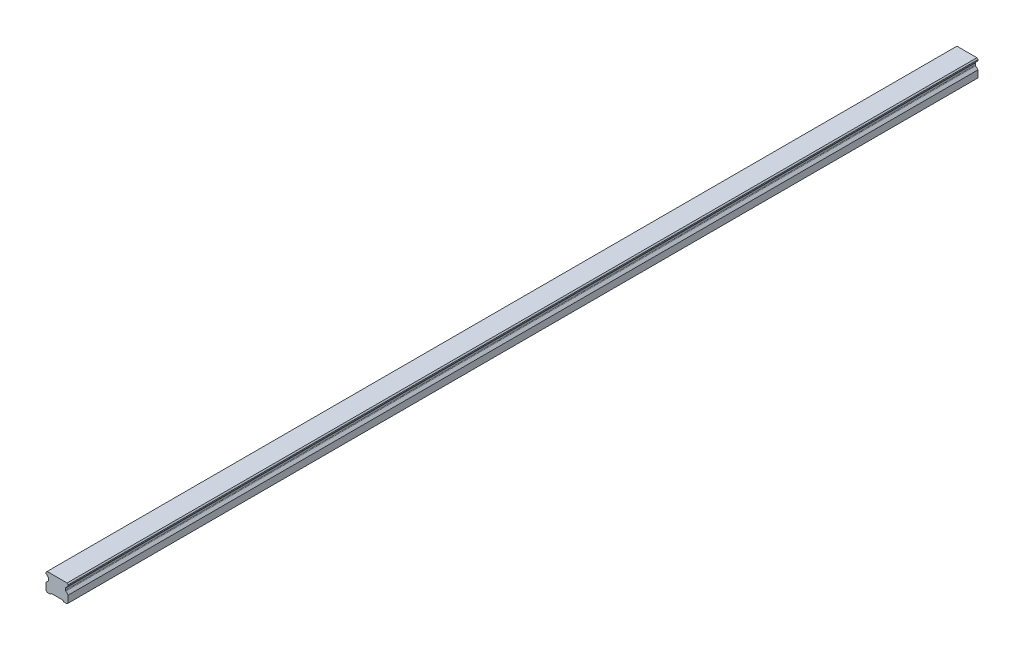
ISO-10303-21;
HEADER;
FILE_DESCRIPTION(('STEP AP214'),'2;1');
FILE_NAME('part.step','',(''),(''),'','','');
FILE_SCHEMA(('AUTOMOTIVE_DESIGN { 1 0 10303 214 1 1 1 1 }'));
ENDSEC;
DATA;
#1=APPLICATION_CONTEXT('core data for automotive mechanical design processes');
#2=APPLICATION_PROTOCOL_DEFINITION('international standard','automotive_design',2000,#1);
#3=PRODUCT_CONTEXT('',#1,'mechanical');
#4=PRODUCT('Part','Part','',(#3));
#5=PRODUCT_RELATED_PRODUCT_CATEGORY('part','',(#4));
#6=PRODUCT_DEFINITION_FORMATION('','',#4);
#7=PRODUCT_DEFINITION_CONTEXT('part definition',#1,'design');
#8=PRODUCT_DEFINITION('design','',#6,#7);
#9=PRODUCT_DEFINITION_SHAPE('','',#8);
#10=(LENGTH_UNIT() NAMED_UNIT(*) SI_UNIT(.MILLI.,.METRE.));
#11=(NAMED_UNIT(*) PLANE_ANGLE_UNIT() SI_UNIT($,.RADIAN.));
#12=(NAMED_UNIT(*) SI_UNIT($,.STERADIAN.) SOLID_ANGLE_UNIT());
#13=UNCERTAINTY_MEASURE_WITH_UNIT(LENGTH_MEASURE(1.E-05),#10,'distance_accuracy_value','');
#14=(GEOMETRIC_REPRESENTATION_CONTEXT(3) GLOBAL_UNCERTAINTY_ASSIGNED_CONTEXT((#13)) GLOBAL_UNIT_ASSIGNED_CONTEXT((#10,
#11,#12)) REPRESENTATION_CONTEXT('',''));
#15=CARTESIAN_POINT('',(0.,0.,0.));
#16=DIRECTION('',(0.,0.,1.));
#17=DIRECTION('',(1.,0.,0.));
#18=AXIS2_PLACEMENT_3D('',#15,#16,#17);
#19=CARTESIAN_POINT('',(0.,11.0000000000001,-390.));
#20=DIRECTION('',(0.,-1.,0.));
#21=DIRECTION('',(0.,0.,-1.));
#22=AXIS2_PLACEMENT_3D('',#19,#20,#21);
#23=PLANE('',#22);
#24=CARTESIAN_POINT('',(0.,11.0000000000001,-390.));
#25=DIRECTION('',(0.,-1.,0.));
#26=DIRECTION('',(0.,0.,-1.));
#27=AXIS2_PLACEMENT_3D('',#24,#25,#26);
#28=CIRCLE('',#27,2.5);
#29=CARTESIAN_POINT('',(0.,11.0000000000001,-392.5));
#30=VERTEX_POINT('',#29);
#31=EDGE_CURVE('E42',#30,#30,#28,.T.);
#32=ORIENTED_EDGE('',*,*,#31,.F.);
#33=EDGE_LOOP('',(#32));
#34=FACE_BOUND('',#33,.T.);
#35=CARTESIAN_POINT('',(0.,11.0000000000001,-390.));
#36=DIRECTION('',(0.,-1.,0.));
#37=DIRECTION('',(0.,0.,-1.));
#38=AXIS2_PLACEMENT_3D('',#35,#36,#37);
#39=CIRCLE('',#38,3.);
#40=CARTESIAN_POINT('',(0.,11.0000000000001,-393.));
#41=VERTEX_POINT('',#40);
#42=EDGE_CURVE('E11',#41,#41,#39,.T.);
#43=ORIENTED_EDGE('',*,*,#42,.T.);
#44=EDGE_LOOP('',(#43));
#45=FACE_BOUND('',#44,.T.);
#46=ADVANCED_FACE('F39',(#34,#45),#23,.T.);
#47=CARTESIAN_POINT('',(0.,11.0000000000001,-390.));
#48=DIRECTION('',(0.,-1.,0.));
#49=DIRECTION('',(0.,0.,-1.));
#50=AXIS2_PLACEMENT_3D('',#47,#48,#49);
#51=CYLINDRICAL_SURFACE('',#50,3.);
#52=ORIENTED_EDGE('',*,*,#42,.F.);
#53=EDGE_LOOP('',(#52));
#54=FACE_BOUND('',#53,.T.);
#55=CARTESIAN_POINT('',(0.,1.00000000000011,-390.));
#56=DIRECTION('',(0.,-1.,0.));
#57=DIRECTION('',(0.,0.,-1.));
#58=AXIS2_PLACEMENT_3D('',#55,#56,#57);
#59=CIRCLE('',#58,3.);
#60=CARTESIAN_POINT('',(0.,1.00000000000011,-393.));
#61=VERTEX_POINT('',#60);
#62=EDGE_CURVE('E48',#61,#61,#59,.T.);
#63=ORIENTED_EDGE('',*,*,#62,.T.);
#64=EDGE_LOOP('',(#63));
#65=FACE_BOUND('',#64,.T.);
#66=ADVANCED_FACE('F709',(#54,#65),#51,.F.);
#67=CARTESIAN_POINT('',(0.,11.0000000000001,-330.));
#68=DIRECTION('',(0.,-1.,0.));
#69=DIRECTION('',(0.,0.,-1.));
#70=AXIS2_PLACEMENT_3D('',#67,#68,#69);
#71=PLANE('',#70);
#72=CARTESIAN_POINT('',(0.,11.0000000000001,-330.));
#73=DIRECTION('',(0.,-1.,0.));
#74=DIRECTION('',(0.,0.,-1.));
#75=AXIS2_PLACEMENT_3D('',#72,#73,#74);
#76=CIRCLE('',#75,2.5);
#77=CARTESIAN_POINT('',(0.,11.0000000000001,-332.5));
#78=VERTEX_POINT('',#77);
#79=EDGE_CURVE('E695',#78,#78,#76,.T.);
#80=ORIENTED_EDGE('',*,*,#79,.F.);
#81=EDGE_LOOP('',(#80));
#82=FACE_BOUND('',#81,.T.);
#83=CARTESIAN_POINT('',(0.,11.0000000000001,-330.));
#84=DIRECTION('',(0.,-1.,0.));
#85=DIRECTION('',(0.,0.,-1.));
#86=AXIS2_PLACEMENT_3D('',#83,#84,#85);
#87=CIRCLE('',#86,3.);
#88=CARTESIAN_POINT('',(0.,11.0000000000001,-333.));
#89=VERTEX_POINT('',#88);
#90=EDGE_CURVE('E650',#89,#89,#87,.T.);
#91=ORIENTED_EDGE('',*,*,#90,.T.);
#92=EDGE_LOOP('',(#91));
#93=FACE_BOUND('',#92,.T.);
#94=ADVANCED_FACE('F714',(#82,#93),#71,.T.);
#95=CARTESIAN_POINT('',(0.,11.0000000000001,-330.));
#96=DIRECTION('',(0.,-1.,0.));
#97=DIRECTION('',(0.,0.,-1.));
#98=AXIS2_PLACEMENT_3D('',#95,#96,#97);
#99=CYLINDRICAL_SURFACE('',#98,3.);
#100=ORIENTED_EDGE('',*,*,#90,.F.);
#101=EDGE_LOOP('',(#100));
#102=FACE_BOUND('',#101,.T.);
#103=CARTESIAN_POINT('',(0.,1.00000000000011,-330.));
#104=DIRECTION('',(0.,-1.,0.));
#105=DIRECTION('',(0.,0.,-1.));
#106=AXIS2_PLACEMENT_3D('',#103,#104,#105);
#107=CIRCLE('',#106,3.);
#108=CARTESIAN_POINT('',(0.,1.00000000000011,-333.));
#109=VERTEX_POINT('',#108);
#110=EDGE_CURVE('E646',#109,#109,#107,.T.);
#111=ORIENTED_EDGE('',*,*,#110,.T.);
#112=EDGE_LOOP('',(#111));
#113=FACE_BOUND('',#112,.T.);
#114=ADVANCED_FACE('F897',(#102,#113),#99,.F.);
#115=CARTESIAN_POINT('',(0.,11.0000000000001,-270.));
#116=DIRECTION('',(0.,-1.,0.));
#117=DIRECTION('',(0.,0.,-1.));
#118=AXIS2_PLACEMENT_3D('',#115,#116,#117);
#119=PLANE('',#118);
#120=CARTESIAN_POINT('',(0.,11.0000000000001,-270.));
#121=DIRECTION('',(0.,-1.,0.));
#122=DIRECTION('',(0.,0.,-1.));
#123=AXIS2_PLACEMENT_3D('',#120,#121,#122);
#124=CIRCLE('',#123,2.5);
#125=CARTESIAN_POINT('',(0.,11.0000000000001,-272.5));
#126=VERTEX_POINT('',#125);
#127=EDGE_CURVE('E692',#126,#126,#124,.T.);
#128=ORIENTED_EDGE('',*,*,#127,.F.);
#129=EDGE_LOOP('',(#128));
#130=FACE_BOUND('',#129,.T.);
#131=CARTESIAN_POINT('',(0.,11.0000000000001,-270.));
#132=DIRECTION('',(0.,-1.,0.));
#133=DIRECTION('',(0.,0.,-1.));
#134=AXIS2_PLACEMENT_3D('',#131,#132,#133);
#135=CIRCLE('',#134,3.);
#136=CARTESIAN_POINT('',(0.,11.0000000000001,-273.));
#137=VERTEX_POINT('',#136);
#138=EDGE_CURVE('E642',#137,#137,#135,.T.);
#139=ORIENTED_EDGE('',*,*,#138,.T.);
#140=EDGE_LOOP('',(#139));
#141=FACE_BOUND('',#140,.T.);
#142=ADVANCED_FACE('F893',(#130,#141),#119,.T.);
#143=CARTESIAN_POINT('',(0.,11.0000000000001,-270.));
#144=DIRECTION('',(0.,-1.,0.));
#145=DIRECTION('',(0.,0.,-1.));
#146=AXIS2_PLACEMENT_3D('',#143,#144,#145);
#147=CYLINDRICAL_SURFACE('',#146,3.);
#148=ORIENTED_EDGE('',*,*,#138,.F.);
#149=EDGE_LOOP('',(#148));
#150=FACE_BOUND('',#149,.T.);
#151=CARTESIAN_POINT('',(0.,1.00000000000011,-270.));
#152=DIRECTION('',(0.,-1.,0.));
#153=DIRECTION('',(0.,0.,-1.));
#154=AXIS2_PLACEMENT_3D('',#151,#152,#153);
#155=CIRCLE('',#154,3.);
#156=CARTESIAN_POINT('',(0.,1.00000000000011,-273.));
#157=VERTEX_POINT('',#156);
#158=EDGE_CURVE('E638',#157,#157,#155,.T.);
#159=ORIENTED_EDGE('',*,*,#158,.T.);
#160=EDGE_LOOP('',(#159));
#161=FACE_BOUND('',#160,.T.);
#162=ADVANCED_FACE('F889',(#150,#161),#147,.F.);
#163=CARTESIAN_POINT('',(0.,11.0000000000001,-210.));
#164=DIRECTION('',(0.,-1.,0.));
#165=DIRECTION('',(0.,0.,-1.));
#166=AXIS2_PLACEMENT_3D('',#163,#164,#165);
#167=PLANE('',#166);
#168=CARTESIAN_POINT('',(0.,11.0000000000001,-210.));
#169=DIRECTION('',(0.,-1.,0.));
#170=DIRECTION('',(0.,0.,-1.));
#171=AXIS2_PLACEMENT_3D('',#168,#169,#170);
#172=CIRCLE('',#171,2.5);
#173=CARTESIAN_POINT('',(0.,11.0000000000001,-212.5));
#174=VERTEX_POINT('',#173);
#175=EDGE_CURVE('E688',#174,#174,#172,.T.);
#176=ORIENTED_EDGE('',*,*,#175,.F.);
#177=EDGE_LOOP('',(#176));
#178=FACE_BOUND('',#177,.T.);
#179=CARTESIAN_POINT('',(0.,11.0000000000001,-210.));
#180=DIRECTION('',(0.,-1.,0.));
#181=DIRECTION('',(0.,0.,-1.));
#182=AXIS2_PLACEMENT_3D('',#179,#180,#181);
#183=CIRCLE('',#182,3.);
#184=CARTESIAN_POINT('',(0.,11.0000000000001,-213.));
#185=VERTEX_POINT('',#184);
#186=EDGE_CURVE('E634',#185,#185,#183,.T.);
#187=ORIENTED_EDGE('',*,*,#186,.T.);
#188=EDGE_LOOP('',(#187));
#189=FACE_BOUND('',#188,.T.);
#190=ADVANCED_FACE('F885',(#178,#189),#167,.T.);
#191=CARTESIAN_POINT('',(0.,11.0000000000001,-210.));
#192=DIRECTION('',(0.,-1.,0.));
#193=DIRECTION('',(0.,0.,-1.));
#194=AXIS2_PLACEMENT_3D('',#191,#192,#193);
#195=CYLINDRICAL_SURFACE('',#194,3.);
#196=ORIENTED_EDGE('',*,*,#186,.F.);
#197=EDGE_LOOP('',(#196));
#198=FACE_BOUND('',#197,.T.);
#199=CARTESIAN_POINT('',(0.,1.00000000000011,-210.));
#200=DIRECTION('',(0.,-1.,0.));
#201=DIRECTION('',(0.,0.,-1.));
#202=AXIS2_PLACEMENT_3D('',#199,#200,#201);
#203=CIRCLE('',#202,3.);
#204=CARTESIAN_POINT('',(0.,1.00000000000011,-213.));
#205=VERTEX_POINT('',#204);
#206=EDGE_CURVE('E630',#205,#205,#203,.T.);
#207=ORIENTED_EDGE('',*,*,#206,.T.);
#208=EDGE_LOOP('',(#207));
#209=FACE_BOUND('',#208,.T.);
#210=ADVANCED_FACE('F881',(#198,#209),#195,.F.);
#211=CARTESIAN_POINT('',(0.,11.0000000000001,-150.));
#212=DIRECTION('',(0.,-1.,0.));
#213=DIRECTION('',(0.,0.,-1.));
#214=AXIS2_PLACEMENT_3D('',#211,#212,#213);
#215=PLANE('',#214);
#216=CARTESIAN_POINT('',(0.,11.0000000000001,-150.));
#217=DIRECTION('',(0.,-1.,0.));
#218=DIRECTION('',(0.,0.,-1.));
#219=AXIS2_PLACEMENT_3D('',#216,#217,#218);
#220=CIRCLE('',#219,2.5);
#221=CARTESIAN_POINT('',(0.,11.0000000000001,-152.5));
#222=VERTEX_POINT('',#221);
#223=EDGE_CURVE('E684',#222,#222,#220,.T.);
#224=ORIENTED_EDGE('',*,*,#223,.F.);
#225=EDGE_LOOP('',(#224));
#226=FACE_BOUND('',#225,.T.);
#227=CARTESIAN_POINT('',(0.,11.0000000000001,-150.));
#228=DIRECTION('',(0.,-1.,0.));
#229=DIRECTION('',(0.,0.,-1.));
#230=AXIS2_PLACEMENT_3D('',#227,#228,#229);
#231=CIRCLE('',#230,3.);
#232=CARTESIAN_POINT('',(0.,11.0000000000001,-153.));
#233=VERTEX_POINT('',#232);
#234=EDGE_CURVE('E627',#233,#233,#231,.T.);
#235=ORIENTED_EDGE('',*,*,#234,.T.);
#236=EDGE_LOOP('',(#235));
#237=FACE_BOUND('',#236,.T.);
#238=ADVANCED_FACE('F877',(#226,#237),#215,.T.);
#239=CARTESIAN_POINT('',(0.,11.0000000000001,-150.));
#240=DIRECTION('',(0.,-1.,0.));
#241=DIRECTION('',(0.,0.,-1.));
#242=AXIS2_PLACEMENT_3D('',#239,#240,#241);
#243=CYLINDRICAL_SURFACE('',#242,3.);
#244=ORIENTED_EDGE('',*,*,#234,.F.);
#245=EDGE_LOOP('',(#244));
#246=FACE_BOUND('',#245,.T.);
#247=CARTESIAN_POINT('',(0.,1.00000000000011,-150.));
#248=DIRECTION('',(0.,-1.,0.));
#249=DIRECTION('',(0.,0.,-1.));
#250=AXIS2_PLACEMENT_3D('',#247,#248,#249);
#251=CIRCLE('',#250,3.);
#252=CARTESIAN_POINT('',(0.,1.00000000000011,-153.));
#253=VERTEX_POINT('',#252);
#254=EDGE_CURVE('E623',#253,#253,#251,.T.);
#255=ORIENTED_EDGE('',*,*,#254,.T.);
#256=EDGE_LOOP('',(#255));
#257=FACE_BOUND('',#256,.T.);
#258=ADVANCED_FACE('F873',(#246,#257),#243,.F.);
#259=CARTESIAN_POINT('',(0.,11.0000000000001,-90.));
#260=DIRECTION('',(0.,-1.,0.));
#261=DIRECTION('',(0.,0.,-1.));
#262=AXIS2_PLACEMENT_3D('',#259,#260,#261);
#263=PLANE('',#262);
#264=CARTESIAN_POINT('',(0.,11.0000000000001,-90.));
#265=DIRECTION('',(0.,-1.,0.));
#266=DIRECTION('',(0.,0.,-1.));
#267=AXIS2_PLACEMENT_3D('',#264,#265,#266);
#268=CIRCLE('',#267,2.5);
#269=CARTESIAN_POINT('',(0.,11.0000000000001,-92.5));
#270=VERTEX_POINT('',#269);
#271=EDGE_CURVE('E680',#270,#270,#268,.T.);
#272=ORIENTED_EDGE('',*,*,#271,.F.);
#273=EDGE_LOOP('',(#272));
#274=FACE_BOUND('',#273,.T.);
#275=CARTESIAN_POINT('',(0.,11.0000000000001,-90.));
#276=DIRECTION('',(0.,-1.,0.));
#277=DIRECTION('',(0.,0.,-1.));
#278=AXIS2_PLACEMENT_3D('',#275,#276,#277);
#279=CIRCLE('',#278,3.);
#280=CARTESIAN_POINT('',(0.,11.0000000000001,-93.));
#281=VERTEX_POINT('',#280);
#282=EDGE_CURVE('E619',#281,#281,#279,.T.);
#283=ORIENTED_EDGE('',*,*,#282,.T.);
#284=EDGE_LOOP('',(#283));
#285=FACE_BOUND('',#284,.T.);
#286=ADVANCED_FACE('F869',(#274,#285),#263,.T.);
#287=CARTESIAN_POINT('',(0.,11.0000000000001,-90.));
#288=DIRECTION('',(0.,-1.,0.));
#289=DIRECTION('',(0.,0.,-1.));
#290=AXIS2_PLACEMENT_3D('',#287,#288,#289);
#291=CYLINDRICAL_SURFACE('',#290,3.);
#292=ORIENTED_EDGE('',*,*,#282,.F.);
#293=EDGE_LOOP('',(#292));
#294=FACE_BOUND('',#293,.T.);
#295=CARTESIAN_POINT('',(0.,1.00000000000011,-90.));
#296=DIRECTION('',(0.,-1.,0.));
#297=DIRECTION('',(0.,0.,-1.));
#298=AXIS2_PLACEMENT_3D('',#295,#296,#297);
#299=CIRCLE('',#298,3.);
#300=CARTESIAN_POINT('',(0.,1.00000000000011,-93.));
#301=VERTEX_POINT('',#300);
#302=EDGE_CURVE('E615',#301,#301,#299,.T.);
#303=ORIENTED_EDGE('',*,*,#302,.T.);
#304=EDGE_LOOP('',(#303));
#305=FACE_BOUND('',#304,.T.);
#306=ADVANCED_FACE('F865',(#294,#305),#291,.F.);
#307=CARTESIAN_POINT('',(0.,11.0000000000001,-30.));
#308=DIRECTION('',(0.,-1.,0.));
#309=DIRECTION('',(0.,0.,-1.));
#310=AXIS2_PLACEMENT_3D('',#307,#308,#309);
#311=PLANE('',#310);
#312=CARTESIAN_POINT('',(0.,11.0000000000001,-30.));
#313=DIRECTION('',(0.,-1.,0.));
#314=DIRECTION('',(0.,0.,-1.));
#315=AXIS2_PLACEMENT_3D('',#312,#313,#314);
#316=CIRCLE('',#315,2.5);
#317=CARTESIAN_POINT('',(0.,11.0000000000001,-32.5));
#318=VERTEX_POINT('',#317);
#319=EDGE_CURVE('E676',#318,#318,#316,.T.);
#320=ORIENTED_EDGE('',*,*,#319,.F.);
#321=EDGE_LOOP('',(#320));
#322=FACE_BOUND('',#321,.T.);
#323=CARTESIAN_POINT('',(0.,11.0000000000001,-30.));
#324=DIRECTION('',(0.,-1.,0.));
#325=DIRECTION('',(0.,0.,-1.));
#326=AXIS2_PLACEMENT_3D('',#323,#324,#325);
#327=CIRCLE('',#326,3.);
#328=CARTESIAN_POINT('',(0.,11.0000000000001,-33.));
#329=VERTEX_POINT('',#328);
#330=EDGE_CURVE('E611',#329,#329,#327,.T.);
#331=ORIENTED_EDGE('',*,*,#330,.T.);
#332=EDGE_LOOP('',(#331));
#333=FACE_BOUND('',#332,.T.);
#334=ADVANCED_FACE('F861',(#322,#333),#311,.T.);
#335=CARTESIAN_POINT('',(0.,11.0000000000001,-30.));
#336=DIRECTION('',(0.,-1.,0.));
#337=DIRECTION('',(0.,0.,-1.));
#338=AXIS2_PLACEMENT_3D('',#335,#336,#337);
#339=CYLINDRICAL_SURFACE('',#338,3.);
#340=ORIENTED_EDGE('',*,*,#330,.F.);
#341=EDGE_LOOP('',(#340));
#342=FACE_BOUND('',#341,.T.);
#343=CARTESIAN_POINT('',(0.,1.00000000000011,-30.));
#344=DIRECTION('',(0.,-1.,0.));
#345=DIRECTION('',(0.,0.,-1.));
#346=AXIS2_PLACEMENT_3D('',#343,#344,#345);
#347=CIRCLE('',#346,3.);
#348=CARTESIAN_POINT('',(0.,1.00000000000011,-33.));
#349=VERTEX_POINT('',#348);
#350=EDGE_CURVE('E607',#349,#349,#347,.T.);
#351=ORIENTED_EDGE('',*,*,#350,.T.);
#352=EDGE_LOOP('',(#351));
#353=FACE_BOUND('',#352,.T.);
#354=ADVANCED_FACE('F857',(#342,#353),#339,.F.);
#355=CARTESIAN_POINT('',(0.,11.0000000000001,30.));
#356=DIRECTION('',(0.,-1.,0.));
#357=DIRECTION('',(0.,0.,-1.));
#358=AXIS2_PLACEMENT_3D('',#355,#356,#357);
#359=PLANE('',#358);
#360=CARTESIAN_POINT('',(0.,11.0000000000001,30.));
#361=DIRECTION('',(0.,-1.,0.));
#362=DIRECTION('',(0.,0.,-1.));
#363=AXIS2_PLACEMENT_3D('',#360,#361,#362);
#364=CIRCLE('',#363,2.5);
#365=CARTESIAN_POINT('',(0.,11.0000000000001,27.5));
#366=VERTEX_POINT('',#365);
#367=EDGE_CURVE('E672',#366,#366,#364,.T.);
#368=ORIENTED_EDGE('',*,*,#367,.F.);
#369=EDGE_LOOP('',(#368));
#370=FACE_BOUND('',#369,.T.);
#371=CARTESIAN_POINT('',(0.,11.0000000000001,30.));
#372=DIRECTION('',(0.,-1.,0.));
#373=DIRECTION('',(0.,0.,-1.));
#374=AXIS2_PLACEMENT_3D('',#371,#372,#373);
#375=CIRCLE('',#374,3.);
#376=CARTESIAN_POINT('',(0.,11.0000000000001,27.));
#377=VERTEX_POINT('',#376);
#378=EDGE_CURVE('E603',#377,#377,#375,.T.);
#379=ORIENTED_EDGE('',*,*,#378,.T.);
#380=EDGE_LOOP('',(#379));
#381=FACE_BOUND('',#380,.T.);
#382=ADVANCED_FACE('F853',(#370,#381),#359,.T.);
#383=CARTESIAN_POINT('',(0.,11.0000000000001,30.));
#384=DIRECTION('',(0.,-1.,0.));
#385=DIRECTION('',(0.,0.,-1.));
#386=AXIS2_PLACEMENT_3D('',#383,#384,#385);
#387=CYLINDRICAL_SURFACE('',#386,3.);
#388=ORIENTED_EDGE('',*,*,#378,.F.);
#389=EDGE_LOOP('',(#388));
#390=FACE_BOUND('',#389,.T.);
#391=CARTESIAN_POINT('',(0.,1.00000000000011,30.));
#392=DIRECTION('',(0.,-1.,0.));
#393=DIRECTION('',(0.,0.,-1.));
#394=AXIS2_PLACEMENT_3D('',#391,#392,#393);
#395=CIRCLE('',#394,3.);
#396=CARTESIAN_POINT('',(0.,1.00000000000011,27.));
#397=VERTEX_POINT('',#396);
#398=EDGE_CURVE('E599',#397,#397,#395,.T.);
#399=ORIENTED_EDGE('',*,*,#398,.T.);
#400=EDGE_LOOP('',(#399));
#401=FACE_BOUND('',#400,.T.);
#402=ADVANCED_FACE('F849',(#390,#401),#387,.F.);
#403=CARTESIAN_POINT('',(0.,11.0000000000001,90.));
#404=DIRECTION('',(0.,-1.,0.));
#405=DIRECTION('',(0.,0.,-1.));
#406=AXIS2_PLACEMENT_3D('',#403,#404,#405);
#407=PLANE('',#406);
#408=CARTESIAN_POINT('',(0.,11.0000000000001,90.));
#409=DIRECTION('',(0.,-1.,0.));
#410=DIRECTION('',(0.,0.,-1.));
#411=AXIS2_PLACEMENT_3D('',#408,#409,#410);
#412=CIRCLE('',#411,2.5);
#413=CARTESIAN_POINT('',(0.,11.0000000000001,87.5));
#414=VERTEX_POINT('',#413);
#415=EDGE_CURVE('E668',#414,#414,#412,.T.);
#416=ORIENTED_EDGE('',*,*,#415,.F.);
#417=EDGE_LOOP('',(#416));
#418=FACE_BOUND('',#417,.T.);
#419=CARTESIAN_POINT('',(0.,11.0000000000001,90.));
#420=DIRECTION('',(0.,-1.,0.));
#421=DIRECTION('',(0.,0.,-1.));
#422=AXIS2_PLACEMENT_3D('',#419,#420,#421);
#423=CIRCLE('',#422,3.);
#424=CARTESIAN_POINT('',(0.,11.0000000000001,87.));
#425=VERTEX_POINT('',#424);
#426=EDGE_CURVE('E595',#425,#425,#423,.T.);
#427=ORIENTED_EDGE('',*,*,#426,.T.);
#428=EDGE_LOOP('',(#427));
#429=FACE_BOUND('',#428,.T.);
#430=ADVANCED_FACE('F845',(#418,#429),#407,.T.);
#431=CARTESIAN_POINT('',(0.,11.0000000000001,90.));
#432=DIRECTION('',(0.,-1.,0.));
#433=DIRECTION('',(0.,0.,-1.));
#434=AXIS2_PLACEMENT_3D('',#431,#432,#433);
#435=CYLINDRICAL_SURFACE('',#434,3.);
#436=ORIENTED_EDGE('',*,*,#426,.F.);
#437=EDGE_LOOP('',(#436));
#438=FACE_BOUND('',#437,.T.);
#439=CARTESIAN_POINT('',(0.,1.00000000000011,90.));
#440=DIRECTION('',(0.,-1.,0.));
#441=DIRECTION('',(0.,0.,-1.));
#442=AXIS2_PLACEMENT_3D('',#439,#440,#441);
#443=CIRCLE('',#442,3.);
#444=CARTESIAN_POINT('',(0.,1.00000000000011,87.));
#445=VERTEX_POINT('',#444);
#446=EDGE_CURVE('E591',#445,#445,#443,.T.);
#447=ORIENTED_EDGE('',*,*,#446,.T.);
#448=EDGE_LOOP('',(#447));
#449=FACE_BOUND('',#448,.T.);
#450=ADVANCED_FACE('F841',(#438,#449),#435,.F.);
#451=CARTESIAN_POINT('',(0.,11.0000000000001,150.));
#452=DIRECTION('',(0.,-1.,0.));
#453=DIRECTION('',(0.,0.,-1.));
#454=AXIS2_PLACEMENT_3D('',#451,#452,#453);
#455=PLANE('',#454);
#456=CARTESIAN_POINT('',(0.,11.0000000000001,150.));
#457=DIRECTION('',(0.,-1.,0.));
#458=DIRECTION('',(0.,0.,-1.));
#459=AXIS2_PLACEMENT_3D('',#456,#457,#458);
#460=CIRCLE('',#459,2.5);
#461=CARTESIAN_POINT('',(0.,11.0000000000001,147.5));
#462=VERTEX_POINT('',#461);
#463=EDGE_CURVE('E664',#462,#462,#460,.T.);
#464=ORIENTED_EDGE('',*,*,#463,.F.);
#465=EDGE_LOOP('',(#464));
#466=FACE_BOUND('',#465,.T.);
#467=CARTESIAN_POINT('',(0.,11.0000000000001,150.));
#468=DIRECTION('',(0.,-1.,0.));
#469=DIRECTION('',(0.,0.,-1.));
#470=AXIS2_PLACEMENT_3D('',#467,#468,#469);
#471=CIRCLE('',#470,3.);
#472=CARTESIAN_POINT('',(0.,11.0000000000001,147.));
#473=VERTEX_POINT('',#472);
#474=EDGE_CURVE('E587',#473,#473,#471,.T.);
#475=ORIENTED_EDGE('',*,*,#474,.T.);
#476=EDGE_LOOP('',(#475));
#477=FACE_BOUND('',#476,.T.);
#478=ADVANCED_FACE('F837',(#466,#477),#455,.T.);
#479=CARTESIAN_POINT('',(0.,11.0000000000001,150.));
#480=DIRECTION('',(0.,-1.,0.));
#481=DIRECTION('',(0.,0.,-1.));
#482=AXIS2_PLACEMENT_3D('',#479,#480,#481);
#483=CYLINDRICAL_SURFACE('',#482,3.);
#484=ORIENTED_EDGE('',*,*,#474,.F.);
#485=EDGE_LOOP('',(#484));
#486=FACE_BOUND('',#485,.T.);
#487=CARTESIAN_POINT('',(0.,1.00000000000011,150.));
#488=DIRECTION('',(0.,-1.,0.));
#489=DIRECTION('',(0.,0.,-1.));
#490=AXIS2_PLACEMENT_3D('',#487,#488,#489);
#491=CIRCLE('',#490,3.);
#492=CARTESIAN_POINT('',(0.,1.00000000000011,147.));
#493=VERTEX_POINT('',#492);
#494=EDGE_CURVE('E583',#493,#493,#491,.T.);
#495=ORIENTED_EDGE('',*,*,#494,.T.);
#496=EDGE_LOOP('',(#495));
#497=FACE_BOUND('',#496,.T.);
#498=ADVANCED_FACE('F833',(#486,#497),#483,.F.);
#499=CARTESIAN_POINT('',(0.,11.0000000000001,210.));
#500=DIRECTION('',(0.,-1.,0.));
#501=DIRECTION('',(0.,0.,-1.));
#502=AXIS2_PLACEMENT_3D('',#499,#500,#501);
#503=PLANE('',#502);
#504=CARTESIAN_POINT('',(0.,11.0000000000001,210.));
#505=DIRECTION('',(0.,-1.,0.));
#506=DIRECTION('',(0.,0.,-1.));
#507=AXIS2_PLACEMENT_3D('',#504,#505,#506);
#508=CIRCLE('',#507,2.5);
#509=CARTESIAN_POINT('',(0.,11.0000000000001,207.5));
#510=VERTEX_POINT('',#509);
#511=EDGE_CURVE('E660',#510,#510,#508,.T.);
#512=ORIENTED_EDGE('',*,*,#511,.F.);
#513=EDGE_LOOP('',(#512));
#514=FACE_BOUND('',#513,.T.);
#515=CARTESIAN_POINT('',(0.,11.0000000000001,210.));
#516=DIRECTION('',(0.,-1.,0.));
#517=DIRECTION('',(0.,0.,-1.));
#518=AXIS2_PLACEMENT_3D('',#515,#516,#517);
#519=CIRCLE('',#518,3.);
#520=CARTESIAN_POINT('',(0.,11.0000000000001,207.));
#521=VERTEX_POINT('',#520);
#522=EDGE_CURVE('E579',#521,#521,#519,.T.);
#523=ORIENTED_EDGE('',*,*,#522,.T.);
#524=EDGE_LOOP('',(#523));
#525=FACE_BOUND('',#524,.T.);
#526=ADVANCED_FACE('F829',(#514,#525),#503,.T.);
#527=CARTESIAN_POINT('',(0.,11.0000000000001,210.));
#528=DIRECTION('',(0.,-1.,0.));
#529=DIRECTION('',(0.,0.,-1.));
#530=AXIS2_PLACEMENT_3D('',#527,#528,#529);
#531=CYLINDRICAL_SURFACE('',#530,3.);
#532=ORIENTED_EDGE('',*,*,#522,.F.);
#533=EDGE_LOOP('',(#532));
#534=FACE_BOUND('',#533,.T.);
#535=CARTESIAN_POINT('',(0.,1.00000000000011,210.));
#536=DIRECTION('',(0.,-1.,0.));
#537=DIRECTION('',(0.,0.,-1.));
#538=AXIS2_PLACEMENT_3D('',#535,#536,#537);
#539=CIRCLE('',#538,3.);
#540=CARTESIAN_POINT('',(0.,1.00000000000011,207.));
#541=VERTEX_POINT('',#540);
#542=EDGE_CURVE('E575',#541,#541,#539,.T.);
#543=ORIENTED_EDGE('',*,*,#542,.T.);
#544=EDGE_LOOP('',(#543));
#545=FACE_BOUND('',#544,.T.);
#546=ADVANCED_FACE('F825',(#534,#545),#531,.F.);
#547=CARTESIAN_POINT('',(0.,11.0000000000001,270.));
#548=DIRECTION('',(0.,-1.,0.));
#549=DIRECTION('',(0.,0.,-1.));
#550=AXIS2_PLACEMENT_3D('',#547,#548,#549);
#551=PLANE('',#550);
#552=CARTESIAN_POINT('',(0.,11.0000000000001,270.));
#553=DIRECTION('',(0.,-1.,0.));
#554=DIRECTION('',(0.,0.,-1.));
#555=AXIS2_PLACEMENT_3D('',#552,#553,#554);
#556=CIRCLE('',#555,2.5);
#557=CARTESIAN_POINT('',(0.,11.0000000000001,267.5));
#558=VERTEX_POINT('',#557);
#559=EDGE_CURVE('E260',#558,#558,#556,.T.);
#560=ORIENTED_EDGE('',*,*,#559,.F.);
#561=EDGE_LOOP('',(#560));
#562=FACE_BOUND('',#561,.T.);
#563=CARTESIAN_POINT('',(0.,11.0000000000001,270.));
#564=DIRECTION('',(0.,-1.,0.));
#565=DIRECTION('',(0.,0.,-1.));
#566=AXIS2_PLACEMENT_3D('',#563,#564,#565);
#567=CIRCLE('',#566,3.);
#568=CARTESIAN_POINT('',(0.,11.0000000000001,267.));
#569=VERTEX_POINT('',#568);
#570=EDGE_CURVE('E571',#569,#569,#567,.T.);
#571=ORIENTED_EDGE('',*,*,#570,.T.);
#572=EDGE_LOOP('',(#571));
#573=FACE_BOUND('',#572,.T.);
#574=ADVANCED_FACE('F821',(#562,#573),#551,.T.);
#575=CARTESIAN_POINT('',(0.,11.0000000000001,270.));
#576=DIRECTION('',(0.,-1.,0.));
#577=DIRECTION('',(0.,0.,-1.));
#578=AXIS2_PLACEMENT_3D('',#575,#576,#577);
#579=CYLINDRICAL_SURFACE('',#578,3.);
#580=ORIENTED_EDGE('',*,*,#570,.F.);
#581=EDGE_LOOP('',(#580));
#582=FACE_BOUND('',#581,.T.);
#583=CARTESIAN_POINT('',(0.,1.00000000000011,270.));
#584=DIRECTION('',(0.,-1.,0.));
#585=DIRECTION('',(0.,0.,-1.));
#586=AXIS2_PLACEMENT_3D('',#583,#584,#585);
#587=CIRCLE('',#586,3.);
#588=CARTESIAN_POINT('',(0.,1.00000000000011,267.));
#589=VERTEX_POINT('',#588);
#590=EDGE_CURVE('E567',#589,#589,#587,.T.);
#591=ORIENTED_EDGE('',*,*,#590,.T.);
#592=EDGE_LOOP('',(#591));
#593=FACE_BOUND('',#592,.T.);
#594=ADVANCED_FACE('F818',(#582,#593),#579,.F.);
#595=CARTESIAN_POINT('',(10.,0.,410.));
#596=DIRECTION('',(0.,1.,0.));
#597=DIRECTION('',(-1.,0.,0.));
#598=AXIS2_PLACEMENT_3D('',#595,#596,#597);
#599=PLANE('',#598);
#600=DIRECTION('',(1.,0.,0.));
#601=VECTOR('',#600,1.);
#602=CARTESIAN_POINT('',(10.,0.,-410.));
#603=LINE('',#602,#601);
#604=CARTESIAN_POINT('',(-8.99999999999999,0.,-410.));
#605=VERTEX_POINT('',#604);
#606=CARTESIAN_POINT('',(-6.00000000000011,0.,-410.));
#607=VERTEX_POINT('',#606);
#608=EDGE_CURVE('E450',#605,#607,#603,.T.);
#609=ORIENTED_EDGE('',*,*,#608,.T.);
#610=DIRECTION('',(0.,0.,1.));
#611=VECTOR('',#610,1.);
#612=CARTESIAN_POINT('',(-6.00000000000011,0.,-410.));
#613=LINE('',#612,#611);
#614=CARTESIAN_POINT('',(-6.00000000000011,0.,410.));
#615=VERTEX_POINT('',#614);
#616=EDGE_CURVE('E356',#607,#615,#613,.T.);
#617=ORIENTED_EDGE('',*,*,#616,.T.);
#618=DIRECTION('',(1.,0.,0.));
#619=VECTOR('',#618,1.);
#620=CARTESIAN_POINT('',(10.,0.,410.));
#621=LINE('',#620,#619);
#622=CARTESIAN_POINT('',(-8.99999999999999,0.,410.));
#623=VERTEX_POINT('',#622);
#624=EDGE_CURVE('E431',#623,#615,#621,.T.);
#625=ORIENTED_EDGE('',*,*,#624,.F.);
#626=DIRECTION('',(0.,0.,-1.));
#627=VECTOR('',#626,1.);
#628=CARTESIAN_POINT('',(-8.99999999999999,0.,410.));
#629=LINE('',#628,#627);
#630=EDGE_CURVE('E502',#623,#605,#629,.T.);
#631=ORIENTED_EDGE('',*,*,#630,.T.);
#632=EDGE_LOOP('',(#609,#617,#625,#631));
#633=FACE_BOUND('',#632,.T.);
#634=ADVANCED_FACE('F783',(#633),#599,.F.);
#635=CARTESIAN_POINT('',(-10.,16.3,410.));
#636=DIRECTION('',(1.,0.,0.));
#637=DIRECTION('',(0.,1.,0.));
#638=AXIS2_PLACEMENT_3D('',#635,#636,#637);
#639=PLANE('',#638);
#640=DIRECTION('',(0.,-1.,0.));
#641=VECTOR('',#640,1.);
#642=CARTESIAN_POINT('',(-10.,16.3,410.));
#643=LINE('',#642,#641);
#644=CARTESIAN_POINT('',(-10.,15.3000000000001,410.));
#645=VERTEX_POINT('',#644);
#646=CARTESIAN_POINT('',(-10.,14.3,410.));
#647=VERTEX_POINT('',#646);
#648=EDGE_CURVE('E425',#645,#647,#643,.T.);
#649=ORIENTED_EDGE('',*,*,#648,.F.);
#650=DIRECTION('',(0.,0.,-1.));
#651=VECTOR('',#650,1.);
#652=CARTESIAN_POINT('',(-10.,15.3000000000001,410.));
#653=LINE('',#652,#651);
#654=CARTESIAN_POINT('',(-10.,15.3000000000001,-410.));
#655=VERTEX_POINT('',#654);
#656=EDGE_CURVE('E444',#645,#655,#653,.T.);
#657=ORIENTED_EDGE('',*,*,#656,.T.);
#658=DIRECTION('',(0.,-1.,0.));
#659=VECTOR('',#658,1.);
#660=CARTESIAN_POINT('',(-10.,16.3,-410.));
#661=LINE('',#660,#659);
#662=CARTESIAN_POINT('',(-10.,14.3,-410.));
#663=VERTEX_POINT('',#662);
#664=EDGE_CURVE('E445',#655,#663,#661,.T.);
#665=ORIENTED_EDGE('',*,*,#664,.T.);
#666=DIRECTION('',(0.,0.,1.));
#667=VECTOR('',#666,1.);
#668=CARTESIAN_POINT('',(-10.,14.3,-410.));
#669=LINE('',#668,#667);
#670=EDGE_CURVE('E380',#663,#647,#669,.T.);
#671=ORIENTED_EDGE('',*,*,#670,.T.);
#672=EDGE_LOOP('',(#649,#657,#665,#671));
#673=FACE_BOUND('',#672,.T.);
#674=ADVANCED_FACE('F787',(#673),#639,.F.);
#675=CARTESIAN_POINT('',(10.,16.3,410.));
#676=DIRECTION('',(-1.,0.,0.));
#677=DIRECTION('',(0.,-1.,0.));
#678=AXIS2_PLACEMENT_3D('',#675,#676,#677);
#679=PLANE('',#678);
#680=DIRECTION('',(0.,1.,0.));
#681=VECTOR('',#680,1.);
#682=CARTESIAN_POINT('',(10.,16.3,410.));
#683=LINE('',#682,#681);
#684=CARTESIAN_POINT('',(10.,1.00000000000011,410.));
#685=VERTEX_POINT('',#684);
#686=CARTESIAN_POINT('',(10.,7.3,410.));
#687=VERTEX_POINT('',#686);
#688=EDGE_CURVE('E436',#685,#687,#683,.T.);
#689=ORIENTED_EDGE('',*,*,#688,.F.);
#690=DIRECTION('',(0.,0.,-1.));
#691=VECTOR('',#690,1.);
#692=CARTESIAN_POINT('',(10.,1.00000000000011,410.));
#693=LINE('',#692,#691);
#694=CARTESIAN_POINT('',(10.,1.00000000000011,-410.));
#695=VERTEX_POINT('',#694);
#696=EDGE_CURVE('E509',#685,#695,#693,.T.);
#697=ORIENTED_EDGE('',*,*,#696,.T.);
#698=DIRECTION('',(0.,1.,0.));
#699=VECTOR('',#698,1.);
#700=CARTESIAN_POINT('',(10.,16.3,-410.));
#701=LINE('',#700,#699);
#702=CARTESIAN_POINT('',(10.,7.3,-410.));
#703=VERTEX_POINT('',#702);
#704=EDGE_CURVE('E455',#695,#703,#701,.T.);
#705=ORIENTED_EDGE('',*,*,#704,.T.);
#706=DIRECTION('',(0.,0.,1.));
#707=VECTOR('',#706,1.);
#708=CARTESIAN_POINT('',(10.,7.3,-410.));
#709=LINE('',#708,#707);
#710=EDGE_CURVE('E410',#703,#687,#709,.T.);
#711=ORIENTED_EDGE('',*,*,#710,.T.);
#712=EDGE_LOOP('',(#689,#697,#705,#711));
#713=FACE_BOUND('',#712,.T.);
#714=ADVANCED_FACE('F778',(#713),#679,.F.);
#715=CARTESIAN_POINT('',(-10.,7.3,-410.));
#716=VERTEX_POINT('',#715);
#717=CARTESIAN_POINT('',(-10.,0.999999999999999,-410.));
#718=VERTEX_POINT('',#717);
#719=EDGE_CURVE('E395',#716,#718,#661,.T.);
#720=ORIENTED_EDGE('',*,*,#719,.T.);
#721=DIRECTION('',(0.,0.,1.));
#722=VECTOR('',#721,1.);
#723=CARTESIAN_POINT('',(-10.,0.999999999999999,410.));
#724=LINE('',#723,#722);
#725=CARTESIAN_POINT('',(-10.,0.999999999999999,410.));
#726=VERTEX_POINT('',#725);
#727=EDGE_CURVE('E506',#718,#726,#724,.T.);
#728=ORIENTED_EDGE('',*,*,#727,.T.);
#729=CARTESIAN_POINT('',(-10.,7.3,410.));
#730=VERTEX_POINT('',#729);
#731=EDGE_CURVE('E430',#730,#726,#643,.T.);
#732=ORIENTED_EDGE('',*,*,#731,.F.);
#733=DIRECTION('',(0.,0.,1.));
#734=VECTOR('',#733,1.);
#735=CARTESIAN_POINT('',(-10.,7.3,-410.));
#736=LINE('',#735,#734);
#737=EDGE_CURVE('E392',#716,#730,#736,.T.);
#738=ORIENTED_EDGE('',*,*,#737,.F.);
#739=EDGE_LOOP('',(#720,#728,#732,#738));
#740=FACE_BOUND('',#739,.T.);
#741=ADVANCED_FACE('F781',(#740),#639,.F.);
#742=CARTESIAN_POINT('',(6.00000000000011,0.,410.));
#743=VERTEX_POINT('',#742);
#744=CARTESIAN_POINT('',(8.99999999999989,0.,410.));
#745=VERTEX_POINT('',#744);
#746=EDGE_CURVE('E429',#743,#745,#621,.T.);
#747=ORIENTED_EDGE('',*,*,#746,.F.);
#748=DIRECTION('',(0.,0.,1.));
#749=VECTOR('',#748,1.);
#750=CARTESIAN_POINT('',(6.00000000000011,0.,-410.));
#751=LINE('',#750,#749);
#752=CARTESIAN_POINT('',(6.00000000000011,0.,-410.));
#753=VERTEX_POINT('',#752);
#754=EDGE_CURVE('E346',#753,#743,#751,.T.);
#755=ORIENTED_EDGE('',*,*,#754,.F.);
#756=CARTESIAN_POINT('',(8.99999999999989,0.,-410.));
#757=VERTEX_POINT('',#756);
#758=EDGE_CURVE('E449',#753,#757,#603,.T.);
#759=ORIENTED_EDGE('',*,*,#758,.T.);
#760=DIRECTION('',(0.,0.,1.));
#761=VECTOR('',#760,1.);
#762=CARTESIAN_POINT('',(8.99999999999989,0.,410.));
#763=LINE('',#762,#761);
#764=EDGE_CURVE('E498',#757,#745,#763,.T.);
#765=ORIENTED_EDGE('',*,*,#764,.T.);
#766=EDGE_LOOP('',(#747,#755,#759,#765));
#767=FACE_BOUND('',#766,.T.);
#768=ADVANCED_FACE('F776',(#767),#599,.F.);
#769=CARTESIAN_POINT('',(10.,14.3,-410.));
#770=VERTEX_POINT('',#769);
#771=CARTESIAN_POINT('',(10.,15.3,-410.));
#772=VERTEX_POINT('',#771);
#773=EDGE_CURVE('E454',#770,#772,#701,.T.);
#774=ORIENTED_EDGE('',*,*,#773,.T.);
#775=DIRECTION('',(0.,0.,1.));
#776=VECTOR('',#775,1.);
#777=CARTESIAN_POINT('',(10.,15.3,410.));
#778=LINE('',#777,#776);
#779=CARTESIAN_POINT('',(10.,15.3,410.));
#780=VERTEX_POINT('',#779);
#781=EDGE_CURVE('E513',#772,#780,#778,.T.);
#782=ORIENTED_EDGE('',*,*,#781,.T.);
#783=CARTESIAN_POINT('',(10.,14.3,410.));
#784=VERTEX_POINT('',#783);
#785=EDGE_CURVE('E435',#784,#780,#683,.T.);
#786=ORIENTED_EDGE('',*,*,#785,.F.);
#787=DIRECTION('',(0.,0.,1.));
#788=VECTOR('',#787,1.);
#789=CARTESIAN_POINT('',(10.,14.3,-410.));
#790=LINE('',#789,#788);
#791=EDGE_CURVE('E385',#770,#784,#790,.T.);
#792=ORIENTED_EDGE('',*,*,#791,.F.);
#793=EDGE_LOOP('',(#774,#782,#786,#792));
#794=FACE_BOUND('',#793,.T.);
#795=ADVANCED_FACE('F772',(#794),#679,.F.);
#796=CARTESIAN_POINT('',(10.,16.3,410.));
#797=DIRECTION('',(0.,-1.,0.));
#798=DIRECTION('',(0.,0.,-1.));
#799=AXIS2_PLACEMENT_3D('',#796,#797,#798);
#800=PLANE('',#799);
#801=DIRECTION('',(-1.,0.,0.));
#802=VECTOR('',#801,1.);
#803=CARTESIAN_POINT('',(10.,16.3,-410.));
#804=LINE('',#803,#802);
#805=CARTESIAN_POINT('',(9.00000000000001,16.3,-410.));
#806=VERTEX_POINT('',#805);
#807=CARTESIAN_POINT('',(-9.0000000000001,16.3,-410.));
#808=VERTEX_POINT('',#807);
#809=EDGE_CURVE('E459',#806,#808,#804,.T.);
#810=ORIENTED_EDGE('',*,*,#809,.T.);
#811=DIRECTION('',(0.,0.,1.));
#812=VECTOR('',#811,1.);
#813=CARTESIAN_POINT('',(-9.0000000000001,16.3,410.));
#814=LINE('',#813,#812);
#815=CARTESIAN_POINT('',(-9.0000000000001,16.3,410.));
#816=VERTEX_POINT('',#815);
#817=EDGE_CURVE('E483',#808,#816,#814,.T.);
#818=ORIENTED_EDGE('',*,*,#817,.T.);
#819=DIRECTION('',(-1.,0.,0.));
#820=VECTOR('',#819,1.);
#821=CARTESIAN_POINT('',(10.,16.3,410.));
#822=LINE('',#821,#820);
#823=CARTESIAN_POINT('',(9.00000000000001,16.3,410.));
#824=VERTEX_POINT('',#823);
#825=EDGE_CURVE('E440',#824,#816,#822,.T.);
#826=ORIENTED_EDGE('',*,*,#825,.F.);
#827=DIRECTION('',(0.,0.,-1.));
#828=VECTOR('',#827,1.);
#829=CARTESIAN_POINT('',(9.00000000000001,16.3,410.));
#830=LINE('',#829,#828);
#831=EDGE_CURVE('E479',#824,#806,#830,.T.);
#832=ORIENTED_EDGE('',*,*,#831,.T.);
#833=EDGE_LOOP('',(#810,#818,#826,#832));
#834=FACE_BOUND('',#833,.T.);
#835=ADVANCED_FACE('F766',(#834),#800,.F.);
#836=CARTESIAN_POINT('',(0.,0.,410.));
#837=DIRECTION('',(0.,0.,-1.));
#838=DIRECTION('',(-1.,0.,0.));
#839=AXIS2_PLACEMENT_3D('',#836,#837,#838);
#840=PLANE('',#839);
#841=ORIENTED_EDGE('',*,*,#624,.T.);
#842=DIRECTION('',(-0.707106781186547,-0.707106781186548,0.));
#843=VECTOR('',#842,1.);
#844=CARTESIAN_POINT('',(-6.00000000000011,0.,410.));
#845=LINE('',#844,#843);
#846=CARTESIAN_POINT('',(-5.,1.00000000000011,410.));
#847=VERTEX_POINT('',#846);
#848=EDGE_CURVE('E339',#847,#615,#845,.T.);
#849=ORIENTED_EDGE('',*,*,#848,.F.);
#850=DIRECTION('',(-1.,0.,0.));
#851=VECTOR('',#850,1.);
#852=CARTESIAN_POINT('',(-5.,1.00000000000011,410.));
#853=LINE('',#852,#851);
#854=CARTESIAN_POINT('',(5.,1.00000000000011,410.));
#855=VERTEX_POINT('',#854);
#856=EDGE_CURVE('E350',#855,#847,#853,.T.);
#857=ORIENTED_EDGE('',*,*,#856,.F.);
#858=DIRECTION('',(-0.707106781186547,0.707106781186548,0.));
#859=VECTOR('',#858,1.);
#860=CARTESIAN_POINT('',(5.,1.00000000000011,410.));
#861=LINE('',#860,#859);
#862=EDGE_CURVE('E331',#743,#855,#861,.T.);
#863=ORIENTED_EDGE('',*,*,#862,.F.);
#864=ORIENTED_EDGE('',*,*,#746,.T.);
#865=DIRECTION('',(-0.707106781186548,-0.707106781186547,0.));
#866=VECTOR('',#865,1.);
#867=CARTESIAN_POINT('',(10.,1.00000000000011,410.));
#868=LINE('',#867,#866);
#869=EDGE_CURVE('E489',#745,#685,#868,.F.);
#870=ORIENTED_EDGE('',*,*,#869,.T.);
#871=ORIENTED_EDGE('',*,*,#688,.T.);
#872=DIRECTION('',(0.707106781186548,-0.707106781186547,0.));
#873=VECTOR('',#872,1.);
#874=CARTESIAN_POINT('',(10.,7.3,410.));
#875=LINE('',#874,#873);
#876=CARTESIAN_POINT('',(7.95955988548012,9.34044011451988,410.));
#877=VERTEX_POINT('',#876);
#878=EDGE_CURVE('E360',#877,#687,#875,.T.);
#879=ORIENTED_EDGE('',*,*,#878,.F.);
#880=CARTESIAN_POINT('',(8.66666666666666,10.0475468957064,410.));
#881=DIRECTION('',(0.,0.,-1.));
#882=DIRECTION('',(-1.,0.,0.));
#883=AXIS2_PLACEMENT_3D('',#880,#881,#882);
#884=CIRCLE('',#883,1.);
#885=CARTESIAN_POINT('',(7.66666666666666,10.0475468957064,410.));
#886=VERTEX_POINT('',#885);
#887=EDGE_CURVE('E544',#877,#886,#884,.T.);
#888=ORIENTED_EDGE('',*,*,#887,.T.);
#889=DIRECTION('',(0.,-1.,0.));
#890=VECTOR('',#889,1.);
#891=CARTESIAN_POINT('',(7.66666666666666,9.63333333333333,410.));
#892=LINE('',#891,#890);
#893=CARTESIAN_POINT('',(7.66666666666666,11.5524531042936,410.));
#894=VERTEX_POINT('',#893);
#895=EDGE_CURVE('E403',#894,#886,#892,.T.);
#896=ORIENTED_EDGE('',*,*,#895,.F.);
#897=CARTESIAN_POINT('',(8.66666666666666,11.5524531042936,410.));
#898=DIRECTION('',(0.,0.,-1.));
#899=DIRECTION('',(-1.,0.,0.));
#900=AXIS2_PLACEMENT_3D('',#897,#898,#899);
#901=CIRCLE('',#900,1.);
#902=CARTESIAN_POINT('',(7.95955988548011,12.2595598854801,410.));
#903=VERTEX_POINT('',#902);
#904=EDGE_CURVE('E550',#894,#903,#901,.T.);
#905=ORIENTED_EDGE('',*,*,#904,.T.);
#906=DIRECTION('',(-0.707106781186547,-0.707106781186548,0.));
#907=VECTOR('',#906,1.);
#908=CARTESIAN_POINT('',(7.66666666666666,11.9666666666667,410.));
#909=LINE('',#908,#907);
#910=EDGE_CURVE('E413',#784,#903,#909,.T.);
#911=ORIENTED_EDGE('',*,*,#910,.F.);
#912=ORIENTED_EDGE('',*,*,#785,.T.);
#913=DIRECTION('',(0.707106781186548,-0.707106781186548,0.));
#914=VECTOR('',#913,1.);
#915=CARTESIAN_POINT('',(9.00000000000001,16.3,410.));
#916=LINE('',#915,#914);
#917=EDGE_CURVE('E486',#780,#824,#916,.F.);
#918=ORIENTED_EDGE('',*,*,#917,.T.);
#919=ORIENTED_EDGE('',*,*,#825,.T.);
#920=DIRECTION('',(0.707106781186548,0.707106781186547,0.));
#921=VECTOR('',#920,1.);
#922=CARTESIAN_POINT('',(-10.,15.3000000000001,410.));
#923=LINE('',#922,#921);
#924=EDGE_CURVE('E495',#816,#645,#923,.F.);
#925=ORIENTED_EDGE('',*,*,#924,.T.);
#926=ORIENTED_EDGE('',*,*,#648,.T.);
#927=DIRECTION('',(-0.707106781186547,0.707106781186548,0.));
#928=VECTOR('',#927,1.);
#929=CARTESIAN_POINT('',(-7.66666666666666,11.9666666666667,410.));
#930=LINE('',#929,#928);
#931=CARTESIAN_POINT('',(-7.95955988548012,12.2595598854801,410.));
#932=VERTEX_POINT('',#931);
#933=EDGE_CURVE('E381',#932,#647,#930,.T.);
#934=ORIENTED_EDGE('',*,*,#933,.F.);
#935=CARTESIAN_POINT('',(-8.66666666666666,11.5524531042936,410.));
#936=DIRECTION('',(0.,0.,-1.));
#937=DIRECTION('',(-1.,0.,0.));
#938=AXIS2_PLACEMENT_3D('',#935,#936,#937);
#939=CIRCLE('',#938,1.);
#940=CARTESIAN_POINT('',(-7.66666666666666,11.5524531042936,410.));
#941=VERTEX_POINT('',#940);
#942=EDGE_CURVE('E562',#932,#941,#939,.T.);
#943=ORIENTED_EDGE('',*,*,#942,.T.);
#944=DIRECTION('',(0.,1.,0.));
#945=VECTOR('',#944,1.);
#946=CARTESIAN_POINT('',(-7.66666666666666,9.63333333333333,410.));
#947=LINE('',#946,#945);
#948=CARTESIAN_POINT('',(-7.66666666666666,10.0475468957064,410.));
#949=VERTEX_POINT('',#948);
#950=EDGE_CURVE('E373',#949,#941,#947,.T.);
#951=ORIENTED_EDGE('',*,*,#950,.F.);
#952=CARTESIAN_POINT('',(-8.66666666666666,10.0475468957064,410.));
#953=DIRECTION('',(0.,0.,-1.));
#954=DIRECTION('',(-1.,0.,0.));
#955=AXIS2_PLACEMENT_3D('',#952,#953,#954);
#956=CIRCLE('',#955,1.);
#957=CARTESIAN_POINT('',(-7.95955988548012,9.34044011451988,410.));
#958=VERTEX_POINT('',#957);
#959=EDGE_CURVE('E556',#949,#958,#956,.T.);
#960=ORIENTED_EDGE('',*,*,#959,.T.);
#961=DIRECTION('',(0.707106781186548,0.707106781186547,0.));
#962=VECTOR('',#961,1.);
#963=CARTESIAN_POINT('',(-10.,7.3,410.));
#964=LINE('',#963,#962);
#965=EDGE_CURVE('E384',#730,#958,#964,.T.);
#966=ORIENTED_EDGE('',*,*,#965,.F.);
#967=ORIENTED_EDGE('',*,*,#731,.T.);
#968=DIRECTION('',(-0.70710678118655,0.707106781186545,0.));
#969=VECTOR('',#968,1.);
#970=CARTESIAN_POINT('',(-8.99999999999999,0.,410.));
#971=LINE('',#970,#969);
#972=EDGE_CURVE('E492',#726,#623,#971,.F.);
#973=ORIENTED_EDGE('',*,*,#972,.T.);
#974=EDGE_LOOP('',(#841,#849,#857,#863,#864,#870,#871,#879,#888,#896,#905,#911,#912,#918,#919,
#925,#926,#934,#943,#951,#960,#966,#967,#973));
#975=FACE_BOUND('',#974,.T.);
#976=ADVANCED_FACE('F763',(#975),#840,.F.);
#977=CARTESIAN_POINT('',(0.,0.,-410.));
#978=DIRECTION('',(0.,0.,-1.));
#979=DIRECTION('',(-1.,0.,0.));
#980=AXIS2_PLACEMENT_3D('',#977,#978,#979);
#981=PLANE('',#980);
#982=DIRECTION('',(-0.707106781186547,-0.707106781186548,0.));
#983=VECTOR('',#982,1.);
#984=CARTESIAN_POINT('',(-6.00000000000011,0.,-410.));
#985=LINE('',#984,#983);
#986=CARTESIAN_POINT('',(-5.,1.00000000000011,-410.));
#987=VERTEX_POINT('',#986);
#988=EDGE_CURVE('E342',#987,#607,#985,.T.);
#989=ORIENTED_EDGE('',*,*,#988,.T.);
#990=ORIENTED_EDGE('',*,*,#608,.F.);
#991=DIRECTION('',(0.70710678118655,-0.707106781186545,0.));
#992=VECTOR('',#991,1.);
#993=CARTESIAN_POINT('',(-4.49999999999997,-4.5,-410.));
#994=LINE('',#993,#992);
#995=EDGE_CURVE('E473',#605,#718,#994,.F.);
#996=ORIENTED_EDGE('',*,*,#995,.T.);
#997=ORIENTED_EDGE('',*,*,#719,.F.);
#998=DIRECTION('',(0.707106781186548,0.707106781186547,0.));
#999=VECTOR('',#998,1.);
#1000=CARTESIAN_POINT('',(-10.,7.3,-410.));
#1001=LINE('',#1000,#999);
#1002=CARTESIAN_POINT('',(-7.95955988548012,9.34044011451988,-410.));
#1003=VERTEX_POINT('',#1002);
#1004=EDGE_CURVE('E372',#716,#1003,#1001,.T.);
#1005=ORIENTED_EDGE('',*,*,#1004,.T.);
#1006=CARTESIAN_POINT('',(-8.66666666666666,10.0475468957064,-410.));
#1007=DIRECTION('',(0.,0.,-1.));
#1008=DIRECTION('',(-1.,0.,0.));
#1009=AXIS2_PLACEMENT_3D('',#1006,#1007,#1008);
#1010=CIRCLE('',#1009,1.);
#1011=CARTESIAN_POINT('',(-7.66666666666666,10.0475468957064,-410.));
#1012=VERTEX_POINT('',#1011);
#1013=EDGE_CURVE('E559',#1003,#1012,#1010,.F.);
#1014=ORIENTED_EDGE('',*,*,#1013,.T.);
#1015=DIRECTION('',(0.,1.,0.));
#1016=VECTOR('',#1015,1.);
#1017=CARTESIAN_POINT('',(-7.66666666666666,9.63333333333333,-410.));
#1018=LINE('',#1017,#1016);
#1019=CARTESIAN_POINT('',(-7.66666666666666,11.5524531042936,-410.));
#1020=VERTEX_POINT('',#1019);
#1021=EDGE_CURVE('E377',#1012,#1020,#1018,.T.);
#1022=ORIENTED_EDGE('',*,*,#1021,.T.);
#1023=CARTESIAN_POINT('',(-8.66666666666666,11.5524531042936,-410.));
#1024=DIRECTION('',(0.,0.,-1.));
#1025=DIRECTION('',(-1.,0.,0.));
#1026=AXIS2_PLACEMENT_3D('',#1023,#1024,#1025);
#1027=CIRCLE('',#1026,1.);
#1028=CARTESIAN_POINT('',(-7.95955988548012,12.2595598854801,-410.));
#1029=VERTEX_POINT('',#1028);
#1030=EDGE_CURVE('E64',#1020,#1029,#1027,.F.);
#1031=ORIENTED_EDGE('',*,*,#1030,.T.);
#1032=DIRECTION('',(-0.707106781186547,0.707106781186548,0.));
#1033=VECTOR('',#1032,1.);
#1034=CARTESIAN_POINT('',(-7.66666666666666,11.9666666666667,-410.));
#1035=LINE('',#1034,#1033);
#1036=EDGE_CURVE('E369',#1029,#663,#1035,.T.);
#1037=ORIENTED_EDGE('',*,*,#1036,.T.);
#1038=ORIENTED_EDGE('',*,*,#664,.F.);
#1039=DIRECTION('',(-0.707106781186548,-0.707106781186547,0.));
#1040=VECTOR('',#1039,1.);
#1041=CARTESIAN_POINT('',(-12.65,12.6500000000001,-410.));
#1042=LINE('',#1041,#1040);
#1043=EDGE_CURVE('E476',#655,#808,#1042,.F.);
#1044=ORIENTED_EDGE('',*,*,#1043,.T.);
#1045=ORIENTED_EDGE('',*,*,#809,.F.);
#1046=DIRECTION('',(-0.707106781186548,0.707106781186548,0.));
#1047=VECTOR('',#1046,1.);
#1048=CARTESIAN_POINT('',(12.65,12.65,-410.));
#1049=LINE('',#1048,#1047);
#1050=EDGE_CURVE('E466',#806,#772,#1049,.F.);
#1051=ORIENTED_EDGE('',*,*,#1050,.T.);
#1052=ORIENTED_EDGE('',*,*,#773,.F.);
#1053=DIRECTION('',(-0.707106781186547,-0.707106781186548,0.));
#1054=VECTOR('',#1053,1.);
#1055=CARTESIAN_POINT('',(7.66666666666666,11.9666666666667,-410.));
#1056=LINE('',#1055,#1054);
#1057=CARTESIAN_POINT('',(7.95955988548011,12.2595598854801,-410.));
#1058=VERTEX_POINT('',#1057);
#1059=EDGE_CURVE('E402',#770,#1058,#1056,.T.);
#1060=ORIENTED_EDGE('',*,*,#1059,.T.);
#1061=CARTESIAN_POINT('',(8.66666666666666,11.5524531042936,-410.));
#1062=DIRECTION('',(0.,0.,-1.));
#1063=DIRECTION('',(-1.,0.,0.));
#1064=AXIS2_PLACEMENT_3D('',#1061,#1062,#1063);
#1065=CIRCLE('',#1064,1.);
#1066=CARTESIAN_POINT('',(7.66666666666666,11.5524531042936,-410.));
#1067=VERTEX_POINT('',#1066);
#1068=EDGE_CURVE('E553',#1058,#1067,#1065,.F.);
#1069=ORIENTED_EDGE('',*,*,#1068,.T.);
#1070=DIRECTION('',(0.,-1.,0.));
#1071=VECTOR('',#1070,1.);
#1072=CARTESIAN_POINT('',(7.66666666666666,9.63333333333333,-410.));
#1073=LINE('',#1072,#1071);
#1074=CARTESIAN_POINT('',(7.66666666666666,10.0475468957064,-410.));
#1075=VERTEX_POINT('',#1074);
#1076=EDGE_CURVE('E406',#1067,#1075,#1073,.T.);
#1077=ORIENTED_EDGE('',*,*,#1076,.T.);
#1078=CARTESIAN_POINT('',(8.66666666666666,10.0475468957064,-410.));
#1079=DIRECTION('',(0.,0.,-1.));
#1080=DIRECTION('',(-1.,0.,0.));
#1081=AXIS2_PLACEMENT_3D('',#1078,#1079,#1080);
#1082=CIRCLE('',#1081,1.);
#1083=CARTESIAN_POINT('',(7.95955988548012,9.34044011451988,-410.));
#1084=VERTEX_POINT('',#1083);
#1085=EDGE_CURVE('E547',#1075,#1084,#1082,.F.);
#1086=ORIENTED_EDGE('',*,*,#1085,.T.);
#1087=DIRECTION('',(0.707106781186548,-0.707106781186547,0.));
#1088=VECTOR('',#1087,1.);
#1089=CARTESIAN_POINT('',(10.,7.3,-410.));
#1090=LINE('',#1089,#1088);
#1091=EDGE_CURVE('E399',#1084,#703,#1090,.T.);
#1092=ORIENTED_EDGE('',*,*,#1091,.T.);
#1093=ORIENTED_EDGE('',*,*,#704,.F.);
#1094=DIRECTION('',(0.707106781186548,0.707106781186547,0.));
#1095=VECTOR('',#1094,1.);
#1096=CARTESIAN_POINT('',(4.49999999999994,-4.49999999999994,-410.));
#1097=LINE('',#1096,#1095);
#1098=EDGE_CURVE('E469',#695,#757,#1097,.F.);
#1099=ORIENTED_EDGE('',*,*,#1098,.T.);
#1100=ORIENTED_EDGE('',*,*,#758,.F.);
#1101=DIRECTION('',(-0.707106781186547,0.707106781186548,0.));
#1102=VECTOR('',#1101,1.);
#1103=CARTESIAN_POINT('',(5.,1.00000000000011,-410.));
#1104=LINE('',#1103,#1102);
#1105=CARTESIAN_POINT('',(5.,1.00000000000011,-410.));
#1106=VERTEX_POINT('',#1105);
#1107=EDGE_CURVE('E335',#753,#1106,#1104,.T.);
#1108=ORIENTED_EDGE('',*,*,#1107,.T.);
#1109=DIRECTION('',(-1.,0.,0.));
#1110=VECTOR('',#1109,1.);
#1111=CARTESIAN_POINT('',(-5.,1.00000000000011,-410.));
#1112=LINE('',#1111,#1110);
#1113=EDGE_CURVE('E56',#1106,#987,#1112,.T.);
#1114=ORIENTED_EDGE('',*,*,#1113,.T.);
#1115=EDGE_LOOP('',(#989,#990,#996,#997,#1005,#1014,#1022,#1031,#1037,#1038,#1044,#1045,#1051,
#1052,#1060,#1069,#1077,#1086,#1092,#1093,#1099,#1100,#1108,#1114));
#1116=FACE_BOUND('',#1115,.T.);
#1117=ADVANCED_FACE('F761',(#1116),#981,.T.);
#1118=CARTESIAN_POINT('',(10.,7.3,-410.));
#1119=DIRECTION('',(-0.707106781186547,-0.707106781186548,0.));
#1120=DIRECTION('',(0.707106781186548,-0.707106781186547,0.));
#1121=AXIS2_PLACEMENT_3D('',#1118,#1119,#1120);
#1122=PLANE('',#1121);
#1123=ORIENTED_EDGE('',*,*,#1091,.F.);
#1124=DIRECTION('',(0.,0.,1.));
#1125=VECTOR('',#1124,1.);
#1126=CARTESIAN_POINT('',(7.95955988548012,9.34044011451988,410.));
#1127=LINE('',#1126,#1125);
#1128=EDGE_CURVE('E516',#1084,#877,#1127,.T.);
#1129=ORIENTED_EDGE('',*,*,#1128,.T.);
#1130=ORIENTED_EDGE('',*,*,#878,.T.);
#1131=ORIENTED_EDGE('',*,*,#710,.F.);
#1132=EDGE_LOOP('',(#1123,#1129,#1130,#1131));
#1133=FACE_BOUND('',#1132,.T.);
#1134=ADVANCED_FACE('F754',(#1133),#1122,.F.);
#1135=CARTESIAN_POINT('',(7.66666666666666,9.63333333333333,-410.));
#1136=DIRECTION('',(-1.,0.,0.));
#1137=DIRECTION('',(0.,-1.,0.));
#1138=AXIS2_PLACEMENT_3D('',#1135,#1136,#1137);
#1139=PLANE('',#1138);
#1140=ORIENTED_EDGE('',*,*,#895,.T.);
#1141=DIRECTION('',(0.,0.,1.));
#1142=VECTOR('',#1141,1.);
#1143=CARTESIAN_POINT('',(7.66666666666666,10.0475468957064,-410.));
#1144=LINE('',#1143,#1142);
#1145=EDGE_CURVE('E524',#886,#1075,#1144,.F.);
#1146=ORIENTED_EDGE('',*,*,#1145,.T.);
#1147=ORIENTED_EDGE('',*,*,#1076,.F.);
#1148=DIRECTION('',(0.,0.,1.));
#1149=VECTOR('',#1148,1.);
#1150=CARTESIAN_POINT('',(7.66666666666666,11.5524531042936,410.));
#1151=LINE('',#1150,#1149);
#1152=EDGE_CURVE('E520',#1067,#894,#1151,.T.);
#1153=ORIENTED_EDGE('',*,*,#1152,.T.);
#1154=EDGE_LOOP('',(#1140,#1146,#1147,#1153));
#1155=FACE_BOUND('',#1154,.T.);
#1156=ADVANCED_FACE('F751',(#1155),#1139,.F.);
#1157=CARTESIAN_POINT('',(7.66666666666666,11.9666666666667,-410.));
#1158=DIRECTION('',(-0.707106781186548,0.707106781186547,0.));
#1159=DIRECTION('',(-0.707106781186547,-0.707106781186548,0.));
#1160=AXIS2_PLACEMENT_3D('',#1157,#1158,#1159);
#1161=PLANE('',#1160);
#1162=ORIENTED_EDGE('',*,*,#910,.T.);
#1163=DIRECTION('',(0.,0.,1.));
#1164=VECTOR('',#1163,1.);
#1165=CARTESIAN_POINT('',(7.95955988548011,12.2595598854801,-410.));
#1166=LINE('',#1165,#1164);
#1167=EDGE_CURVE('E527',#903,#1058,#1166,.F.);
#1168=ORIENTED_EDGE('',*,*,#1167,.T.);
#1169=ORIENTED_EDGE('',*,*,#1059,.F.);
#1170=ORIENTED_EDGE('',*,*,#791,.T.);
#1171=EDGE_LOOP('',(#1162,#1168,#1169,#1170));
#1172=FACE_BOUND('',#1171,.T.);
#1173=ADVANCED_FACE('F749',(#1172),#1161,.F.);
#1174=CARTESIAN_POINT('',(-7.66666666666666,11.9666666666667,-410.));
#1175=DIRECTION('',(0.707106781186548,0.707106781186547,0.));
#1176=DIRECTION('',(-0.707106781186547,0.707106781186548,0.));
#1177=AXIS2_PLACEMENT_3D('',#1174,#1175,#1176);
#1178=PLANE('',#1177);
#1179=ORIENTED_EDGE('',*,*,#1036,.F.);
#1180=DIRECTION('',(0.,0.,1.));
#1181=VECTOR('',#1180,1.);
#1182=CARTESIAN_POINT('',(-7.95955988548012,12.2595598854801,410.));
#1183=LINE('',#1182,#1181);
#1184=EDGE_CURVE('E540',#1029,#932,#1183,.T.);
#1185=ORIENTED_EDGE('',*,*,#1184,.T.);
#1186=ORIENTED_EDGE('',*,*,#933,.T.);
#1187=ORIENTED_EDGE('',*,*,#670,.F.);
#1188=EDGE_LOOP('',(#1179,#1185,#1186,#1187));
#1189=FACE_BOUND('',#1188,.T.);
#1190=ADVANCED_FACE('F741',(#1189),#1178,.F.);
#1191=CARTESIAN_POINT('',(-7.66666666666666,9.63333333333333,-410.));
#1192=DIRECTION('',(1.,0.,0.));
#1193=DIRECTION('',(0.,1.,0.));
#1194=AXIS2_PLACEMENT_3D('',#1191,#1192,#1193);
#1195=PLANE('',#1194);
#1196=ORIENTED_EDGE('',*,*,#1021,.F.);
#1197=DIRECTION('',(0.,0.,1.));
#1198=VECTOR('',#1197,1.);
#1199=CARTESIAN_POINT('',(-7.66666666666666,10.0475468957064,410.));
#1200=LINE('',#1199,#1198);
#1201=EDGE_CURVE('E533',#1012,#949,#1200,.T.);
#1202=ORIENTED_EDGE('',*,*,#1201,.T.);
#1203=ORIENTED_EDGE('',*,*,#950,.T.);
#1204=DIRECTION('',(0.,0.,1.));
#1205=VECTOR('',#1204,1.);
#1206=CARTESIAN_POINT('',(-7.66666666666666,11.5524531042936,-410.));
#1207=LINE('',#1206,#1205);
#1208=EDGE_CURVE('E530',#941,#1020,#1207,.F.);
#1209=ORIENTED_EDGE('',*,*,#1208,.T.);
#1210=EDGE_LOOP('',(#1196,#1202,#1203,#1209));
#1211=FACE_BOUND('',#1210,.T.);
#1212=ADVANCED_FACE('F737',(#1211),#1195,.F.);
#1213=CARTESIAN_POINT('',(-10.,7.3,-410.));
#1214=DIRECTION('',(0.707106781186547,-0.707106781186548,0.));
#1215=DIRECTION('',(0.707106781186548,0.707106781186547,0.));
#1216=AXIS2_PLACEMENT_3D('',#1213,#1214,#1215);
#1217=PLANE('',#1216);
#1218=ORIENTED_EDGE('',*,*,#965,.T.);
#1219=DIRECTION('',(0.,0.,1.));
#1220=VECTOR('',#1219,1.);
#1221=CARTESIAN_POINT('',(-7.95955988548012,9.34044011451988,-410.));
#1222=LINE('',#1221,#1220);
#1223=EDGE_CURVE('E537',#958,#1003,#1222,.F.);
#1224=ORIENTED_EDGE('',*,*,#1223,.T.);
#1225=ORIENTED_EDGE('',*,*,#1004,.F.);
#1226=ORIENTED_EDGE('',*,*,#737,.T.);
#1227=EDGE_LOOP('',(#1218,#1224,#1225,#1226));
#1228=FACE_BOUND('',#1227,.T.);
#1229=ADVANCED_FACE('F740',(#1228),#1217,.F.);
#1230=CARTESIAN_POINT('',(-10.,15.3000000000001,410.));
#1231=DIRECTION('',(0.707106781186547,-0.707106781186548,0.));
#1232=DIRECTION('',(0.,0.,-1.));
#1233=AXIS2_PLACEMENT_3D('',#1230,#1231,#1232);
#1234=PLANE('',#1233);
#1235=ORIENTED_EDGE('',*,*,#924,.F.);
#1236=ORIENTED_EDGE('',*,*,#817,.F.);
#1237=ORIENTED_EDGE('',*,*,#1043,.F.);
#1238=ORIENTED_EDGE('',*,*,#656,.F.);
#1239=EDGE_LOOP('',(#1235,#1236,#1237,#1238));
#1240=FACE_BOUND('',#1239,.T.);
#1241=ADVANCED_FACE('F745',(#1240),#1234,.F.);
#1242=CARTESIAN_POINT('',(-8.99999999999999,0.,410.));
#1243=DIRECTION('',(0.707106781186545,0.70710678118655,0.));
#1244=DIRECTION('',(0.,0.,-1.));
#1245=AXIS2_PLACEMENT_3D('',#1242,#1243,#1244);
#1246=PLANE('',#1245);
#1247=ORIENTED_EDGE('',*,*,#972,.F.);
#1248=ORIENTED_EDGE('',*,*,#727,.F.);
#1249=ORIENTED_EDGE('',*,*,#995,.F.);
#1250=ORIENTED_EDGE('',*,*,#630,.F.);
#1251=EDGE_LOOP('',(#1247,#1248,#1249,#1250));
#1252=FACE_BOUND('',#1251,.T.);
#1253=ADVANCED_FACE('F790',(#1252),#1246,.F.);
#1254=CARTESIAN_POINT('',(10.,1.00000000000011,410.));
#1255=DIRECTION('',(-0.707106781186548,0.707106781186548,0.));
#1256=DIRECTION('',(0.,0.,-1.));
#1257=AXIS2_PLACEMENT_3D('',#1254,#1255,#1256);
#1258=PLANE('',#1257);
#1259=ORIENTED_EDGE('',*,*,#869,.F.);
#1260=ORIENTED_EDGE('',*,*,#764,.F.);
#1261=ORIENTED_EDGE('',*,*,#1098,.F.);
#1262=ORIENTED_EDGE('',*,*,#696,.F.);
#1263=EDGE_LOOP('',(#1259,#1260,#1261,#1262));
#1264=FACE_BOUND('',#1263,.T.);
#1265=ADVANCED_FACE('F794',(#1264),#1258,.F.);
#1266=CARTESIAN_POINT('',(9.00000000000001,16.3,410.));
#1267=DIRECTION('',(-0.707106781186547,-0.707106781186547,0.));
#1268=DIRECTION('',(0.,0.,-1.));
#1269=AXIS2_PLACEMENT_3D('',#1266,#1267,#1268);
#1270=PLANE('',#1269);
#1271=ORIENTED_EDGE('',*,*,#917,.F.);
#1272=ORIENTED_EDGE('',*,*,#781,.F.);
#1273=ORIENTED_EDGE('',*,*,#1050,.F.);
#1274=ORIENTED_EDGE('',*,*,#831,.F.);
#1275=EDGE_LOOP('',(#1271,#1272,#1273,#1274));
#1276=FACE_BOUND('',#1275,.T.);
#1277=ADVANCED_FACE('F798',(#1276),#1270,.F.);
#1278=CARTESIAN_POINT('',(8.66666666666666,10.0475468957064,-410.));
#1279=DIRECTION('',(0.,0.,-1.));
#1280=DIRECTION('',(-1.,0.,0.));
#1281=AXIS2_PLACEMENT_3D('',#1278,#1279,#1280);
#1282=CYLINDRICAL_SURFACE('',#1281,1.);
#1283=ORIENTED_EDGE('',*,*,#1085,.F.);
#1284=ORIENTED_EDGE('',*,*,#1145,.F.);
#1285=ORIENTED_EDGE('',*,*,#887,.F.);
#1286=ORIENTED_EDGE('',*,*,#1128,.F.);
#1287=EDGE_LOOP('',(#1283,#1284,#1285,#1286));
#1288=FACE_BOUND('',#1287,.T.);
#1289=ADVANCED_FACE('F802',(#1288),#1282,.F.);
#1290=CARTESIAN_POINT('',(8.66666666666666,11.5524531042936,-410.));
#1291=DIRECTION('',(0.,0.,-1.));
#1292=DIRECTION('',(-1.,0.,0.));
#1293=AXIS2_PLACEMENT_3D('',#1290,#1291,#1292);
#1294=CYLINDRICAL_SURFACE('',#1293,1.);
#1295=ORIENTED_EDGE('',*,*,#1068,.F.);
#1296=ORIENTED_EDGE('',*,*,#1167,.F.);
#1297=ORIENTED_EDGE('',*,*,#904,.F.);
#1298=ORIENTED_EDGE('',*,*,#1152,.F.);
#1299=EDGE_LOOP('',(#1295,#1296,#1297,#1298));
#1300=FACE_BOUND('',#1299,.T.);
#1301=ADVANCED_FACE('F806',(#1300),#1294,.F.);
#1302=CARTESIAN_POINT('',(-8.66666666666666,10.0475468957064,-410.));
#1303=DIRECTION('',(0.,0.,-1.));
#1304=DIRECTION('',(-1.,0.,0.));
#1305=AXIS2_PLACEMENT_3D('',#1302,#1303,#1304);
#1306=CYLINDRICAL_SURFACE('',#1305,1.);
#1307=ORIENTED_EDGE('',*,*,#1013,.F.);
#1308=ORIENTED_EDGE('',*,*,#1223,.F.);
#1309=ORIENTED_EDGE('',*,*,#959,.F.);
#1310=ORIENTED_EDGE('',*,*,#1201,.F.);
#1311=EDGE_LOOP('',(#1307,#1308,#1309,#1310));
#1312=FACE_BOUND('',#1311,.T.);
#1313=ADVANCED_FACE('F810',(#1312),#1306,.F.);
#1314=CARTESIAN_POINT('',(-8.66666666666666,11.5524531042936,-410.));
#1315=DIRECTION('',(0.,0.,-1.));
#1316=DIRECTION('',(-1.,0.,0.));
#1317=AXIS2_PLACEMENT_3D('',#1314,#1315,#1316);
#1318=CYLINDRICAL_SURFACE('',#1317,1.);
#1319=ORIENTED_EDGE('',*,*,#1030,.F.);
#1320=ORIENTED_EDGE('',*,*,#1208,.F.);
#1321=ORIENTED_EDGE('',*,*,#942,.F.);
#1322=ORIENTED_EDGE('',*,*,#1184,.F.);
#1323=EDGE_LOOP('',(#1319,#1320,#1321,#1322));
#1324=FACE_BOUND('',#1323,.T.);
#1325=ADVANCED_FACE('F730',(#1324),#1318,.F.);
#1326=CARTESIAN_POINT('',(-6.00000000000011,0.,-410.));
#1327=DIRECTION('',(-0.707106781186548,0.707106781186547,0.));
#1328=DIRECTION('',(-0.707106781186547,-0.707106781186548,0.));
#1329=AXIS2_PLACEMENT_3D('',#1326,#1327,#1328);
#1330=PLANE('',#1329);
#1331=ORIENTED_EDGE('',*,*,#848,.T.);
#1332=ORIENTED_EDGE('',*,*,#616,.F.);
#1333=ORIENTED_EDGE('',*,*,#988,.F.);
#1334=DIRECTION('',(0.,0.,1.));
#1335=VECTOR('',#1334,1.);
#1336=CARTESIAN_POINT('',(-5.,1.00000000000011,-410.));
#1337=LINE('',#1336,#1335);
#1338=EDGE_CURVE('E361',#987,#847,#1337,.T.);
#1339=ORIENTED_EDGE('',*,*,#1338,.T.);
#1340=EDGE_LOOP('',(#1331,#1332,#1333,#1339));
#1341=FACE_BOUND('',#1340,.T.);
#1342=ADVANCED_FACE('F720',(#1341),#1330,.F.);
#1343=CARTESIAN_POINT('',(-5.,1.00000000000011,-410.));
#1344=DIRECTION('',(0.,1.,0.));
#1345=DIRECTION('',(0.,0.,1.));
#1346=AXIS2_PLACEMENT_3D('',#1343,#1344,#1345);
#1347=PLANE('',#1346);
#1348=CARTESIAN_POINT('',(0.,1.00000000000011,330.));
#1349=DIRECTION('',(0.,-1.,0.));
#1350=DIRECTION('',(0.,0.,-1.));
#1351=AXIS2_PLACEMENT_3D('',#1348,#1349,#1350);
#1352=CIRCLE('',#1351,3.);
#1353=CARTESIAN_POINT('',(0.,1.00000000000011,327.));
#1354=VERTEX_POINT('',#1353);
#1355=EDGE_CURVE('E310',#1354,#1354,#1352,.T.);
#1356=ORIENTED_EDGE('',*,*,#1355,.F.);
#1357=EDGE_LOOP('',(#1356));
#1358=FACE_BOUND('',#1357,.T.);
#1359=CARTESIAN_POINT('',(0.,1.00000000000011,390.));
#1360=DIRECTION('',(0.,-1.,0.));
#1361=DIRECTION('',(0.,0.,-1.));
#1362=AXIS2_PLACEMENT_3D('',#1359,#1360,#1361);
#1363=CIRCLE('',#1362,3.);
#1364=CARTESIAN_POINT('',(0.,1.00000000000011,387.));
#1365=VERTEX_POINT('',#1364);
#1366=EDGE_CURVE('E326',#1365,#1365,#1363,.T.);
#1367=ORIENTED_EDGE('',*,*,#1366,.F.);
#1368=EDGE_LOOP('',(#1367));
#1369=FACE_BOUND('',#1368,.T.);
#1370=ORIENTED_EDGE('',*,*,#856,.T.);
#1371=ORIENTED_EDGE('',*,*,#1338,.F.);
#1372=ORIENTED_EDGE('',*,*,#1113,.F.);
#1373=DIRECTION('',(0.,0.,1.));
#1374=VECTOR('',#1373,1.);
#1375=CARTESIAN_POINT('',(5.,1.00000000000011,-410.));
#1376=LINE('',#1375,#1374);
#1377=EDGE_CURVE('E364',#1106,#855,#1376,.T.);
#1378=ORIENTED_EDGE('',*,*,#1377,.T.);
#1379=EDGE_LOOP('',(#1370,#1371,#1372,#1378));
#1380=FACE_BOUND('',#1379,.T.);
#1381=ORIENTED_EDGE('',*,*,#590,.F.);
#1382=EDGE_LOOP('',(#1381));
#1383=FACE_BOUND('',#1382,.T.);
#1384=ORIENTED_EDGE('',*,*,#542,.F.);
#1385=EDGE_LOOP('',(#1384));
#1386=FACE_BOUND('',#1385,.T.);
#1387=ORIENTED_EDGE('',*,*,#494,.F.);
#1388=EDGE_LOOP('',(#1387));
#1389=FACE_BOUND('',#1388,.T.);
#1390=ORIENTED_EDGE('',*,*,#446,.F.);
#1391=EDGE_LOOP('',(#1390));
#1392=FACE_BOUND('',#1391,.T.);
#1393=ORIENTED_EDGE('',*,*,#398,.F.);
#1394=EDGE_LOOP('',(#1393));
#1395=FACE_BOUND('',#1394,.T.);
#1396=ORIENTED_EDGE('',*,*,#350,.F.);
#1397=EDGE_LOOP('',(#1396));
#1398=FACE_BOUND('',#1397,.T.);
#1399=ORIENTED_EDGE('',*,*,#302,.F.);
#1400=EDGE_LOOP('',(#1399));
#1401=FACE_BOUND('',#1400,.T.);
#1402=ORIENTED_EDGE('',*,*,#254,.F.);
#1403=EDGE_LOOP('',(#1402));
#1404=FACE_BOUND('',#1403,.T.);
#1405=ORIENTED_EDGE('',*,*,#206,.F.);
#1406=EDGE_LOOP('',(#1405));
#1407=FACE_BOUND('',#1406,.T.);
#1408=ORIENTED_EDGE('',*,*,#158,.F.);
#1409=EDGE_LOOP('',(#1408));
#1410=FACE_BOUND('',#1409,.T.);
#1411=ORIENTED_EDGE('',*,*,#110,.F.);
#1412=EDGE_LOOP('',(#1411));
#1413=FACE_BOUND('',#1412,.T.);
#1414=ORIENTED_EDGE('',*,*,#62,.F.);
#1415=EDGE_LOOP('',(#1414));
#1416=FACE_BOUND('',#1415,.T.);
#1417=ADVANCED_FACE('F717',(#1358,#1369,#1380,#1383,#1386,#1389,#1392,#1395,#1398,#1401,#1404,
#1407,#1410,#1413,#1416),#1347,.F.);
#1418=CARTESIAN_POINT('',(5.,1.00000000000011,-410.));
#1419=DIRECTION('',(0.707106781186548,0.707106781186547,0.));
#1420=DIRECTION('',(-0.707106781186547,0.707106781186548,0.));
#1421=AXIS2_PLACEMENT_3D('',#1418,#1419,#1420);
#1422=PLANE('',#1421);
#1423=ORIENTED_EDGE('',*,*,#862,.T.);
#1424=ORIENTED_EDGE('',*,*,#1377,.F.);
#1425=ORIENTED_EDGE('',*,*,#1107,.F.);
#1426=ORIENTED_EDGE('',*,*,#754,.T.);
#1427=EDGE_LOOP('',(#1423,#1424,#1425,#1426));
#1428=FACE_BOUND('',#1427,.T.);
#1429=ADVANCED_FACE('F719',(#1428),#1422,.F.);
#1430=CARTESIAN_POINT('',(0.,11.0000000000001,390.));
#1431=DIRECTION('',(0.,-1.,0.));
#1432=DIRECTION('',(0.,0.,-1.));
#1433=AXIS2_PLACEMENT_3D('',#1430,#1431,#1432);
#1434=CYLINDRICAL_SURFACE('',#1433,3.);
#1435=CARTESIAN_POINT('',(0.,11.0000000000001,390.));
#1436=DIRECTION('',(0.,-1.,0.));
#1437=DIRECTION('',(0.,0.,-1.));
#1438=AXIS2_PLACEMENT_3D('',#1435,#1436,#1437);
#1439=CIRCLE('',#1438,3.);
#1440=CARTESIAN_POINT('',(0.,11.0000000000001,387.));
#1441=VERTEX_POINT('',#1440);
#1442=EDGE_CURVE('E327',#1441,#1441,#1439,.T.);
#1443=ORIENTED_EDGE('',*,*,#1442,.F.);
#1444=EDGE_LOOP('',(#1443));
#1445=FACE_BOUND('',#1444,.T.);
#1446=ORIENTED_EDGE('',*,*,#1366,.T.);
#1447=EDGE_LOOP('',(#1446));
#1448=FACE_BOUND('',#1447,.T.);
#1449=ADVANCED_FACE('F727',(#1445,#1448),#1434,.F.);
#1450=CARTESIAN_POINT('',(0.,11.0000000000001,390.));
#1451=DIRECTION('',(0.,-1.,0.));
#1452=DIRECTION('',(0.,0.,-1.));
#1453=AXIS2_PLACEMENT_3D('',#1450,#1451,#1452);
#1454=PLANE('',#1453);
#1455=CARTESIAN_POINT('',(0.,11.0000000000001,390.));
#1456=DIRECTION('',(0.,-1.,0.));
#1457=DIRECTION('',(0.,0.,-1.));
#1458=AXIS2_PLACEMENT_3D('',#1455,#1456,#1457);
#1459=CIRCLE('',#1458,2.5);
#1460=CARTESIAN_POINT('',(0.,11.0000000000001,387.5));
#1461=VERTEX_POINT('',#1460);
#1462=EDGE_CURVE('E322',#1461,#1461,#1459,.T.);
#1463=ORIENTED_EDGE('',*,*,#1462,.F.);
#1464=EDGE_LOOP('',(#1463));
#1465=FACE_BOUND('',#1464,.T.);
#1466=ORIENTED_EDGE('',*,*,#1442,.T.);
#1467=EDGE_LOOP('',(#1466));
#1468=FACE_BOUND('',#1467,.T.);
#1469=ADVANCED_FACE('F1070',(#1465,#1468),#1454,.T.);
#1470=CARTESIAN_POINT('',(0.,14.0000000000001,390.));
#1471=DIRECTION('',(0.,-1.,0.));
#1472=DIRECTION('',(0.,0.,-1.));
#1473=AXIS2_PLACEMENT_3D('',#1470,#1471,#1472);
#1474=CYLINDRICAL_SURFACE('',#1473,2.5);
#1475=CARTESIAN_POINT('',(0.,14.0000000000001,390.));
#1476=DIRECTION('',(0.,-1.,0.));
#1477=DIRECTION('',(0.,0.,-1.));
#1478=AXIS2_PLACEMENT_3D('',#1475,#1476,#1477);
#1479=CIRCLE('',#1478,2.5);
#1480=CARTESIAN_POINT('',(0.,14.0000000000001,387.5));
#1481=VERTEX_POINT('',#1480);
#1482=EDGE_CURVE('E318',#1481,#1481,#1479,.T.);
#1483=CARTESIAN_POINT('',(0.,11.0000000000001,387.5));
#1484=CARTESIAN_POINT('',(0.,11.0312500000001,387.5));
#1485=CARTESIAN_POINT('',(0.,11.0625000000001,387.5));
#1486=CARTESIAN_POINT('',(0.,11.1250000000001,387.5));
#1487=CARTESIAN_POINT('',(0.,11.1562500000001,387.5));
#1488=CARTESIAN_POINT('',(0.,11.2187500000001,387.5));
#1489=CARTESIAN_POINT('',(0.,11.2500000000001,387.5));
#1490=CARTESIAN_POINT('',(0.,11.3125000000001,387.5));
#1491=CARTESIAN_POINT('',(0.,11.3437500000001,387.5));
#1492=CARTESIAN_POINT('',(0.,11.4062500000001,387.5));
#1493=CARTESIAN_POINT('',(0.,11.4375000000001,387.5));
#1494=CARTESIAN_POINT('',(0.,11.5000000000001,387.5));
#1495=CARTESIAN_POINT('',(0.,11.5312500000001,387.5));
#1496=CARTESIAN_POINT('',(0.,11.5937500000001,387.5));
#1497=CARTESIAN_POINT('',(0.,11.6250000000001,387.5));
#1498=CARTESIAN_POINT('',(0.,11.6875000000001,387.5));
#1499=CARTESIAN_POINT('',(0.,11.7187500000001,387.5));
#1500=CARTESIAN_POINT('',(0.,11.7812500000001,387.5));
#1501=CARTESIAN_POINT('',(0.,11.8125000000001,387.5));
#1502=CARTESIAN_POINT('',(0.,11.8750000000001,387.5));
#1503=CARTESIAN_POINT('',(0.,11.9062500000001,387.5));
#1504=CARTESIAN_POINT('',(0.,11.9687500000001,387.5));
#1505=CARTESIAN_POINT('',(0.,12.0000000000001,387.5));
#1506=CARTESIAN_POINT('',(0.,12.0625000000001,387.5));
#1507=CARTESIAN_POINT('',(0.,12.0937500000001,387.5));
#1508=CARTESIAN_POINT('',(0.,12.1562500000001,387.5));
#1509=CARTESIAN_POINT('',(0.,12.1875000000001,387.5));
#1510=CARTESIAN_POINT('',(0.,12.2500000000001,387.5));
#1511=CARTESIAN_POINT('',(0.,12.2812500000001,387.5));
#1512=CARTESIAN_POINT('',(0.,12.3437500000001,387.5));
#1513=CARTESIAN_POINT('',(0.,12.3750000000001,387.5));
#1514=CARTESIAN_POINT('',(0.,12.4375000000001,387.5));
#1515=CARTESIAN_POINT('',(0.,12.4687500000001,387.5));
#1516=CARTESIAN_POINT('',(0.,12.5312500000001,387.5));
#1517=CARTESIAN_POINT('',(0.,12.5625000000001,387.5));
#1518=CARTESIAN_POINT('',(0.,12.6250000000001,387.5));
#1519=CARTESIAN_POINT('',(0.,12.6562500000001,387.5));
#1520=CARTESIAN_POINT('',(0.,12.7187500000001,387.5));
#1521=CARTESIAN_POINT('',(0.,12.7500000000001,387.5));
#1522=CARTESIAN_POINT('',(0.,12.8125000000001,387.5));
#1523=CARTESIAN_POINT('',(0.,12.8437500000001,387.5));
#1524=CARTESIAN_POINT('',(0.,12.9062500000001,387.5));
#1525=CARTESIAN_POINT('',(0.,12.9375000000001,387.5));
#1526=CARTESIAN_POINT('',(0.,13.0000000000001,387.5));
#1527=CARTESIAN_POINT('',(0.,13.0312500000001,387.5));
#1528=CARTESIAN_POINT('',(0.,13.0937500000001,387.5));
#1529=CARTESIAN_POINT('',(0.,13.1250000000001,387.5));
#1530=CARTESIAN_POINT('',(0.,13.1875000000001,387.5));
#1531=CARTESIAN_POINT('',(0.,13.2187500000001,387.5));
#1532=CARTESIAN_POINT('',(0.,13.2812500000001,387.5));
#1533=CARTESIAN_POINT('',(0.,13.3125000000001,387.5));
#1534=CARTESIAN_POINT('',(0.,13.3750000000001,387.5));
#1535=CARTESIAN_POINT('',(0.,13.4062500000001,387.5));
#1536=CARTESIAN_POINT('',(0.,13.4687500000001,387.5));
#1537=CARTESIAN_POINT('',(0.,13.5000000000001,387.5));
#1538=CARTESIAN_POINT('',(0.,13.5625000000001,387.5));
#1539=CARTESIAN_POINT('',(0.,13.5937500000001,387.5));
#1540=CARTESIAN_POINT('',(0.,13.6562500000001,387.5));
#1541=CARTESIAN_POINT('',(0.,13.6875000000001,387.5));
#1542=CARTESIAN_POINT('',(0.,13.7500000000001,387.5));
#1543=CARTESIAN_POINT('',(0.,13.7812500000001,387.5));
#1544=CARTESIAN_POINT('',(0.,13.8437500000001,387.5));
#1545=CARTESIAN_POINT('',(0.,13.8750000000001,387.5));
#1546=CARTESIAN_POINT('',(0.,13.9375000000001,387.5));
#1547=CARTESIAN_POINT('',(0.,13.9687500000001,387.5));
#1548=CARTESIAN_POINT('',(0.,14.0000000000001,387.5));
#1549=B_SPLINE_CURVE_WITH_KNOTS('',3,(#1483,#1484,#1485,#1486,#1487,#1488,#1489,#1490,#1491,
#1492,#1493,#1494,#1495,#1496,#1497,#1498,#1499,#1500,#1501,#1502,#1503,#1504,#1505,#1506,#1507,
#1508,#1509,#1510,#1511,#1512,#1513,#1514,#1515,#1516,#1517,#1518,#1519,#1520,#1521,#1522,#1523,
#1524,#1525,#1526,#1527,#1528,#1529,#1530,#1531,#1532,#1533,#1534,#1535,#1536,#1537,#1538,#1539,
#1540,#1541,#1542,#1543,#1544,#1545,#1546,#1547,#1548),.UNSPECIFIED.,.F.,.F.,(4,2,2,2,2,2,2,2,2,
2,2,2,2,2,2,2,2,2,2,2,2,2,2,2,2,2,2,2,2,2,2,2,4),(0.,0.0937500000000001,0.1875,
0.281249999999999,0.374999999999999,0.468749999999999,0.562499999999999,0.656249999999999,
0.749999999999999,0.843749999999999,0.937499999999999,1.03125,1.125,1.21875,1.3125,1.40625,1.5,
1.59375,1.6875,1.78125,1.875,1.96875,2.0625,2.15625,2.25,2.34375,2.4375,2.53125,2.625,2.71875,
2.8125,2.90625,3.),.UNSPECIFIED.);
#1550=EDGE_CURVE('BSEAM1078',#1461,#1481,#1549,.T.);
#1551=ORIENTED_EDGE('',*,*,#1462,.T.);
#1552=ORIENTED_EDGE('',*,*,#1482,.F.);
#1553=ORIENTED_EDGE('',*,*,#1550,.T.);
#1554=ORIENTED_EDGE('',*,*,#1550,.F.);
#1555=EDGE_LOOP('',(#1551,#1553,#1552,#1554));
#1556=FACE_BOUND('',#1555,.T.);
#1557=ADVANCED_FACE('F1078',(#1556),#1474,.F.);
#1558=CARTESIAN_POINT('',(0.,14.0000000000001,390.));
#1559=DIRECTION('',(0.,-1.,0.));
#1560=DIRECTION('',(0.,0.,-1.));
#1561=AXIS2_PLACEMENT_3D('',#1558,#1559,#1560);
#1562=CONICAL_SURFACE('',#1561,2.5,1.0471975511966);
#1563=CARTESIAN_POINT('',(0.,15.4433756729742,390.));
#1564=VERTEX_POINT('',#1563);
#1565=VERTEX_LOOP('',#1564);
#1566=FACE_BOUND('',#1565,.T.);
#1567=ORIENTED_EDGE('',*,*,#1482,.T.);
#1568=EDGE_LOOP('',(#1567));
#1569=FACE_BOUND('',#1568,.T.);
#1570=ADVANCED_FACE('F1087',(#1566,#1569),#1562,.F.);
#1571=CARTESIAN_POINT('',(0.,11.0000000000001,330.));
#1572=DIRECTION('',(0.,-1.,0.));
#1573=DIRECTION('',(0.,0.,-1.));
#1574=AXIS2_PLACEMENT_3D('',#1571,#1572,#1573);
#1575=CYLINDRICAL_SURFACE('',#1574,3.);
#1576=CARTESIAN_POINT('',(0.,11.0000000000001,330.));
#1577=DIRECTION('',(0.,-1.,0.));
#1578=DIRECTION('',(0.,0.,-1.));
#1579=AXIS2_PLACEMENT_3D('',#1576,#1577,#1578);
#1580=CIRCLE('',#1579,3.);
#1581=CARTESIAN_POINT('',(0.,11.0000000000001,327.));
#1582=VERTEX_POINT('',#1581);
#1583=EDGE_CURVE('E314',#1582,#1582,#1580,.T.);
#1584=ORIENTED_EDGE('',*,*,#1583,.F.);
#1585=EDGE_LOOP('',(#1584));
#1586=FACE_BOUND('',#1585,.T.);
#1587=ORIENTED_EDGE('',*,*,#1355,.T.);
#1588=EDGE_LOOP('',(#1587));
#1589=FACE_BOUND('',#1588,.T.);
#1590=ADVANCED_FACE('F1096',(#1586,#1589),#1575,.F.);
#1591=CARTESIAN_POINT('',(0.,11.0000000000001,330.));
#1592=DIRECTION('',(0.,-1.,0.));
#1593=DIRECTION('',(0.,0.,-1.));
#1594=AXIS2_PLACEMENT_3D('',#1591,#1592,#1593);
#1595=PLANE('',#1594);
#1596=CARTESIAN_POINT('',(0.,11.0000000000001,330.));
#1597=DIRECTION('',(0.,-1.,0.));
#1598=DIRECTION('',(0.,0.,-1.));
#1599=AXIS2_PLACEMENT_3D('',#1596,#1597,#1598);
#1600=CIRCLE('',#1599,2.5);
#1601=CARTESIAN_POINT('',(0.,11.0000000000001,327.5));
#1602=VERTEX_POINT('',#1601);
#1603=EDGE_CURVE('E253',#1602,#1602,#1600,.T.);
#1604=ORIENTED_EDGE('',*,*,#1603,.F.);
#1605=EDGE_LOOP('',(#1604));
#1606=FACE_BOUND('',#1605,.T.);
#1607=ORIENTED_EDGE('',*,*,#1583,.T.);
#1608=EDGE_LOOP('',(#1607));
#1609=FACE_BOUND('',#1608,.T.);
#1610=ADVANCED_FACE('F1105',(#1606,#1609),#1595,.T.);
#1611=CARTESIAN_POINT('',(0.,14.0000000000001,330.));
#1612=DIRECTION('',(0.,-1.,0.));
#1613=DIRECTION('',(0.,0.,-1.));
#1614=AXIS2_PLACEMENT_3D('',#1611,#1612,#1613);
#1615=CYLINDRICAL_SURFACE('',#1614,2.5);
#1616=CARTESIAN_POINT('',(0.,14.0000000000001,330.));
#1617=DIRECTION('',(0.,-1.,0.));
#1618=DIRECTION('',(0.,0.,-1.));
#1619=AXIS2_PLACEMENT_3D('',#1616,#1617,#1618);
#1620=CIRCLE('',#1619,2.5);
#1621=CARTESIAN_POINT('',(0.,14.0000000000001,327.5));
#1622=VERTEX_POINT('',#1621);
#1623=EDGE_CURVE('E250',#1622,#1622,#1620,.T.);
#1624=CARTESIAN_POINT('',(0.,11.0000000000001,327.5));
#1625=CARTESIAN_POINT('',(0.,11.0312500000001,327.5));
#1626=CARTESIAN_POINT('',(0.,11.0625000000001,327.5));
#1627=CARTESIAN_POINT('',(0.,11.1250000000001,327.5));
#1628=CARTESIAN_POINT('',(0.,11.1562500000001,327.5));
#1629=CARTESIAN_POINT('',(0.,11.2187500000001,327.5));
#1630=CARTESIAN_POINT('',(0.,11.2500000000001,327.5));
#1631=CARTESIAN_POINT('',(0.,11.3125000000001,327.5));
#1632=CARTESIAN_POINT('',(0.,11.3437500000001,327.5));
#1633=CARTESIAN_POINT('',(0.,11.4062500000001,327.5));
#1634=CARTESIAN_POINT('',(0.,11.4375000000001,327.5));
#1635=CARTESIAN_POINT('',(0.,11.5000000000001,327.5));
#1636=CARTESIAN_POINT('',(0.,11.5312500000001,327.5));
#1637=CARTESIAN_POINT('',(0.,11.5937500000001,327.5));
#1638=CARTESIAN_POINT('',(0.,11.6250000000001,327.5));
#1639=CARTESIAN_POINT('',(0.,11.6875000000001,327.5));
#1640=CARTESIAN_POINT('',(0.,11.7187500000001,327.5));
#1641=CARTESIAN_POINT('',(0.,11.7812500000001,327.5));
#1642=CARTESIAN_POINT('',(0.,11.8125000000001,327.5));
#1643=CARTESIAN_POINT('',(0.,11.8750000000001,327.5));
#1644=CARTESIAN_POINT('',(0.,11.9062500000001,327.5));
#1645=CARTESIAN_POINT('',(0.,11.9687500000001,327.5));
#1646=CARTESIAN_POINT('',(0.,12.0000000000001,327.5));
#1647=CARTESIAN_POINT('',(0.,12.0625000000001,327.5));
#1648=CARTESIAN_POINT('',(0.,12.0937500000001,327.5));
#1649=CARTESIAN_POINT('',(0.,12.1562500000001,327.5));
#1650=CARTESIAN_POINT('',(0.,12.1875000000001,327.5));
#1651=CARTESIAN_POINT('',(0.,12.2500000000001,327.5));
#1652=CARTESIAN_POINT('',(0.,12.2812500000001,327.5));
#1653=CARTESIAN_POINT('',(0.,12.3437500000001,327.5));
#1654=CARTESIAN_POINT('',(0.,12.3750000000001,327.5));
#1655=CARTESIAN_POINT('',(0.,12.4375000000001,327.5));
#1656=CARTESIAN_POINT('',(0.,12.4687500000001,327.5));
#1657=CARTESIAN_POINT('',(0.,12.5312500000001,327.5));
#1658=CARTESIAN_POINT('',(0.,12.5625000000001,327.5));
#1659=CARTESIAN_POINT('',(0.,12.6250000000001,327.5));
#1660=CARTESIAN_POINT('',(0.,12.6562500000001,327.5));
#1661=CARTESIAN_POINT('',(0.,12.7187500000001,327.5));
#1662=CARTESIAN_POINT('',(0.,12.7500000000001,327.5));
#1663=CARTESIAN_POINT('',(0.,12.8125000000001,327.5));
#1664=CARTESIAN_POINT('',(0.,12.8437500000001,327.5));
#1665=CARTESIAN_POINT('',(0.,12.9062500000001,327.5));
#1666=CARTESIAN_POINT('',(0.,12.9375000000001,327.5));
#1667=CARTESIAN_POINT('',(0.,13.0000000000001,327.5));
#1668=CARTESIAN_POINT('',(0.,13.0312500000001,327.5));
#1669=CARTESIAN_POINT('',(0.,13.0937500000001,327.5));
#1670=CARTESIAN_POINT('',(0.,13.1250000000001,327.5));
#1671=CARTESIAN_POINT('',(0.,13.1875000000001,327.5));
#1672=CARTESIAN_POINT('',(0.,13.2187500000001,327.5));
#1673=CARTESIAN_POINT('',(0.,13.2812500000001,327.5));
#1674=CARTESIAN_POINT('',(0.,13.3125000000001,327.5));
#1675=CARTESIAN_POINT('',(0.,13.3750000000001,327.5));
#1676=CARTESIAN_POINT('',(0.,13.4062500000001,327.5));
#1677=CARTESIAN_POINT('',(0.,13.4687500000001,327.5));
#1678=CARTESIAN_POINT('',(0.,13.5000000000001,327.5));
#1679=CARTESIAN_POINT('',(0.,13.5625000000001,327.5));
#1680=CARTESIAN_POINT('',(0.,13.5937500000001,327.5));
#1681=CARTESIAN_POINT('',(0.,13.6562500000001,327.5));
#1682=CARTESIAN_POINT('',(0.,13.6875000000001,327.5));
#1683=CARTESIAN_POINT('',(0.,13.7500000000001,327.5));
#1684=CARTESIAN_POINT('',(0.,13.7812500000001,327.5));
#1685=CARTESIAN_POINT('',(0.,13.8437500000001,327.5));
#1686=CARTESIAN_POINT('',(0.,13.8750000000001,327.5));
#1687=CARTESIAN_POINT('',(0.,13.9375000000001,327.5));
#1688=CARTESIAN_POINT('',(0.,13.9687500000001,327.5));
#1689=CARTESIAN_POINT('',(0.,14.0000000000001,327.5));
#1690=B_SPLINE_CURVE_WITH_KNOTS('',3,(#1624,#1625,#1626,#1627,#1628,#1629,#1630,#1631,#1632,
#1633,#1634,#1635,#1636,#1637,#1638,#1639,#1640,#1641,#1642,#1643,#1644,#1645,#1646,#1647,#1648,
#1649,#1650,#1651,#1652,#1653,#1654,#1655,#1656,#1657,#1658,#1659,#1660,#1661,#1662,#1663,#1664,
#1665,#1666,#1667,#1668,#1669,#1670,#1671,#1672,#1673,#1674,#1675,#1676,#1677,#1678,#1679,#1680,
#1681,#1682,#1683,#1684,#1685,#1686,#1687,#1688,#1689),.UNSPECIFIED.,.F.,.F.,(4,2,2,2,2,2,2,2,2,
2,2,2,2,2,2,2,2,2,2,2,2,2,2,2,2,2,2,2,2,2,2,2,4),(0.,0.0937500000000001,0.1875,
0.281249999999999,0.374999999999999,0.468749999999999,0.562499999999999,0.656249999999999,
0.749999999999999,0.843749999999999,0.937499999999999,1.03125,1.125,1.21875,1.3125,1.40625,1.5,
1.59375,1.6875,1.78125,1.875,1.96875,2.0625,2.15625,2.25,2.34375,2.4375,2.53125,2.625,2.71875,
2.8125,2.90625,3.),.UNSPECIFIED.);
#1691=EDGE_CURVE('BSEAM1114',#1602,#1622,#1690,.T.);
#1692=ORIENTED_EDGE('',*,*,#1603,.T.);
#1693=ORIENTED_EDGE('',*,*,#1623,.F.);
#1694=ORIENTED_EDGE('',*,*,#1691,.T.);
#1695=ORIENTED_EDGE('',*,*,#1691,.F.);
#1696=EDGE_LOOP('',(#1692,#1694,#1693,#1695));
#1697=FACE_BOUND('',#1696,.T.);
#1698=ADVANCED_FACE('F1114',(#1697),#1615,.F.);
#1699=CARTESIAN_POINT('',(0.,14.0000000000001,270.));
#1700=DIRECTION('',(0.,-1.,0.));
#1701=DIRECTION('',(0.,0.,-1.));
#1702=AXIS2_PLACEMENT_3D('',#1699,#1700,#1701);
#1703=CYLINDRICAL_SURFACE('',#1702,2.5);
#1704=CARTESIAN_POINT('',(0.,14.0000000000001,270.));
#1705=DIRECTION('',(0.,-1.,0.));
#1706=DIRECTION('',(0.,0.,-1.));
#1707=AXIS2_PLACEMENT_3D('',#1704,#1705,#1706);
#1708=CIRCLE('',#1707,2.5);
#1709=CARTESIAN_POINT('',(0.,14.0000000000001,267.5));
#1710=VERTEX_POINT('',#1709);
#1711=EDGE_CURVE('E254',#1710,#1710,#1708,.T.);
#1712=CARTESIAN_POINT('',(0.,11.0000000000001,267.5));
#1713=CARTESIAN_POINT('',(0.,11.0312500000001,267.5));
#1714=CARTESIAN_POINT('',(0.,11.0625000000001,267.5));
#1715=CARTESIAN_POINT('',(0.,11.1250000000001,267.5));
#1716=CARTESIAN_POINT('',(0.,11.1562500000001,267.5));
#1717=CARTESIAN_POINT('',(0.,11.2187500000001,267.5));
#1718=CARTESIAN_POINT('',(0.,11.2500000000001,267.5));
#1719=CARTESIAN_POINT('',(0.,11.3125000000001,267.5));
#1720=CARTESIAN_POINT('',(0.,11.3437500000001,267.5));
#1721=CARTESIAN_POINT('',(0.,11.4062500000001,267.5));
#1722=CARTESIAN_POINT('',(0.,11.4375000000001,267.5));
#1723=CARTESIAN_POINT('',(0.,11.5000000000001,267.5));
#1724=CARTESIAN_POINT('',(0.,11.5312500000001,267.5));
#1725=CARTESIAN_POINT('',(0.,11.5937500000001,267.5));
#1726=CARTESIAN_POINT('',(0.,11.6250000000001,267.5));
#1727=CARTESIAN_POINT('',(0.,11.6875000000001,267.5));
#1728=CARTESIAN_POINT('',(0.,11.7187500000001,267.5));
#1729=CARTESIAN_POINT('',(0.,11.7812500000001,267.5));
#1730=CARTESIAN_POINT('',(0.,11.8125000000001,267.5));
#1731=CARTESIAN_POINT('',(0.,11.8750000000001,267.5));
#1732=CARTESIAN_POINT('',(0.,11.9062500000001,267.5));
#1733=CARTESIAN_POINT('',(0.,11.9687500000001,267.5));
#1734=CARTESIAN_POINT('',(0.,12.0000000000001,267.5));
#1735=CARTESIAN_POINT('',(0.,12.0625000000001,267.5));
#1736=CARTESIAN_POINT('',(0.,12.0937500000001,267.5));
#1737=CARTESIAN_POINT('',(0.,12.1562500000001,267.5));
#1738=CARTESIAN_POINT('',(0.,12.1875000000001,267.5));
#1739=CARTESIAN_POINT('',(0.,12.2500000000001,267.5));
#1740=CARTESIAN_POINT('',(0.,12.2812500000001,267.5));
#1741=CARTESIAN_POINT('',(0.,12.3437500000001,267.5));
#1742=CARTESIAN_POINT('',(0.,12.3750000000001,267.5));
#1743=CARTESIAN_POINT('',(0.,12.4375000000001,267.5));
#1744=CARTESIAN_POINT('',(0.,12.4687500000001,267.5));
#1745=CARTESIAN_POINT('',(0.,12.5312500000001,267.5));
#1746=CARTESIAN_POINT('',(0.,12.5625000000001,267.5));
#1747=CARTESIAN_POINT('',(0.,12.6250000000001,267.5));
#1748=CARTESIAN_POINT('',(0.,12.6562500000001,267.5));
#1749=CARTESIAN_POINT('',(0.,12.7187500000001,267.5));
#1750=CARTESIAN_POINT('',(0.,12.7500000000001,267.5));
#1751=CARTESIAN_POINT('',(0.,12.8125000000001,267.5));
#1752=CARTESIAN_POINT('',(0.,12.8437500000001,267.5));
#1753=CARTESIAN_POINT('',(0.,12.9062500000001,267.5));
#1754=CARTESIAN_POINT('',(0.,12.9375000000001,267.5));
#1755=CARTESIAN_POINT('',(0.,13.0000000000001,267.5));
#1756=CARTESIAN_POINT('',(0.,13.0312500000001,267.5));
#1757=CARTESIAN_POINT('',(0.,13.0937500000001,267.5));
#1758=CARTESIAN_POINT('',(0.,13.1250000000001,267.5));
#1759=CARTESIAN_POINT('',(0.,13.1875000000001,267.5));
#1760=CARTESIAN_POINT('',(0.,13.2187500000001,267.5));
#1761=CARTESIAN_POINT('',(0.,13.2812500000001,267.5));
#1762=CARTESIAN_POINT('',(0.,13.3125000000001,267.5));
#1763=CARTESIAN_POINT('',(0.,13.3750000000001,267.5));
#1764=CARTESIAN_POINT('',(0.,13.4062500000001,267.5));
#1765=CARTESIAN_POINT('',(0.,13.4687500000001,267.5));
#1766=CARTESIAN_POINT('',(0.,13.5000000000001,267.5));
#1767=CARTESIAN_POINT('',(0.,13.5625000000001,267.5));
#1768=CARTESIAN_POINT('',(0.,13.5937500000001,267.5));
#1769=CARTESIAN_POINT('',(0.,13.6562500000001,267.5));
#1770=CARTESIAN_POINT('',(0.,13.6875000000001,267.5));
#1771=CARTESIAN_POINT('',(0.,13.7500000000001,267.5));
#1772=CARTESIAN_POINT('',(0.,13.7812500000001,267.5));
#1773=CARTESIAN_POINT('',(0.,13.8437500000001,267.5));
#1774=CARTESIAN_POINT('',(0.,13.8750000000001,267.5));
#1775=CARTESIAN_POINT('',(0.,13.9375000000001,267.5));
#1776=CARTESIAN_POINT('',(0.,13.9687500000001,267.5));
#1777=CARTESIAN_POINT('',(0.,14.0000000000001,267.5));
#1778=B_SPLINE_CURVE_WITH_KNOTS('',3,(#1712,#1713,#1714,#1715,#1716,#1717,#1718,#1719,#1720,
#1721,#1722,#1723,#1724,#1725,#1726,#1727,#1728,#1729,#1730,#1731,#1732,#1733,#1734,#1735,#1736,
#1737,#1738,#1739,#1740,#1741,#1742,#1743,#1744,#1745,#1746,#1747,#1748,#1749,#1750,#1751,#1752,
#1753,#1754,#1755,#1756,#1757,#1758,#1759,#1760,#1761,#1762,#1763,#1764,#1765,#1766,#1767,#1768,
#1769,#1770,#1771,#1772,#1773,#1774,#1775,#1776,#1777),.UNSPECIFIED.,.F.,.F.,(4,2,2,2,2,2,2,2,2,
2,2,2,2,2,2,2,2,2,2,2,2,2,2,2,2,2,2,2,2,2,2,2,4),(0.,0.0937500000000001,0.1875,
0.281249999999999,0.374999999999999,0.468749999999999,0.562499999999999,0.656249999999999,
0.749999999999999,0.843749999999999,0.937499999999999,1.03125,1.125,1.21875,1.3125,1.40625,1.5,
1.59375,1.6875,1.78125,1.875,1.96875,2.0625,2.15625,2.25,2.34375,2.4375,2.53125,2.625,2.71875,
2.8125,2.90625,3.),.UNSPECIFIED.);
#1779=EDGE_CURVE('BSEAM1123',#558,#1710,#1778,.T.);
#1780=ORIENTED_EDGE('',*,*,#559,.T.);
#1781=ORIENTED_EDGE('',*,*,#1711,.F.);
#1782=ORIENTED_EDGE('',*,*,#1779,.T.);
#1783=ORIENTED_EDGE('',*,*,#1779,.F.);
#1784=EDGE_LOOP('',(#1780,#1782,#1781,#1783));
#1785=FACE_BOUND('',#1784,.T.);
#1786=ADVANCED_FACE('F1123',(#1785),#1703,.F.);
#1787=CARTESIAN_POINT('',(0.,14.0000000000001,210.));
#1788=DIRECTION('',(0.,-1.,0.));
#1789=DIRECTION('',(0.,0.,-1.));
#1790=AXIS2_PLACEMENT_3D('',#1787,#1788,#1789);
#1791=CYLINDRICAL_SURFACE('',#1790,2.5);
#1792=CARTESIAN_POINT('',(0.,14.0000000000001,210.));
#1793=DIRECTION('',(0.,-1.,0.));
#1794=DIRECTION('',(0.,0.,-1.));
#1795=AXIS2_PLACEMENT_3D('',#1792,#1793,#1794);
#1796=CIRCLE('',#1795,2.5);
#1797=CARTESIAN_POINT('',(0.,14.0000000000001,207.5));
#1798=VERTEX_POINT('',#1797);
#1799=EDGE_CURVE('E264',#1798,#1798,#1796,.T.);
#1800=CARTESIAN_POINT('',(0.,11.0000000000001,207.5));
#1801=CARTESIAN_POINT('',(0.,11.0312500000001,207.5));
#1802=CARTESIAN_POINT('',(0.,11.0625000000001,207.5));
#1803=CARTESIAN_POINT('',(0.,11.1250000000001,207.5));
#1804=CARTESIAN_POINT('',(0.,11.1562500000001,207.5));
#1805=CARTESIAN_POINT('',(0.,11.2187500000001,207.5));
#1806=CARTESIAN_POINT('',(0.,11.2500000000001,207.5));
#1807=CARTESIAN_POINT('',(0.,11.3125000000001,207.5));
#1808=CARTESIAN_POINT('',(0.,11.3437500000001,207.5));
#1809=CARTESIAN_POINT('',(0.,11.4062500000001,207.5));
#1810=CARTESIAN_POINT('',(0.,11.4375000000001,207.5));
#1811=CARTESIAN_POINT('',(0.,11.5000000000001,207.5));
#1812=CARTESIAN_POINT('',(0.,11.5312500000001,207.5));
#1813=CARTESIAN_POINT('',(0.,11.5937500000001,207.5));
#1814=CARTESIAN_POINT('',(0.,11.6250000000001,207.5));
#1815=CARTESIAN_POINT('',(0.,11.6875000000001,207.5));
#1816=CARTESIAN_POINT('',(0.,11.7187500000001,207.5));
#1817=CARTESIAN_POINT('',(0.,11.7812500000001,207.5));
#1818=CARTESIAN_POINT('',(0.,11.8125000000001,207.5));
#1819=CARTESIAN_POINT('',(0.,11.8750000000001,207.5));
#1820=CARTESIAN_POINT('',(0.,11.9062500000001,207.5));
#1821=CARTESIAN_POINT('',(0.,11.9687500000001,207.5));
#1822=CARTESIAN_POINT('',(0.,12.0000000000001,207.5));
#1823=CARTESIAN_POINT('',(0.,12.0625000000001,207.5));
#1824=CARTESIAN_POINT('',(0.,12.0937500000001,207.5));
#1825=CARTESIAN_POINT('',(0.,12.1562500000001,207.5));
#1826=CARTESIAN_POINT('',(0.,12.1875000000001,207.5));
#1827=CARTESIAN_POINT('',(0.,12.2500000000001,207.5));
#1828=CARTESIAN_POINT('',(0.,12.2812500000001,207.5));
#1829=CARTESIAN_POINT('',(0.,12.3437500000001,207.5));
#1830=CARTESIAN_POINT('',(0.,12.3750000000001,207.5));
#1831=CARTESIAN_POINT('',(0.,12.4375000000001,207.5));
#1832=CARTESIAN_POINT('',(0.,12.4687500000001,207.5));
#1833=CARTESIAN_POINT('',(0.,12.5312500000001,207.5));
#1834=CARTESIAN_POINT('',(0.,12.5625000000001,207.5));
#1835=CARTESIAN_POINT('',(0.,12.6250000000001,207.5));
#1836=CARTESIAN_POINT('',(0.,12.6562500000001,207.5));
#1837=CARTESIAN_POINT('',(0.,12.7187500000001,207.5));
#1838=CARTESIAN_POINT('',(0.,12.7500000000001,207.5));
#1839=CARTESIAN_POINT('',(0.,12.8125000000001,207.5));
#1840=CARTESIAN_POINT('',(0.,12.8437500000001,207.5));
#1841=CARTESIAN_POINT('',(0.,12.9062500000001,207.5));
#1842=CARTESIAN_POINT('',(0.,12.9375000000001,207.5));
#1843=CARTESIAN_POINT('',(0.,13.0000000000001,207.5));
#1844=CARTESIAN_POINT('',(0.,13.0312500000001,207.5));
#1845=CARTESIAN_POINT('',(0.,13.0937500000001,207.5));
#1846=CARTESIAN_POINT('',(0.,13.1250000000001,207.5));
#1847=CARTESIAN_POINT('',(0.,13.1875000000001,207.5));
#1848=CARTESIAN_POINT('',(0.,13.2187500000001,207.5));
#1849=CARTESIAN_POINT('',(0.,13.2812500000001,207.5));
#1850=CARTESIAN_POINT('',(0.,13.3125000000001,207.5));
#1851=CARTESIAN_POINT('',(0.,13.3750000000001,207.5));
#1852=CARTESIAN_POINT('',(0.,13.4062500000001,207.5));
#1853=CARTESIAN_POINT('',(0.,13.4687500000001,207.5));
#1854=CARTESIAN_POINT('',(0.,13.5000000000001,207.5));
#1855=CARTESIAN_POINT('',(0.,13.5625000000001,207.5));
#1856=CARTESIAN_POINT('',(0.,13.5937500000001,207.5));
#1857=CARTESIAN_POINT('',(0.,13.6562500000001,207.5));
#1858=CARTESIAN_POINT('',(0.,13.6875000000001,207.5));
#1859=CARTESIAN_POINT('',(0.,13.7500000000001,207.5));
#1860=CARTESIAN_POINT('',(0.,13.7812500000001,207.5));
#1861=CARTESIAN_POINT('',(0.,13.8437500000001,207.5));
#1862=CARTESIAN_POINT('',(0.,13.8750000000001,207.5));
#1863=CARTESIAN_POINT('',(0.,13.9375000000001,207.5));
#1864=CARTESIAN_POINT('',(0.,13.9687500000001,207.5));
#1865=CARTESIAN_POINT('',(0.,14.0000000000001,207.5));
#1866=B_SPLINE_CURVE_WITH_KNOTS('',3,(#1800,#1801,#1802,#1803,#1804,#1805,#1806,#1807,#1808,
#1809,#1810,#1811,#1812,#1813,#1814,#1815,#1816,#1817,#1818,#1819,#1820,#1821,#1822,#1823,#1824,
#1825,#1826,#1827,#1828,#1829,#1830,#1831,#1832,#1833,#1834,#1835,#1836,#1837,#1838,#1839,#1840,
#1841,#1842,#1843,#1844,#1845,#1846,#1847,#1848,#1849,#1850,#1851,#1852,#1853,#1854,#1855,#1856,
#1857,#1858,#1859,#1860,#1861,#1862,#1863,#1864,#1865),.UNSPECIFIED.,.F.,.F.,(4,2,2,2,2,2,2,2,2,
2,2,2,2,2,2,2,2,2,2,2,2,2,2,2,2,2,2,2,2,2,2,2,4),(0.,0.0937500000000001,0.1875,
0.281249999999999,0.374999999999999,0.468749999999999,0.562499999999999,0.656249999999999,
0.749999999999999,0.843749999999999,0.937499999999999,1.03125,1.125,1.21875,1.3125,1.40625,1.5,
1.59375,1.6875,1.78125,1.875,1.96875,2.0625,2.15625,2.25,2.34375,2.4375,2.53125,2.625,2.71875,
2.8125,2.90625,3.),.UNSPECIFIED.);
#1867=EDGE_CURVE('BSEAM1132',#510,#1798,#1866,.T.);
#1868=ORIENTED_EDGE('',*,*,#511,.T.);
#1869=ORIENTED_EDGE('',*,*,#1799,.F.);
#1870=ORIENTED_EDGE('',*,*,#1867,.T.);
#1871=ORIENTED_EDGE('',*,*,#1867,.F.);
#1872=EDGE_LOOP('',(#1868,#1870,#1869,#1871));
#1873=FACE_BOUND('',#1872,.T.);
#1874=ADVANCED_FACE('F1132',(#1873),#1791,.F.);
#1875=CARTESIAN_POINT('',(0.,14.0000000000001,150.));
#1876=DIRECTION('',(0.,-1.,0.));
#1877=DIRECTION('',(0.,0.,-1.));
#1878=AXIS2_PLACEMENT_3D('',#1875,#1876,#1877);
#1879=CYLINDRICAL_SURFACE('',#1878,2.5);
#1880=CARTESIAN_POINT('',(0.,14.0000000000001,150.));
#1881=DIRECTION('',(0.,-1.,0.));
#1882=DIRECTION('',(0.,0.,-1.));
#1883=AXIS2_PLACEMENT_3D('',#1880,#1881,#1882);
#1884=CIRCLE('',#1883,2.5);
#1885=CARTESIAN_POINT('',(0.,14.0000000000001,147.5));
#1886=VERTEX_POINT('',#1885);
#1887=EDGE_CURVE('E270',#1886,#1886,#1884,.T.);
#1888=CARTESIAN_POINT('',(0.,11.0000000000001,147.5));
#1889=CARTESIAN_POINT('',(0.,11.0312500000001,147.5));
#1890=CARTESIAN_POINT('',(0.,11.0625000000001,147.5));
#1891=CARTESIAN_POINT('',(0.,11.1250000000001,147.5));
#1892=CARTESIAN_POINT('',(0.,11.1562500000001,147.5));
#1893=CARTESIAN_POINT('',(0.,11.2187500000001,147.5));
#1894=CARTESIAN_POINT('',(0.,11.2500000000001,147.5));
#1895=CARTESIAN_POINT('',(0.,11.3125000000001,147.5));
#1896=CARTESIAN_POINT('',(0.,11.3437500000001,147.5));
#1897=CARTESIAN_POINT('',(0.,11.4062500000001,147.5));
#1898=CARTESIAN_POINT('',(0.,11.4375000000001,147.5));
#1899=CARTESIAN_POINT('',(0.,11.5000000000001,147.5));
#1900=CARTESIAN_POINT('',(0.,11.5312500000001,147.5));
#1901=CARTESIAN_POINT('',(0.,11.5937500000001,147.5));
#1902=CARTESIAN_POINT('',(0.,11.6250000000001,147.5));
#1903=CARTESIAN_POINT('',(0.,11.6875000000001,147.5));
#1904=CARTESIAN_POINT('',(0.,11.7187500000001,147.5));
#1905=CARTESIAN_POINT('',(0.,11.7812500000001,147.5));
#1906=CARTESIAN_POINT('',(0.,11.8125000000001,147.5));
#1907=CARTESIAN_POINT('',(0.,11.8750000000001,147.5));
#1908=CARTESIAN_POINT('',(0.,11.9062500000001,147.5));
#1909=CARTESIAN_POINT('',(0.,11.9687500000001,147.5));
#1910=CARTESIAN_POINT('',(0.,12.0000000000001,147.5));
#1911=CARTESIAN_POINT('',(0.,12.0625000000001,147.5));
#1912=CARTESIAN_POINT('',(0.,12.0937500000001,147.5));
#1913=CARTESIAN_POINT('',(0.,12.1562500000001,147.5));
#1914=CARTESIAN_POINT('',(0.,12.1875000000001,147.5));
#1915=CARTESIAN_POINT('',(0.,12.2500000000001,147.5));
#1916=CARTESIAN_POINT('',(0.,12.2812500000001,147.5));
#1917=CARTESIAN_POINT('',(0.,12.3437500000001,147.5));
#1918=CARTESIAN_POINT('',(0.,12.3750000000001,147.5));
#1919=CARTESIAN_POINT('',(0.,12.4375000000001,147.5));
#1920=CARTESIAN_POINT('',(0.,12.4687500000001,147.5));
#1921=CARTESIAN_POINT('',(0.,12.5312500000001,147.5));
#1922=CARTESIAN_POINT('',(0.,12.5625000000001,147.5));
#1923=CARTESIAN_POINT('',(0.,12.6250000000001,147.5));
#1924=CARTESIAN_POINT('',(0.,12.6562500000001,147.5));
#1925=CARTESIAN_POINT('',(0.,12.7187500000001,147.5));
#1926=CARTESIAN_POINT('',(0.,12.7500000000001,147.5));
#1927=CARTESIAN_POINT('',(0.,12.8125000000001,147.5));
#1928=CARTESIAN_POINT('',(0.,12.8437500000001,147.5));
#1929=CARTESIAN_POINT('',(0.,12.9062500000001,147.5));
#1930=CARTESIAN_POINT('',(0.,12.9375000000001,147.5));
#1931=CARTESIAN_POINT('',(0.,13.0000000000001,147.5));
#1932=CARTESIAN_POINT('',(0.,13.0312500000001,147.5));
#1933=CARTESIAN_POINT('',(0.,13.0937500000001,147.5));
#1934=CARTESIAN_POINT('',(0.,13.1250000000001,147.5));
#1935=CARTESIAN_POINT('',(0.,13.1875000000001,147.5));
#1936=CARTESIAN_POINT('',(0.,13.2187500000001,147.5));
#1937=CARTESIAN_POINT('',(0.,13.2812500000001,147.5));
#1938=CARTESIAN_POINT('',(0.,13.3125000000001,147.5));
#1939=CARTESIAN_POINT('',(0.,13.3750000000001,147.5));
#1940=CARTESIAN_POINT('',(0.,13.4062500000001,147.5));
#1941=CARTESIAN_POINT('',(0.,13.4687500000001,147.5));
#1942=CARTESIAN_POINT('',(0.,13.5000000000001,147.5));
#1943=CARTESIAN_POINT('',(0.,13.5625000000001,147.5));
#1944=CARTESIAN_POINT('',(0.,13.5937500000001,147.5));
#1945=CARTESIAN_POINT('',(0.,13.6562500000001,147.5));
#1946=CARTESIAN_POINT('',(0.,13.6875000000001,147.5));
#1947=CARTESIAN_POINT('',(0.,13.7500000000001,147.5));
#1948=CARTESIAN_POINT('',(0.,13.7812500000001,147.5));
#1949=CARTESIAN_POINT('',(0.,13.8437500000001,147.5));
#1950=CARTESIAN_POINT('',(0.,13.8750000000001,147.5));
#1951=CARTESIAN_POINT('',(0.,13.9375000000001,147.5));
#1952=CARTESIAN_POINT('',(0.,13.9687500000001,147.5));
#1953=CARTESIAN_POINT('',(0.,14.0000000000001,147.5));
#1954=B_SPLINE_CURVE_WITH_KNOTS('',3,(#1888,#1889,#1890,#1891,#1892,#1893,#1894,#1895,#1896,
#1897,#1898,#1899,#1900,#1901,#1902,#1903,#1904,#1905,#1906,#1907,#1908,#1909,#1910,#1911,#1912,
#1913,#1914,#1915,#1916,#1917,#1918,#1919,#1920,#1921,#1922,#1923,#1924,#1925,#1926,#1927,#1928,
#1929,#1930,#1931,#1932,#1933,#1934,#1935,#1936,#1937,#1938,#1939,#1940,#1941,#1942,#1943,#1944,
#1945,#1946,#1947,#1948,#1949,#1950,#1951,#1952,#1953),.UNSPECIFIED.,.F.,.F.,(4,2,2,2,2,2,2,2,2,
2,2,2,2,2,2,2,2,2,2,2,2,2,2,2,2,2,2,2,2,2,2,2,4),(0.,0.0937500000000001,0.1875,
0.281249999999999,0.374999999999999,0.468749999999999,0.562499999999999,0.656249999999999,
0.749999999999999,0.843749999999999,0.937499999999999,1.03125,1.125,1.21875,1.3125,1.40625,1.5,
1.59375,1.6875,1.78125,1.875,1.96875,2.0625,2.15625,2.25,2.34375,2.4375,2.53125,2.625,2.71875,
2.8125,2.90625,3.),.UNSPECIFIED.);
#1955=EDGE_CURVE('BSEAM1141',#462,#1886,#1954,.T.);
#1956=ORIENTED_EDGE('',*,*,#463,.T.);
#1957=ORIENTED_EDGE('',*,*,#1887,.F.);
#1958=ORIENTED_EDGE('',*,*,#1955,.T.);
#1959=ORIENTED_EDGE('',*,*,#1955,.F.);
#1960=EDGE_LOOP('',(#1956,#1958,#1957,#1959));
#1961=FACE_BOUND('',#1960,.T.);
#1962=ADVANCED_FACE('F1141',(#1961),#1879,.F.);
#1963=CARTESIAN_POINT('',(0.,14.0000000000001,90.));
#1964=DIRECTION('',(0.,-1.,0.));
#1965=DIRECTION('',(0.,0.,-1.));
#1966=AXIS2_PLACEMENT_3D('',#1963,#1964,#1965);
#1967=CYLINDRICAL_SURFACE('',#1966,2.5);
#1968=CARTESIAN_POINT('',(0.,14.0000000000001,90.));
#1969=DIRECTION('',(0.,-1.,0.));
#1970=DIRECTION('',(0.,0.,-1.));
#1971=AXIS2_PLACEMENT_3D('',#1968,#1969,#1970);
#1972=CIRCLE('',#1971,2.5);
#1973=CARTESIAN_POINT('',(0.,14.0000000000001,87.5));
#1974=VERTEX_POINT('',#1973);
#1975=EDGE_CURVE('E274',#1974,#1974,#1972,.T.);
#1976=CARTESIAN_POINT('',(0.,11.0000000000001,87.5));
#1977=CARTESIAN_POINT('',(0.,11.0312500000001,87.5));
#1978=CARTESIAN_POINT('',(0.,11.0625000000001,87.5));
#1979=CARTESIAN_POINT('',(0.,11.1250000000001,87.5));
#1980=CARTESIAN_POINT('',(0.,11.1562500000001,87.5));
#1981=CARTESIAN_POINT('',(0.,11.2187500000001,87.5));
#1982=CARTESIAN_POINT('',(0.,11.2500000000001,87.5));
#1983=CARTESIAN_POINT('',(0.,11.3125000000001,87.5));
#1984=CARTESIAN_POINT('',(0.,11.3437500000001,87.5));
#1985=CARTESIAN_POINT('',(0.,11.4062500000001,87.5));
#1986=CARTESIAN_POINT('',(0.,11.4375000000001,87.5));
#1987=CARTESIAN_POINT('',(0.,11.5000000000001,87.5));
#1988=CARTESIAN_POINT('',(0.,11.5312500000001,87.5));
#1989=CARTESIAN_POINT('',(0.,11.5937500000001,87.5));
#1990=CARTESIAN_POINT('',(0.,11.6250000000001,87.5));
#1991=CARTESIAN_POINT('',(0.,11.6875000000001,87.5));
#1992=CARTESIAN_POINT('',(0.,11.7187500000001,87.5));
#1993=CARTESIAN_POINT('',(0.,11.7812500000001,87.5));
#1994=CARTESIAN_POINT('',(0.,11.8125000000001,87.5));
#1995=CARTESIAN_POINT('',(0.,11.8750000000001,87.5));
#1996=CARTESIAN_POINT('',(0.,11.9062500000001,87.5));
#1997=CARTESIAN_POINT('',(0.,11.9687500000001,87.5));
#1998=CARTESIAN_POINT('',(0.,12.0000000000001,87.5));
#1999=CARTESIAN_POINT('',(0.,12.0625000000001,87.5));
#2000=CARTESIAN_POINT('',(0.,12.0937500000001,87.5));
#2001=CARTESIAN_POINT('',(0.,12.1562500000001,87.5));
#2002=CARTESIAN_POINT('',(0.,12.1875000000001,87.5));
#2003=CARTESIAN_POINT('',(0.,12.2500000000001,87.5));
#2004=CARTESIAN_POINT('',(0.,12.2812500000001,87.5));
#2005=CARTESIAN_POINT('',(0.,12.3437500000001,87.5));
#2006=CARTESIAN_POINT('',(0.,12.3750000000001,87.5));
#2007=CARTESIAN_POINT('',(0.,12.4375000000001,87.5));
#2008=CARTESIAN_POINT('',(0.,12.4687500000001,87.5));
#2009=CARTESIAN_POINT('',(0.,12.5312500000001,87.5));
#2010=CARTESIAN_POINT('',(0.,12.5625000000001,87.5));
#2011=CARTESIAN_POINT('',(0.,12.6250000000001,87.5));
#2012=CARTESIAN_POINT('',(0.,12.6562500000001,87.5));
#2013=CARTESIAN_POINT('',(0.,12.7187500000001,87.5));
#2014=CARTESIAN_POINT('',(0.,12.7500000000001,87.5));
#2015=CARTESIAN_POINT('',(0.,12.8125000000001,87.5));
#2016=CARTESIAN_POINT('',(0.,12.8437500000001,87.5));
#2017=CARTESIAN_POINT('',(0.,12.9062500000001,87.5));
#2018=CARTESIAN_POINT('',(0.,12.9375000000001,87.5));
#2019=CARTESIAN_POINT('',(0.,13.0000000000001,87.5));
#2020=CARTESIAN_POINT('',(0.,13.0312500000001,87.5));
#2021=CARTESIAN_POINT('',(0.,13.0937500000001,87.5));
#2022=CARTESIAN_POINT('',(0.,13.1250000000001,87.5));
#2023=CARTESIAN_POINT('',(0.,13.1875000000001,87.5));
#2024=CARTESIAN_POINT('',(0.,13.2187500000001,87.5));
#2025=CARTESIAN_POINT('',(0.,13.2812500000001,87.5));
#2026=CARTESIAN_POINT('',(0.,13.3125000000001,87.5));
#2027=CARTESIAN_POINT('',(0.,13.3750000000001,87.5));
#2028=CARTESIAN_POINT('',(0.,13.4062500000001,87.5));
#2029=CARTESIAN_POINT('',(0.,13.4687500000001,87.5));
#2030=CARTESIAN_POINT('',(0.,13.5000000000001,87.5));
#2031=CARTESIAN_POINT('',(0.,13.5625000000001,87.5));
#2032=CARTESIAN_POINT('',(0.,13.5937500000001,87.5));
#2033=CARTESIAN_POINT('',(0.,13.6562500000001,87.5));
#2034=CARTESIAN_POINT('',(0.,13.6875000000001,87.5));
#2035=CARTESIAN_POINT('',(0.,13.7500000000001,87.5));
#2036=CARTESIAN_POINT('',(0.,13.7812500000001,87.5));
#2037=CARTESIAN_POINT('',(0.,13.8437500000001,87.5));
#2038=CARTESIAN_POINT('',(0.,13.8750000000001,87.5));
#2039=CARTESIAN_POINT('',(0.,13.9375000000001,87.5));
#2040=CARTESIAN_POINT('',(0.,13.9687500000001,87.5));
#2041=CARTESIAN_POINT('',(0.,14.0000000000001,87.5));
#2042=B_SPLINE_CURVE_WITH_KNOTS('',3,(#1976,#1977,#1978,#1979,#1980,#1981,#1982,#1983,#1984,
#1985,#1986,#1987,#1988,#1989,#1990,#1991,#1992,#1993,#1994,#1995,#1996,#1997,#1998,#1999,#2000,
#2001,#2002,#2003,#2004,#2005,#2006,#2007,#2008,#2009,#2010,#2011,#2012,#2013,#2014,#2015,#2016,
#2017,#2018,#2019,#2020,#2021,#2022,#2023,#2024,#2025,#2026,#2027,#2028,#2029,#2030,#2031,#2032,
#2033,#2034,#2035,#2036,#2037,#2038,#2039,#2040,#2041),.UNSPECIFIED.,.F.,.F.,(4,2,2,2,2,2,2,2,2,
2,2,2,2,2,2,2,2,2,2,2,2,2,2,2,2,2,2,2,2,2,2,2,4),(0.,0.0937500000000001,0.1875,
0.281249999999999,0.374999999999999,0.468749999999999,0.562499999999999,0.656249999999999,
0.749999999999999,0.843749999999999,0.937499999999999,1.03125,1.125,1.21875,1.3125,1.40625,1.5,
1.59375,1.6875,1.78125,1.875,1.96875,2.0625,2.15625,2.25,2.34375,2.4375,2.53125,2.625,2.71875,
2.8125,2.90625,3.),.UNSPECIFIED.);
#2043=EDGE_CURVE('BSEAM1150',#414,#1974,#2042,.T.);
#2044=ORIENTED_EDGE('',*,*,#415,.T.);
#2045=ORIENTED_EDGE('',*,*,#1975,.F.);
#2046=ORIENTED_EDGE('',*,*,#2043,.T.);
#2047=ORIENTED_EDGE('',*,*,#2043,.F.);
#2048=EDGE_LOOP('',(#2044,#2046,#2045,#2047));
#2049=FACE_BOUND('',#2048,.T.);
#2050=ADVANCED_FACE('F1150',(#2049),#1967,.F.);
#2051=CARTESIAN_POINT('',(0.,14.0000000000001,30.));
#2052=DIRECTION('',(0.,-1.,0.));
#2053=DIRECTION('',(0.,0.,-1.));
#2054=AXIS2_PLACEMENT_3D('',#2051,#2052,#2053);
#2055=CYLINDRICAL_SURFACE('',#2054,2.5);
#2056=CARTESIAN_POINT('',(0.,14.0000000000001,30.));
#2057=DIRECTION('',(0.,-1.,0.));
#2058=DIRECTION('',(0.,0.,-1.));
#2059=AXIS2_PLACEMENT_3D('',#2056,#2057,#2058);
#2060=CIRCLE('',#2059,2.5);
#2061=CARTESIAN_POINT('',(0.,14.0000000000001,27.5));
#2062=VERTEX_POINT('',#2061);
#2063=EDGE_CURVE('E278',#2062,#2062,#2060,.T.);
#2064=CARTESIAN_POINT('',(0.,11.0000000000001,27.5));
#2065=CARTESIAN_POINT('',(0.,11.0312500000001,27.5));
#2066=CARTESIAN_POINT('',(0.,11.0625000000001,27.5));
#2067=CARTESIAN_POINT('',(0.,11.1250000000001,27.5));
#2068=CARTESIAN_POINT('',(0.,11.1562500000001,27.5));
#2069=CARTESIAN_POINT('',(0.,11.2187500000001,27.5));
#2070=CARTESIAN_POINT('',(0.,11.2500000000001,27.5));
#2071=CARTESIAN_POINT('',(0.,11.3125000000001,27.5));
#2072=CARTESIAN_POINT('',(0.,11.3437500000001,27.5));
#2073=CARTESIAN_POINT('',(0.,11.4062500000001,27.5));
#2074=CARTESIAN_POINT('',(0.,11.4375000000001,27.5));
#2075=CARTESIAN_POINT('',(0.,11.5000000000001,27.5));
#2076=CARTESIAN_POINT('',(0.,11.5312500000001,27.5));
#2077=CARTESIAN_POINT('',(0.,11.5937500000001,27.5));
#2078=CARTESIAN_POINT('',(0.,11.6250000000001,27.5));
#2079=CARTESIAN_POINT('',(0.,11.6875000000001,27.5));
#2080=CARTESIAN_POINT('',(0.,11.7187500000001,27.5));
#2081=CARTESIAN_POINT('',(0.,11.7812500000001,27.5));
#2082=CARTESIAN_POINT('',(0.,11.8125000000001,27.5));
#2083=CARTESIAN_POINT('',(0.,11.8750000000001,27.5));
#2084=CARTESIAN_POINT('',(0.,11.9062500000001,27.5));
#2085=CARTESIAN_POINT('',(0.,11.9687500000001,27.5));
#2086=CARTESIAN_POINT('',(0.,12.0000000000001,27.5));
#2087=CARTESIAN_POINT('',(0.,12.0625000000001,27.5));
#2088=CARTESIAN_POINT('',(0.,12.0937500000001,27.5));
#2089=CARTESIAN_POINT('',(0.,12.1562500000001,27.5));
#2090=CARTESIAN_POINT('',(0.,12.1875000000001,27.5));
#2091=CARTESIAN_POINT('',(0.,12.2500000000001,27.5));
#2092=CARTESIAN_POINT('',(0.,12.2812500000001,27.5));
#2093=CARTESIAN_POINT('',(0.,12.3437500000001,27.5));
#2094=CARTESIAN_POINT('',(0.,12.3750000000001,27.5));
#2095=CARTESIAN_POINT('',(0.,12.4375000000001,27.5));
#2096=CARTESIAN_POINT('',(0.,12.4687500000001,27.5));
#2097=CARTESIAN_POINT('',(0.,12.5312500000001,27.5));
#2098=CARTESIAN_POINT('',(0.,12.5625000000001,27.5));
#2099=CARTESIAN_POINT('',(0.,12.6250000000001,27.5));
#2100=CARTESIAN_POINT('',(0.,12.6562500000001,27.5));
#2101=CARTESIAN_POINT('',(0.,12.7187500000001,27.5));
#2102=CARTESIAN_POINT('',(0.,12.7500000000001,27.5));
#2103=CARTESIAN_POINT('',(0.,12.8125000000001,27.5));
#2104=CARTESIAN_POINT('',(0.,12.8437500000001,27.5));
#2105=CARTESIAN_POINT('',(0.,12.9062500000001,27.5));
#2106=CARTESIAN_POINT('',(0.,12.9375000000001,27.5));
#2107=CARTESIAN_POINT('',(0.,13.0000000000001,27.5));
#2108=CARTESIAN_POINT('',(0.,13.0312500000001,27.5));
#2109=CARTESIAN_POINT('',(0.,13.0937500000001,27.5));
#2110=CARTESIAN_POINT('',(0.,13.1250000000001,27.5));
#2111=CARTESIAN_POINT('',(0.,13.1875000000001,27.5));
#2112=CARTESIAN_POINT('',(0.,13.2187500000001,27.5));
#2113=CARTESIAN_POINT('',(0.,13.2812500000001,27.5));
#2114=CARTESIAN_POINT('',(0.,13.3125000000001,27.5));
#2115=CARTESIAN_POINT('',(0.,13.3750000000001,27.5));
#2116=CARTESIAN_POINT('',(0.,13.4062500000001,27.5));
#2117=CARTESIAN_POINT('',(0.,13.4687500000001,27.5));
#2118=CARTESIAN_POINT('',(0.,13.5000000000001,27.5));
#2119=CARTESIAN_POINT('',(0.,13.5625000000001,27.5));
#2120=CARTESIAN_POINT('',(0.,13.5937500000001,27.5));
#2121=CARTESIAN_POINT('',(0.,13.6562500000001,27.5));
#2122=CARTESIAN_POINT('',(0.,13.6875000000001,27.5));
#2123=CARTESIAN_POINT('',(0.,13.7500000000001,27.5));
#2124=CARTESIAN_POINT('',(0.,13.7812500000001,27.5));
#2125=CARTESIAN_POINT('',(0.,13.8437500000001,27.5));
#2126=CARTESIAN_POINT('',(0.,13.8750000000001,27.5));
#2127=CARTESIAN_POINT('',(0.,13.9375000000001,27.5));
#2128=CARTESIAN_POINT('',(0.,13.9687500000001,27.5));
#2129=CARTESIAN_POINT('',(0.,14.0000000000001,27.5));
#2130=B_SPLINE_CURVE_WITH_KNOTS('',3,(#2064,#2065,#2066,#2067,#2068,#2069,#2070,#2071,#2072,
#2073,#2074,#2075,#2076,#2077,#2078,#2079,#2080,#2081,#2082,#2083,#2084,#2085,#2086,#2087,#2088,
#2089,#2090,#2091,#2092,#2093,#2094,#2095,#2096,#2097,#2098,#2099,#2100,#2101,#2102,#2103,#2104,
#2105,#2106,#2107,#2108,#2109,#2110,#2111,#2112,#2113,#2114,#2115,#2116,#2117,#2118,#2119,#2120,
#2121,#2122,#2123,#2124,#2125,#2126,#2127,#2128,#2129),.UNSPECIFIED.,.F.,.F.,(4,2,2,2,2,2,2,2,2,
2,2,2,2,2,2,2,2,2,2,2,2,2,2,2,2,2,2,2,2,2,2,2,4),(0.,0.0937500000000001,0.1875,
0.281249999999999,0.374999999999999,0.468749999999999,0.562499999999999,0.656249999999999,
0.749999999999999,0.843749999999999,0.937499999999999,1.03125,1.125,1.21875,1.3125,1.40625,1.5,
1.59375,1.6875,1.78125,1.875,1.96875,2.0625,2.15625,2.25,2.34375,2.4375,2.53125,2.625,2.71875,
2.8125,2.90625,3.),.UNSPECIFIED.);
#2131=EDGE_CURVE('BSEAM1159',#366,#2062,#2130,.T.);
#2132=ORIENTED_EDGE('',*,*,#367,.T.);
#2133=ORIENTED_EDGE('',*,*,#2063,.F.);
#2134=ORIENTED_EDGE('',*,*,#2131,.T.);
#2135=ORIENTED_EDGE('',*,*,#2131,.F.);
#2136=EDGE_LOOP('',(#2132,#2134,#2133,#2135));
#2137=FACE_BOUND('',#2136,.T.);
#2138=ADVANCED_FACE('F1159',(#2137),#2055,.F.);
#2139=CARTESIAN_POINT('',(0.,14.0000000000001,-30.));
#2140=DIRECTION('',(0.,-1.,0.));
#2141=DIRECTION('',(0.,0.,-1.));
#2142=AXIS2_PLACEMENT_3D('',#2139,#2140,#2141);
#2143=CYLINDRICAL_SURFACE('',#2142,2.5);
#2144=CARTESIAN_POINT('',(0.,14.0000000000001,-30.));
#2145=DIRECTION('',(0.,-1.,0.));
#2146=DIRECTION('',(0.,0.,-1.));
#2147=AXIS2_PLACEMENT_3D('',#2144,#2145,#2146);
#2148=CIRCLE('',#2147,2.5);
#2149=CARTESIAN_POINT('',(0.,14.0000000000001,-32.5));
#2150=VERTEX_POINT('',#2149);
#2151=EDGE_CURVE('E282',#2150,#2150,#2148,.T.);
#2152=CARTESIAN_POINT('',(0.,11.0000000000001,-32.5));
#2153=CARTESIAN_POINT('',(0.,11.0312500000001,-32.5));
#2154=CARTESIAN_POINT('',(0.,11.0625000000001,-32.5));
#2155=CARTESIAN_POINT('',(0.,11.1250000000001,-32.5));
#2156=CARTESIAN_POINT('',(0.,11.1562500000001,-32.5));
#2157=CARTESIAN_POINT('',(0.,11.2187500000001,-32.5));
#2158=CARTESIAN_POINT('',(0.,11.2500000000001,-32.5));
#2159=CARTESIAN_POINT('',(0.,11.3125000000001,-32.5));
#2160=CARTESIAN_POINT('',(0.,11.3437500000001,-32.5));
#2161=CARTESIAN_POINT('',(0.,11.4062500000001,-32.5));
#2162=CARTESIAN_POINT('',(0.,11.4375000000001,-32.5));
#2163=CARTESIAN_POINT('',(0.,11.5000000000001,-32.5));
#2164=CARTESIAN_POINT('',(0.,11.5312500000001,-32.5));
#2165=CARTESIAN_POINT('',(0.,11.5937500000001,-32.5));
#2166=CARTESIAN_POINT('',(0.,11.6250000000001,-32.5));
#2167=CARTESIAN_POINT('',(0.,11.6875000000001,-32.5));
#2168=CARTESIAN_POINT('',(0.,11.7187500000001,-32.5));
#2169=CARTESIAN_POINT('',(0.,11.7812500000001,-32.5));
#2170=CARTESIAN_POINT('',(0.,11.8125000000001,-32.5));
#2171=CARTESIAN_POINT('',(0.,11.8750000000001,-32.5));
#2172=CARTESIAN_POINT('',(0.,11.9062500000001,-32.5));
#2173=CARTESIAN_POINT('',(0.,11.9687500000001,-32.5));
#2174=CARTESIAN_POINT('',(0.,12.0000000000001,-32.5));
#2175=CARTESIAN_POINT('',(0.,12.0625000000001,-32.5));
#2176=CARTESIAN_POINT('',(0.,12.0937500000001,-32.5));
#2177=CARTESIAN_POINT('',(0.,12.1562500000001,-32.5));
#2178=CARTESIAN_POINT('',(0.,12.1875000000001,-32.5));
#2179=CARTESIAN_POINT('',(0.,12.2500000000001,-32.5));
#2180=CARTESIAN_POINT('',(0.,12.2812500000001,-32.5));
#2181=CARTESIAN_POINT('',(0.,12.3437500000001,-32.5));
#2182=CARTESIAN_POINT('',(0.,12.3750000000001,-32.5));
#2183=CARTESIAN_POINT('',(0.,12.4375000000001,-32.5));
#2184=CARTESIAN_POINT('',(0.,12.4687500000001,-32.5));
#2185=CARTESIAN_POINT('',(0.,12.5312500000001,-32.5));
#2186=CARTESIAN_POINT('',(0.,12.5625000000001,-32.5));
#2187=CARTESIAN_POINT('',(0.,12.6250000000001,-32.5));
#2188=CARTESIAN_POINT('',(0.,12.6562500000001,-32.5));
#2189=CARTESIAN_POINT('',(0.,12.7187500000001,-32.5));
#2190=CARTESIAN_POINT('',(0.,12.7500000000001,-32.5));
#2191=CARTESIAN_POINT('',(0.,12.8125000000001,-32.5));
#2192=CARTESIAN_POINT('',(0.,12.8437500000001,-32.5));
#2193=CARTESIAN_POINT('',(0.,12.9062500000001,-32.5));
#2194=CARTESIAN_POINT('',(0.,12.9375000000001,-32.5));
#2195=CARTESIAN_POINT('',(0.,13.0000000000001,-32.5));
#2196=CARTESIAN_POINT('',(0.,13.0312500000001,-32.5));
#2197=CARTESIAN_POINT('',(0.,13.0937500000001,-32.5));
#2198=CARTESIAN_POINT('',(0.,13.1250000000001,-32.5));
#2199=CARTESIAN_POINT('',(0.,13.1875000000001,-32.5));
#2200=CARTESIAN_POINT('',(0.,13.2187500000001,-32.5));
#2201=CARTESIAN_POINT('',(0.,13.2812500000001,-32.5));
#2202=CARTESIAN_POINT('',(0.,13.3125000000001,-32.5));
#2203=CARTESIAN_POINT('',(0.,13.3750000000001,-32.5));
#2204=CARTESIAN_POINT('',(0.,13.4062500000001,-32.5));
#2205=CARTESIAN_POINT('',(0.,13.4687500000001,-32.5));
#2206=CARTESIAN_POINT('',(0.,13.5000000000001,-32.5));
#2207=CARTESIAN_POINT('',(0.,13.5625000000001,-32.5));
#2208=CARTESIAN_POINT('',(0.,13.5937500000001,-32.5));
#2209=CARTESIAN_POINT('',(0.,13.6562500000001,-32.5));
#2210=CARTESIAN_POINT('',(0.,13.6875000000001,-32.5));
#2211=CARTESIAN_POINT('',(0.,13.7500000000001,-32.5));
#2212=CARTESIAN_POINT('',(0.,13.7812500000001,-32.5));
#2213=CARTESIAN_POINT('',(0.,13.8437500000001,-32.5));
#2214=CARTESIAN_POINT('',(0.,13.8750000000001,-32.5));
#2215=CARTESIAN_POINT('',(0.,13.9375000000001,-32.5));
#2216=CARTESIAN_POINT('',(0.,13.9687500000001,-32.5));
#2217=CARTESIAN_POINT('',(0.,14.0000000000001,-32.5));
#2218=B_SPLINE_CURVE_WITH_KNOTS('',3,(#2152,#2153,#2154,#2155,#2156,#2157,#2158,#2159,#2160,
#2161,#2162,#2163,#2164,#2165,#2166,#2167,#2168,#2169,#2170,#2171,#2172,#2173,#2174,#2175,#2176,
#2177,#2178,#2179,#2180,#2181,#2182,#2183,#2184,#2185,#2186,#2187,#2188,#2189,#2190,#2191,#2192,
#2193,#2194,#2195,#2196,#2197,#2198,#2199,#2200,#2201,#2202,#2203,#2204,#2205,#2206,#2207,#2208,
#2209,#2210,#2211,#2212,#2213,#2214,#2215,#2216,#2217),.UNSPECIFIED.,.F.,.F.,(4,2,2,2,2,2,2,2,2,
2,2,2,2,2,2,2,2,2,2,2,2,2,2,2,2,2,2,2,2,2,2,2,4),(0.,0.0937500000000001,0.1875,
0.281249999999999,0.374999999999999,0.468749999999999,0.562499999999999,0.656249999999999,
0.749999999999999,0.843749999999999,0.937499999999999,1.03125,1.125,1.21875,1.3125,1.40625,1.5,
1.59375,1.6875,1.78125,1.875,1.96875,2.0625,2.15625,2.25,2.34375,2.4375,2.53125,2.625,2.71875,
2.8125,2.90625,3.),.UNSPECIFIED.);
#2219=EDGE_CURVE('BSEAM1168',#318,#2150,#2218,.T.);
#2220=ORIENTED_EDGE('',*,*,#319,.T.);
#2221=ORIENTED_EDGE('',*,*,#2151,.F.);
#2222=ORIENTED_EDGE('',*,*,#2219,.T.);
#2223=ORIENTED_EDGE('',*,*,#2219,.F.);
#2224=EDGE_LOOP('',(#2220,#2222,#2221,#2223));
#2225=FACE_BOUND('',#2224,.T.);
#2226=ADVANCED_FACE('F1168',(#2225),#2143,.F.);
#2227=CARTESIAN_POINT('',(0.,14.0000000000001,-90.));
#2228=DIRECTION('',(0.,-1.,0.));
#2229=DIRECTION('',(0.,0.,-1.));
#2230=AXIS2_PLACEMENT_3D('',#2227,#2228,#2229);
#2231=CYLINDRICAL_SURFACE('',#2230,2.5);
#2232=CARTESIAN_POINT('',(0.,14.0000000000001,-90.));
#2233=DIRECTION('',(0.,-1.,0.));
#2234=DIRECTION('',(0.,0.,-1.));
#2235=AXIS2_PLACEMENT_3D('',#2232,#2233,#2234);
#2236=CIRCLE('',#2235,2.5);
#2237=CARTESIAN_POINT('',(0.,14.0000000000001,-92.5));
#2238=VERTEX_POINT('',#2237);
#2239=EDGE_CURVE('E286',#2238,#2238,#2236,.T.);
#2240=CARTESIAN_POINT('',(0.,11.0000000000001,-92.5));
#2241=CARTESIAN_POINT('',(0.,11.0312500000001,-92.5));
#2242=CARTESIAN_POINT('',(0.,11.0625000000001,-92.5));
#2243=CARTESIAN_POINT('',(0.,11.1250000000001,-92.5));
#2244=CARTESIAN_POINT('',(0.,11.1562500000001,-92.5));
#2245=CARTESIAN_POINT('',(0.,11.2187500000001,-92.5));
#2246=CARTESIAN_POINT('',(0.,11.2500000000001,-92.5));
#2247=CARTESIAN_POINT('',(0.,11.3125000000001,-92.5));
#2248=CARTESIAN_POINT('',(0.,11.3437500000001,-92.5));
#2249=CARTESIAN_POINT('',(0.,11.4062500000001,-92.5));
#2250=CARTESIAN_POINT('',(0.,11.4375000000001,-92.5));
#2251=CARTESIAN_POINT('',(0.,11.5000000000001,-92.5));
#2252=CARTESIAN_POINT('',(0.,11.5312500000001,-92.5));
#2253=CARTESIAN_POINT('',(0.,11.5937500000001,-92.5));
#2254=CARTESIAN_POINT('',(0.,11.6250000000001,-92.5));
#2255=CARTESIAN_POINT('',(0.,11.6875000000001,-92.5));
#2256=CARTESIAN_POINT('',(0.,11.7187500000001,-92.5));
#2257=CARTESIAN_POINT('',(0.,11.7812500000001,-92.5));
#2258=CARTESIAN_POINT('',(0.,11.8125000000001,-92.5));
#2259=CARTESIAN_POINT('',(0.,11.8750000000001,-92.5));
#2260=CARTESIAN_POINT('',(0.,11.9062500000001,-92.5));
#2261=CARTESIAN_POINT('',(0.,11.9687500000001,-92.5));
#2262=CARTESIAN_POINT('',(0.,12.0000000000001,-92.5));
#2263=CARTESIAN_POINT('',(0.,12.0625000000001,-92.5));
#2264=CARTESIAN_POINT('',(0.,12.0937500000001,-92.5));
#2265=CARTESIAN_POINT('',(0.,12.1562500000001,-92.5));
#2266=CARTESIAN_POINT('',(0.,12.1875000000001,-92.5));
#2267=CARTESIAN_POINT('',(0.,12.2500000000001,-92.5));
#2268=CARTESIAN_POINT('',(0.,12.2812500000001,-92.5));
#2269=CARTESIAN_POINT('',(0.,12.3437500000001,-92.5));
#2270=CARTESIAN_POINT('',(0.,12.3750000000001,-92.5));
#2271=CARTESIAN_POINT('',(0.,12.4375000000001,-92.5));
#2272=CARTESIAN_POINT('',(0.,12.4687500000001,-92.5));
#2273=CARTESIAN_POINT('',(0.,12.5312500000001,-92.5));
#2274=CARTESIAN_POINT('',(0.,12.5625000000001,-92.5));
#2275=CARTESIAN_POINT('',(0.,12.6250000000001,-92.5));
#2276=CARTESIAN_POINT('',(0.,12.6562500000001,-92.5));
#2277=CARTESIAN_POINT('',(0.,12.7187500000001,-92.5));
#2278=CARTESIAN_POINT('',(0.,12.7500000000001,-92.5));
#2279=CARTESIAN_POINT('',(0.,12.8125000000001,-92.5));
#2280=CARTESIAN_POINT('',(0.,12.8437500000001,-92.5));
#2281=CARTESIAN_POINT('',(0.,12.9062500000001,-92.5));
#2282=CARTESIAN_POINT('',(0.,12.9375000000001,-92.5));
#2283=CARTESIAN_POINT('',(0.,13.0000000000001,-92.5));
#2284=CARTESIAN_POINT('',(0.,13.0312500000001,-92.5));
#2285=CARTESIAN_POINT('',(0.,13.0937500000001,-92.5));
#2286=CARTESIAN_POINT('',(0.,13.1250000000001,-92.5));
#2287=CARTESIAN_POINT('',(0.,13.1875000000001,-92.5));
#2288=CARTESIAN_POINT('',(0.,13.2187500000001,-92.5));
#2289=CARTESIAN_POINT('',(0.,13.2812500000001,-92.5));
#2290=CARTESIAN_POINT('',(0.,13.3125000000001,-92.5));
#2291=CARTESIAN_POINT('',(0.,13.3750000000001,-92.5));
#2292=CARTESIAN_POINT('',(0.,13.4062500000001,-92.5));
#2293=CARTESIAN_POINT('',(0.,13.4687500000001,-92.5));
#2294=CARTESIAN_POINT('',(0.,13.5000000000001,-92.5));
#2295=CARTESIAN_POINT('',(0.,13.5625000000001,-92.5));
#2296=CARTESIAN_POINT('',(0.,13.5937500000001,-92.5));
#2297=CARTESIAN_POINT('',(0.,13.6562500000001,-92.5));
#2298=CARTESIAN_POINT('',(0.,13.6875000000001,-92.5));
#2299=CARTESIAN_POINT('',(0.,13.7500000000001,-92.5));
#2300=CARTESIAN_POINT('',(0.,13.7812500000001,-92.5));
#2301=CARTESIAN_POINT('',(0.,13.8437500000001,-92.5));
#2302=CARTESIAN_POINT('',(0.,13.8750000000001,-92.5));
#2303=CARTESIAN_POINT('',(0.,13.9375000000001,-92.5));
#2304=CARTESIAN_POINT('',(0.,13.9687500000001,-92.5));
#2305=CARTESIAN_POINT('',(0.,14.0000000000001,-92.5));
#2306=B_SPLINE_CURVE_WITH_KNOTS('',3,(#2240,#2241,#2242,#2243,#2244,#2245,#2246,#2247,#2248,
#2249,#2250,#2251,#2252,#2253,#2254,#2255,#2256,#2257,#2258,#2259,#2260,#2261,#2262,#2263,#2264,
#2265,#2266,#2267,#2268,#2269,#2270,#2271,#2272,#2273,#2274,#2275,#2276,#2277,#2278,#2279,#2280,
#2281,#2282,#2283,#2284,#2285,#2286,#2287,#2288,#2289,#2290,#2291,#2292,#2293,#2294,#2295,#2296,
#2297,#2298,#2299,#2300,#2301,#2302,#2303,#2304,#2305),.UNSPECIFIED.,.F.,.F.,(4,2,2,2,2,2,2,2,2,
2,2,2,2,2,2,2,2,2,2,2,2,2,2,2,2,2,2,2,2,2,2,2,4),(0.,0.0937500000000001,0.1875,
0.281249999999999,0.374999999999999,0.468749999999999,0.562499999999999,0.656249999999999,
0.749999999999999,0.843749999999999,0.937499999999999,1.03125,1.125,1.21875,1.3125,1.40625,1.5,
1.59375,1.6875,1.78125,1.875,1.96875,2.0625,2.15625,2.25,2.34375,2.4375,2.53125,2.625,2.71875,
2.8125,2.90625,3.),.UNSPECIFIED.);
#2307=EDGE_CURVE('BSEAM1177',#270,#2238,#2306,.T.);
#2308=ORIENTED_EDGE('',*,*,#271,.T.);
#2309=ORIENTED_EDGE('',*,*,#2239,.F.);
#2310=ORIENTED_EDGE('',*,*,#2307,.T.);
#2311=ORIENTED_EDGE('',*,*,#2307,.F.);
#2312=EDGE_LOOP('',(#2308,#2310,#2309,#2311));
#2313=FACE_BOUND('',#2312,.T.);
#2314=ADVANCED_FACE('F1177',(#2313),#2231,.F.);
#2315=CARTESIAN_POINT('',(0.,14.0000000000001,-150.));
#2316=DIRECTION('',(0.,-1.,0.));
#2317=DIRECTION('',(0.,0.,-1.));
#2318=AXIS2_PLACEMENT_3D('',#2315,#2316,#2317);
#2319=CYLINDRICAL_SURFACE('',#2318,2.5);
#2320=CARTESIAN_POINT('',(0.,14.0000000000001,-150.));
#2321=DIRECTION('',(0.,-1.,0.));
#2322=DIRECTION('',(0.,0.,-1.));
#2323=AXIS2_PLACEMENT_3D('',#2320,#2321,#2322);
#2324=CIRCLE('',#2323,2.5);
#2325=CARTESIAN_POINT('',(0.,14.0000000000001,-152.5));
#2326=VERTEX_POINT('',#2325);
#2327=EDGE_CURVE('E290',#2326,#2326,#2324,.T.);
#2328=CARTESIAN_POINT('',(0.,11.0000000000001,-152.5));
#2329=CARTESIAN_POINT('',(0.,11.0312500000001,-152.5));
#2330=CARTESIAN_POINT('',(0.,11.0625000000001,-152.5));
#2331=CARTESIAN_POINT('',(0.,11.1250000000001,-152.5));
#2332=CARTESIAN_POINT('',(0.,11.1562500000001,-152.5));
#2333=CARTESIAN_POINT('',(0.,11.2187500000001,-152.5));
#2334=CARTESIAN_POINT('',(0.,11.2500000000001,-152.5));
#2335=CARTESIAN_POINT('',(0.,11.3125000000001,-152.5));
#2336=CARTESIAN_POINT('',(0.,11.3437500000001,-152.5));
#2337=CARTESIAN_POINT('',(0.,11.4062500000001,-152.5));
#2338=CARTESIAN_POINT('',(0.,11.4375000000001,-152.5));
#2339=CARTESIAN_POINT('',(0.,11.5000000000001,-152.5));
#2340=CARTESIAN_POINT('',(0.,11.5312500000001,-152.5));
#2341=CARTESIAN_POINT('',(0.,11.5937500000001,-152.5));
#2342=CARTESIAN_POINT('',(0.,11.6250000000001,-152.5));
#2343=CARTESIAN_POINT('',(0.,11.6875000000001,-152.5));
#2344=CARTESIAN_POINT('',(0.,11.7187500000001,-152.5));
#2345=CARTESIAN_POINT('',(0.,11.7812500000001,-152.5));
#2346=CARTESIAN_POINT('',(0.,11.8125000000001,-152.5));
#2347=CARTESIAN_POINT('',(0.,11.8750000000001,-152.5));
#2348=CARTESIAN_POINT('',(0.,11.9062500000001,-152.5));
#2349=CARTESIAN_POINT('',(0.,11.9687500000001,-152.5));
#2350=CARTESIAN_POINT('',(0.,12.0000000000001,-152.5));
#2351=CARTESIAN_POINT('',(0.,12.0625000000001,-152.5));
#2352=CARTESIAN_POINT('',(0.,12.0937500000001,-152.5));
#2353=CARTESIAN_POINT('',(0.,12.1562500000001,-152.5));
#2354=CARTESIAN_POINT('',(0.,12.1875000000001,-152.5));
#2355=CARTESIAN_POINT('',(0.,12.2500000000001,-152.5));
#2356=CARTESIAN_POINT('',(0.,12.2812500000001,-152.5));
#2357=CARTESIAN_POINT('',(0.,12.3437500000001,-152.5));
#2358=CARTESIAN_POINT('',(0.,12.3750000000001,-152.5));
#2359=CARTESIAN_POINT('',(0.,12.4375000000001,-152.5));
#2360=CARTESIAN_POINT('',(0.,12.4687500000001,-152.5));
#2361=CARTESIAN_POINT('',(0.,12.5312500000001,-152.5));
#2362=CARTESIAN_POINT('',(0.,12.5625000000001,-152.5));
#2363=CARTESIAN_POINT('',(0.,12.6250000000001,-152.5));
#2364=CARTESIAN_POINT('',(0.,12.6562500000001,-152.5));
#2365=CARTESIAN_POINT('',(0.,12.7187500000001,-152.5));
#2366=CARTESIAN_POINT('',(0.,12.7500000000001,-152.5));
#2367=CARTESIAN_POINT('',(0.,12.8125000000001,-152.5));
#2368=CARTESIAN_POINT('',(0.,12.8437500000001,-152.5));
#2369=CARTESIAN_POINT('',(0.,12.9062500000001,-152.5));
#2370=CARTESIAN_POINT('',(0.,12.9375000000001,-152.5));
#2371=CARTESIAN_POINT('',(0.,13.0000000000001,-152.5));
#2372=CARTESIAN_POINT('',(0.,13.0312500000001,-152.5));
#2373=CARTESIAN_POINT('',(0.,13.0937500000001,-152.5));
#2374=CARTESIAN_POINT('',(0.,13.1250000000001,-152.5));
#2375=CARTESIAN_POINT('',(0.,13.1875000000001,-152.5));
#2376=CARTESIAN_POINT('',(0.,13.2187500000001,-152.5));
#2377=CARTESIAN_POINT('',(0.,13.2812500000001,-152.5));
#2378=CARTESIAN_POINT('',(0.,13.3125000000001,-152.5));
#2379=CARTESIAN_POINT('',(0.,13.3750000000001,-152.5));
#2380=CARTESIAN_POINT('',(0.,13.4062500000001,-152.5));
#2381=CARTESIAN_POINT('',(0.,13.4687500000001,-152.5));
#2382=CARTESIAN_POINT('',(0.,13.5000000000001,-152.5));
#2383=CARTESIAN_POINT('',(0.,13.5625000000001,-152.5));
#2384=CARTESIAN_POINT('',(0.,13.5937500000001,-152.5));
#2385=CARTESIAN_POINT('',(0.,13.6562500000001,-152.5));
#2386=CARTESIAN_POINT('',(0.,13.6875000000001,-152.5));
#2387=CARTESIAN_POINT('',(0.,13.7500000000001,-152.5));
#2388=CARTESIAN_POINT('',(0.,13.7812500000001,-152.5));
#2389=CARTESIAN_POINT('',(0.,13.8437500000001,-152.5));
#2390=CARTESIAN_POINT('',(0.,13.8750000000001,-152.5));
#2391=CARTESIAN_POINT('',(0.,13.9375000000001,-152.5));
#2392=CARTESIAN_POINT('',(0.,13.9687500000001,-152.5));
#2393=CARTESIAN_POINT('',(0.,14.0000000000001,-152.5));
#2394=B_SPLINE_CURVE_WITH_KNOTS('',3,(#2328,#2329,#2330,#2331,#2332,#2333,#2334,#2335,#2336,
#2337,#2338,#2339,#2340,#2341,#2342,#2343,#2344,#2345,#2346,#2347,#2348,#2349,#2350,#2351,#2352,
#2353,#2354,#2355,#2356,#2357,#2358,#2359,#2360,#2361,#2362,#2363,#2364,#2365,#2366,#2367,#2368,
#2369,#2370,#2371,#2372,#2373,#2374,#2375,#2376,#2377,#2378,#2379,#2380,#2381,#2382,#2383,#2384,
#2385,#2386,#2387,#2388,#2389,#2390,#2391,#2392,#2393),.UNSPECIFIED.,.F.,.F.,(4,2,2,2,2,2,2,2,2,
2,2,2,2,2,2,2,2,2,2,2,2,2,2,2,2,2,2,2,2,2,2,2,4),(0.,0.0937500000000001,0.1875,
0.281249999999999,0.374999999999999,0.468749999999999,0.562499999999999,0.656249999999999,
0.749999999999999,0.843749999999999,0.937499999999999,1.03125,1.125,1.21875,1.3125,1.40625,1.5,
1.59375,1.6875,1.78125,1.875,1.96875,2.0625,2.15625,2.25,2.34375,2.4375,2.53125,2.625,2.71875,
2.8125,2.90625,3.),.UNSPECIFIED.);
#2395=EDGE_CURVE('BSEAM1186',#222,#2326,#2394,.T.);
#2396=ORIENTED_EDGE('',*,*,#223,.T.);
#2397=ORIENTED_EDGE('',*,*,#2327,.F.);
#2398=ORIENTED_EDGE('',*,*,#2395,.T.);
#2399=ORIENTED_EDGE('',*,*,#2395,.F.);
#2400=EDGE_LOOP('',(#2396,#2398,#2397,#2399));
#2401=FACE_BOUND('',#2400,.T.);
#2402=ADVANCED_FACE('F1186',(#2401),#2319,.F.);
#2403=CARTESIAN_POINT('',(0.,14.0000000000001,-210.));
#2404=DIRECTION('',(0.,-1.,0.));
#2405=DIRECTION('',(0.,0.,-1.));
#2406=AXIS2_PLACEMENT_3D('',#2403,#2404,#2405);
#2407=CYLINDRICAL_SURFACE('',#2406,2.5);
#2408=CARTESIAN_POINT('',(0.,14.0000000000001,-210.));
#2409=DIRECTION('',(0.,-1.,0.));
#2410=DIRECTION('',(0.,0.,-1.));
#2411=AXIS2_PLACEMENT_3D('',#2408,#2409,#2410);
#2412=CIRCLE('',#2411,2.5);
#2413=CARTESIAN_POINT('',(0.,14.0000000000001,-212.5));
#2414=VERTEX_POINT('',#2413);
#2415=EDGE_CURVE('E294',#2414,#2414,#2412,.T.);
#2416=CARTESIAN_POINT('',(0.,11.0000000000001,-212.5));
#2417=CARTESIAN_POINT('',(0.,11.0312500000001,-212.5));
#2418=CARTESIAN_POINT('',(0.,11.0625000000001,-212.5));
#2419=CARTESIAN_POINT('',(0.,11.1250000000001,-212.5));
#2420=CARTESIAN_POINT('',(0.,11.1562500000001,-212.5));
#2421=CARTESIAN_POINT('',(0.,11.2187500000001,-212.5));
#2422=CARTESIAN_POINT('',(0.,11.2500000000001,-212.5));
#2423=CARTESIAN_POINT('',(0.,11.3125000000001,-212.5));
#2424=CARTESIAN_POINT('',(0.,11.3437500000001,-212.5));
#2425=CARTESIAN_POINT('',(0.,11.4062500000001,-212.5));
#2426=CARTESIAN_POINT('',(0.,11.4375000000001,-212.5));
#2427=CARTESIAN_POINT('',(0.,11.5000000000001,-212.5));
#2428=CARTESIAN_POINT('',(0.,11.5312500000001,-212.5));
#2429=CARTESIAN_POINT('',(0.,11.5937500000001,-212.5));
#2430=CARTESIAN_POINT('',(0.,11.6250000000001,-212.5));
#2431=CARTESIAN_POINT('',(0.,11.6875000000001,-212.5));
#2432=CARTESIAN_POINT('',(0.,11.7187500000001,-212.5));
#2433=CARTESIAN_POINT('',(0.,11.7812500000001,-212.5));
#2434=CARTESIAN_POINT('',(0.,11.8125000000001,-212.5));
#2435=CARTESIAN_POINT('',(0.,11.8750000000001,-212.5));
#2436=CARTESIAN_POINT('',(0.,11.9062500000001,-212.5));
#2437=CARTESIAN_POINT('',(0.,11.9687500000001,-212.5));
#2438=CARTESIAN_POINT('',(0.,12.0000000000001,-212.5));
#2439=CARTESIAN_POINT('',(0.,12.0625000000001,-212.5));
#2440=CARTESIAN_POINT('',(0.,12.0937500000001,-212.5));
#2441=CARTESIAN_POINT('',(0.,12.1562500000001,-212.5));
#2442=CARTESIAN_POINT('',(0.,12.1875000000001,-212.5));
#2443=CARTESIAN_POINT('',(0.,12.2500000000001,-212.5));
#2444=CARTESIAN_POINT('',(0.,12.2812500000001,-212.5));
#2445=CARTESIAN_POINT('',(0.,12.3437500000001,-212.5));
#2446=CARTESIAN_POINT('',(0.,12.3750000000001,-212.5));
#2447=CARTESIAN_POINT('',(0.,12.4375000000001,-212.5));
#2448=CARTESIAN_POINT('',(0.,12.4687500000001,-212.5));
#2449=CARTESIAN_POINT('',(0.,12.5312500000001,-212.5));
#2450=CARTESIAN_POINT('',(0.,12.5625000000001,-212.5));
#2451=CARTESIAN_POINT('',(0.,12.6250000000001,-212.5));
#2452=CARTESIAN_POINT('',(0.,12.6562500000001,-212.5));
#2453=CARTESIAN_POINT('',(0.,12.7187500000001,-212.5));
#2454=CARTESIAN_POINT('',(0.,12.7500000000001,-212.5));
#2455=CARTESIAN_POINT('',(0.,12.8125000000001,-212.5));
#2456=CARTESIAN_POINT('',(0.,12.8437500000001,-212.5));
#2457=CARTESIAN_POINT('',(0.,12.9062500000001,-212.5));
#2458=CARTESIAN_POINT('',(0.,12.9375000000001,-212.5));
#2459=CARTESIAN_POINT('',(0.,13.0000000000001,-212.5));
#2460=CARTESIAN_POINT('',(0.,13.0312500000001,-212.5));
#2461=CARTESIAN_POINT('',(0.,13.0937500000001,-212.5));
#2462=CARTESIAN_POINT('',(0.,13.1250000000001,-212.5));
#2463=CARTESIAN_POINT('',(0.,13.1875000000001,-212.5));
#2464=CARTESIAN_POINT('',(0.,13.2187500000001,-212.5));
#2465=CARTESIAN_POINT('',(0.,13.2812500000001,-212.5));
#2466=CARTESIAN_POINT('',(0.,13.3125000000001,-212.5));
#2467=CARTESIAN_POINT('',(0.,13.3750000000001,-212.5));
#2468=CARTESIAN_POINT('',(0.,13.4062500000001,-212.5));
#2469=CARTESIAN_POINT('',(0.,13.4687500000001,-212.5));
#2470=CARTESIAN_POINT('',(0.,13.5000000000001,-212.5));
#2471=CARTESIAN_POINT('',(0.,13.5625000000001,-212.5));
#2472=CARTESIAN_POINT('',(0.,13.5937500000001,-212.5));
#2473=CARTESIAN_POINT('',(0.,13.6562500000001,-212.5));
#2474=CARTESIAN_POINT('',(0.,13.6875000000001,-212.5));
#2475=CARTESIAN_POINT('',(0.,13.7500000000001,-212.5));
#2476=CARTESIAN_POINT('',(0.,13.7812500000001,-212.5));
#2477=CARTESIAN_POINT('',(0.,13.8437500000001,-212.5));
#2478=CARTESIAN_POINT('',(0.,13.8750000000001,-212.5));
#2479=CARTESIAN_POINT('',(0.,13.9375000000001,-212.5));
#2480=CARTESIAN_POINT('',(0.,13.9687500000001,-212.5));
#2481=CARTESIAN_POINT('',(0.,14.0000000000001,-212.5));
#2482=B_SPLINE_CURVE_WITH_KNOTS('',3,(#2416,#2417,#2418,#2419,#2420,#2421,#2422,#2423,#2424,
#2425,#2426,#2427,#2428,#2429,#2430,#2431,#2432,#2433,#2434,#2435,#2436,#2437,#2438,#2439,#2440,
#2441,#2442,#2443,#2444,#2445,#2446,#2447,#2448,#2449,#2450,#2451,#2452,#2453,#2454,#2455,#2456,
#2457,#2458,#2459,#2460,#2461,#2462,#2463,#2464,#2465,#2466,#2467,#2468,#2469,#2470,#2471,#2472,
#2473,#2474,#2475,#2476,#2477,#2478,#2479,#2480,#2481),.UNSPECIFIED.,.F.,.F.,(4,2,2,2,2,2,2,2,2,
2,2,2,2,2,2,2,2,2,2,2,2,2,2,2,2,2,2,2,2,2,2,2,4),(0.,0.0937500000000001,0.1875,
0.281249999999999,0.374999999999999,0.468749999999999,0.562499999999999,0.656249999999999,
0.749999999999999,0.843749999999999,0.937499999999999,1.03125,1.125,1.21875,1.3125,1.40625,1.5,
1.59375,1.6875,1.78125,1.875,1.96875,2.0625,2.15625,2.25,2.34375,2.4375,2.53125,2.625,2.71875,
2.8125,2.90625,3.),.UNSPECIFIED.);
#2483=EDGE_CURVE('BSEAM1195',#174,#2414,#2482,.T.);
#2484=ORIENTED_EDGE('',*,*,#175,.T.);
#2485=ORIENTED_EDGE('',*,*,#2415,.F.);
#2486=ORIENTED_EDGE('',*,*,#2483,.T.);
#2487=ORIENTED_EDGE('',*,*,#2483,.F.);
#2488=EDGE_LOOP('',(#2484,#2486,#2485,#2487));
#2489=FACE_BOUND('',#2488,.T.);
#2490=ADVANCED_FACE('F1195',(#2489),#2407,.F.);
#2491=CARTESIAN_POINT('',(0.,14.0000000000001,-270.));
#2492=DIRECTION('',(0.,-1.,0.));
#2493=DIRECTION('',(0.,0.,-1.));
#2494=AXIS2_PLACEMENT_3D('',#2491,#2492,#2493);
#2495=CYLINDRICAL_SURFACE('',#2494,2.5);
#2496=CARTESIAN_POINT('',(0.,14.0000000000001,-270.));
#2497=DIRECTION('',(0.,-1.,0.));
#2498=DIRECTION('',(0.,0.,-1.));
#2499=AXIS2_PLACEMENT_3D('',#2496,#2497,#2498);
#2500=CIRCLE('',#2499,2.5);
#2501=CARTESIAN_POINT('',(0.,14.0000000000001,-272.5));
#2502=VERTEX_POINT('',#2501);
#2503=EDGE_CURVE('E298',#2502,#2502,#2500,.T.);
#2504=CARTESIAN_POINT('',(0.,11.0000000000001,-272.5));
#2505=CARTESIAN_POINT('',(0.,11.0312500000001,-272.5));
#2506=CARTESIAN_POINT('',(0.,11.0625000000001,-272.5));
#2507=CARTESIAN_POINT('',(0.,11.1250000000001,-272.5));
#2508=CARTESIAN_POINT('',(0.,11.1562500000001,-272.5));
#2509=CARTESIAN_POINT('',(0.,11.2187500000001,-272.5));
#2510=CARTESIAN_POINT('',(0.,11.2500000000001,-272.5));
#2511=CARTESIAN_POINT('',(0.,11.3125000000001,-272.5));
#2512=CARTESIAN_POINT('',(0.,11.3437500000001,-272.5));
#2513=CARTESIAN_POINT('',(0.,11.4062500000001,-272.5));
#2514=CARTESIAN_POINT('',(0.,11.4375000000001,-272.5));
#2515=CARTESIAN_POINT('',(0.,11.5000000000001,-272.5));
#2516=CARTESIAN_POINT('',(0.,11.5312500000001,-272.5));
#2517=CARTESIAN_POINT('',(0.,11.5937500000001,-272.5));
#2518=CARTESIAN_POINT('',(0.,11.6250000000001,-272.5));
#2519=CARTESIAN_POINT('',(0.,11.6875000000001,-272.5));
#2520=CARTESIAN_POINT('',(0.,11.7187500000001,-272.5));
#2521=CARTESIAN_POINT('',(0.,11.7812500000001,-272.5));
#2522=CARTESIAN_POINT('',(0.,11.8125000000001,-272.5));
#2523=CARTESIAN_POINT('',(0.,11.8750000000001,-272.5));
#2524=CARTESIAN_POINT('',(0.,11.9062500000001,-272.5));
#2525=CARTESIAN_POINT('',(0.,11.9687500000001,-272.5));
#2526=CARTESIAN_POINT('',(0.,12.0000000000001,-272.5));
#2527=CARTESIAN_POINT('',(0.,12.0625000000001,-272.5));
#2528=CARTESIAN_POINT('',(0.,12.0937500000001,-272.5));
#2529=CARTESIAN_POINT('',(0.,12.1562500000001,-272.5));
#2530=CARTESIAN_POINT('',(0.,12.1875000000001,-272.5));
#2531=CARTESIAN_POINT('',(0.,12.2500000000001,-272.5));
#2532=CARTESIAN_POINT('',(0.,12.2812500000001,-272.5));
#2533=CARTESIAN_POINT('',(0.,12.3437500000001,-272.5));
#2534=CARTESIAN_POINT('',(0.,12.3750000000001,-272.5));
#2535=CARTESIAN_POINT('',(0.,12.4375000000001,-272.5));
#2536=CARTESIAN_POINT('',(0.,12.4687500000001,-272.5));
#2537=CARTESIAN_POINT('',(0.,12.5312500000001,-272.5));
#2538=CARTESIAN_POINT('',(0.,12.5625000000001,-272.5));
#2539=CARTESIAN_POINT('',(0.,12.6250000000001,-272.5));
#2540=CARTESIAN_POINT('',(0.,12.6562500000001,-272.5));
#2541=CARTESIAN_POINT('',(0.,12.7187500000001,-272.5));
#2542=CARTESIAN_POINT('',(0.,12.7500000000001,-272.5));
#2543=CARTESIAN_POINT('',(0.,12.8125000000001,-272.5));
#2544=CARTESIAN_POINT('',(0.,12.8437500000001,-272.5));
#2545=CARTESIAN_POINT('',(0.,12.9062500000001,-272.5));
#2546=CARTESIAN_POINT('',(0.,12.9375000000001,-272.5));
#2547=CARTESIAN_POINT('',(0.,13.0000000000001,-272.5));
#2548=CARTESIAN_POINT('',(0.,13.0312500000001,-272.5));
#2549=CARTESIAN_POINT('',(0.,13.0937500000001,-272.5));
#2550=CARTESIAN_POINT('',(0.,13.1250000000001,-272.5));
#2551=CARTESIAN_POINT('',(0.,13.1875000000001,-272.5));
#2552=CARTESIAN_POINT('',(0.,13.2187500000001,-272.5));
#2553=CARTESIAN_POINT('',(0.,13.2812500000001,-272.5));
#2554=CARTESIAN_POINT('',(0.,13.3125000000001,-272.5));
#2555=CARTESIAN_POINT('',(0.,13.3750000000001,-272.5));
#2556=CARTESIAN_POINT('',(0.,13.4062500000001,-272.5));
#2557=CARTESIAN_POINT('',(0.,13.4687500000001,-272.5));
#2558=CARTESIAN_POINT('',(0.,13.5000000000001,-272.5));
#2559=CARTESIAN_POINT('',(0.,13.5625000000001,-272.5));
#2560=CARTESIAN_POINT('',(0.,13.5937500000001,-272.5));
#2561=CARTESIAN_POINT('',(0.,13.6562500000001,-272.5));
#2562=CARTESIAN_POINT('',(0.,13.6875000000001,-272.5));
#2563=CARTESIAN_POINT('',(0.,13.7500000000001,-272.5));
#2564=CARTESIAN_POINT('',(0.,13.7812500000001,-272.5));
#2565=CARTESIAN_POINT('',(0.,13.8437500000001,-272.5));
#2566=CARTESIAN_POINT('',(0.,13.8750000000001,-272.5));
#2567=CARTESIAN_POINT('',(0.,13.9375000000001,-272.5));
#2568=CARTESIAN_POINT('',(0.,13.9687500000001,-272.5));
#2569=CARTESIAN_POINT('',(0.,14.0000000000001,-272.5));
#2570=B_SPLINE_CURVE_WITH_KNOTS('',3,(#2504,#2505,#2506,#2507,#2508,#2509,#2510,#2511,#2512,
#2513,#2514,#2515,#2516,#2517,#2518,#2519,#2520,#2521,#2522,#2523,#2524,#2525,#2526,#2527,#2528,
#2529,#2530,#2531,#2532,#2533,#2534,#2535,#2536,#2537,#2538,#2539,#2540,#2541,#2542,#2543,#2544,
#2545,#2546,#2547,#2548,#2549,#2550,#2551,#2552,#2553,#2554,#2555,#2556,#2557,#2558,#2559,#2560,
#2561,#2562,#2563,#2564,#2565,#2566,#2567,#2568,#2569),.UNSPECIFIED.,.F.,.F.,(4,2,2,2,2,2,2,2,2,
2,2,2,2,2,2,2,2,2,2,2,2,2,2,2,2,2,2,2,2,2,2,2,4),(0.,0.0937500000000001,0.1875,
0.281249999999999,0.374999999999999,0.468749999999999,0.562499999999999,0.656249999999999,
0.749999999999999,0.843749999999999,0.937499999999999,1.03125,1.125,1.21875,1.3125,1.40625,1.5,
1.59375,1.6875,1.78125,1.875,1.96875,2.0625,2.15625,2.25,2.34375,2.4375,2.53125,2.625,2.71875,
2.8125,2.90625,3.),.UNSPECIFIED.);
#2571=EDGE_CURVE('BSEAM1204',#126,#2502,#2570,.T.);
#2572=ORIENTED_EDGE('',*,*,#127,.T.);
#2573=ORIENTED_EDGE('',*,*,#2503,.F.);
#2574=ORIENTED_EDGE('',*,*,#2571,.T.);
#2575=ORIENTED_EDGE('',*,*,#2571,.F.);
#2576=EDGE_LOOP('',(#2572,#2574,#2573,#2575));
#2577=FACE_BOUND('',#2576,.T.);
#2578=ADVANCED_FACE('F1204',(#2577),#2495,.F.);
#2579=CARTESIAN_POINT('',(0.,14.0000000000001,-330.));
#2580=DIRECTION('',(0.,-1.,0.));
#2581=DIRECTION('',(0.,0.,-1.));
#2582=AXIS2_PLACEMENT_3D('',#2579,#2580,#2581);
#2583=CYLINDRICAL_SURFACE('',#2582,2.5);
#2584=CARTESIAN_POINT('',(0.,14.0000000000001,-330.));
#2585=DIRECTION('',(0.,-1.,0.));
#2586=DIRECTION('',(0.,0.,-1.));
#2587=AXIS2_PLACEMENT_3D('',#2584,#2585,#2586);
#2588=CIRCLE('',#2587,2.5);
#2589=CARTESIAN_POINT('',(0.,14.0000000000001,-332.5));
#2590=VERTEX_POINT('',#2589);
#2591=EDGE_CURVE('E302',#2590,#2590,#2588,.T.);
#2592=CARTESIAN_POINT('',(0.,11.0000000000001,-332.5));
#2593=CARTESIAN_POINT('',(0.,11.0312500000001,-332.5));
#2594=CARTESIAN_POINT('',(0.,11.0625000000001,-332.5));
#2595=CARTESIAN_POINT('',(0.,11.1250000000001,-332.5));
#2596=CARTESIAN_POINT('',(0.,11.1562500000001,-332.5));
#2597=CARTESIAN_POINT('',(0.,11.2187500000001,-332.5));
#2598=CARTESIAN_POINT('',(0.,11.2500000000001,-332.5));
#2599=CARTESIAN_POINT('',(0.,11.3125000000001,-332.5));
#2600=CARTESIAN_POINT('',(0.,11.3437500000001,-332.5));
#2601=CARTESIAN_POINT('',(0.,11.4062500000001,-332.5));
#2602=CARTESIAN_POINT('',(0.,11.4375000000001,-332.5));
#2603=CARTESIAN_POINT('',(0.,11.5000000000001,-332.5));
#2604=CARTESIAN_POINT('',(0.,11.5312500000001,-332.5));
#2605=CARTESIAN_POINT('',(0.,11.5937500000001,-332.5));
#2606=CARTESIAN_POINT('',(0.,11.6250000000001,-332.5));
#2607=CARTESIAN_POINT('',(0.,11.6875000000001,-332.5));
#2608=CARTESIAN_POINT('',(0.,11.7187500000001,-332.5));
#2609=CARTESIAN_POINT('',(0.,11.7812500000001,-332.5));
#2610=CARTESIAN_POINT('',(0.,11.8125000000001,-332.5));
#2611=CARTESIAN_POINT('',(0.,11.8750000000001,-332.5));
#2612=CARTESIAN_POINT('',(0.,11.9062500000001,-332.5));
#2613=CARTESIAN_POINT('',(0.,11.9687500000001,-332.5));
#2614=CARTESIAN_POINT('',(0.,12.0000000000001,-332.5));
#2615=CARTESIAN_POINT('',(0.,12.0625000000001,-332.5));
#2616=CARTESIAN_POINT('',(0.,12.0937500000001,-332.5));
#2617=CARTESIAN_POINT('',(0.,12.1562500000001,-332.5));
#2618=CARTESIAN_POINT('',(0.,12.1875000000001,-332.5));
#2619=CARTESIAN_POINT('',(0.,12.2500000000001,-332.5));
#2620=CARTESIAN_POINT('',(0.,12.2812500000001,-332.5));
#2621=CARTESIAN_POINT('',(0.,12.3437500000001,-332.5));
#2622=CARTESIAN_POINT('',(0.,12.3750000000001,-332.5));
#2623=CARTESIAN_POINT('',(0.,12.4375000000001,-332.5));
#2624=CARTESIAN_POINT('',(0.,12.4687500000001,-332.5));
#2625=CARTESIAN_POINT('',(0.,12.5312500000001,-332.5));
#2626=CARTESIAN_POINT('',(0.,12.5625000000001,-332.5));
#2627=CARTESIAN_POINT('',(0.,12.6250000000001,-332.5));
#2628=CARTESIAN_POINT('',(0.,12.6562500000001,-332.5));
#2629=CARTESIAN_POINT('',(0.,12.7187500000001,-332.5));
#2630=CARTESIAN_POINT('',(0.,12.7500000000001,-332.5));
#2631=CARTESIAN_POINT('',(0.,12.8125000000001,-332.5));
#2632=CARTESIAN_POINT('',(0.,12.8437500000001,-332.5));
#2633=CARTESIAN_POINT('',(0.,12.9062500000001,-332.5));
#2634=CARTESIAN_POINT('',(0.,12.9375000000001,-332.5));
#2635=CARTESIAN_POINT('',(0.,13.0000000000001,-332.5));
#2636=CARTESIAN_POINT('',(0.,13.0312500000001,-332.5));
#2637=CARTESIAN_POINT('',(0.,13.0937500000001,-332.5));
#2638=CARTESIAN_POINT('',(0.,13.1250000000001,-332.5));
#2639=CARTESIAN_POINT('',(0.,13.1875000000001,-332.5));
#2640=CARTESIAN_POINT('',(0.,13.2187500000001,-332.5));
#2641=CARTESIAN_POINT('',(0.,13.2812500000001,-332.5));
#2642=CARTESIAN_POINT('',(0.,13.3125000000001,-332.5));
#2643=CARTESIAN_POINT('',(0.,13.3750000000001,-332.5));
#2644=CARTESIAN_POINT('',(0.,13.4062500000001,-332.5));
#2645=CARTESIAN_POINT('',(0.,13.4687500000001,-332.5));
#2646=CARTESIAN_POINT('',(0.,13.5000000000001,-332.5));
#2647=CARTESIAN_POINT('',(0.,13.5625000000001,-332.5));
#2648=CARTESIAN_POINT('',(0.,13.5937500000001,-332.5));
#2649=CARTESIAN_POINT('',(0.,13.6562500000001,-332.5));
#2650=CARTESIAN_POINT('',(0.,13.6875000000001,-332.5));
#2651=CARTESIAN_POINT('',(0.,13.7500000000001,-332.5));
#2652=CARTESIAN_POINT('',(0.,13.7812500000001,-332.5));
#2653=CARTESIAN_POINT('',(0.,13.8437500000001,-332.5));
#2654=CARTESIAN_POINT('',(0.,13.8750000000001,-332.5));
#2655=CARTESIAN_POINT('',(0.,13.9375000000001,-332.5));
#2656=CARTESIAN_POINT('',(0.,13.9687500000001,-332.5));
#2657=CARTESIAN_POINT('',(0.,14.0000000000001,-332.5));
#2658=B_SPLINE_CURVE_WITH_KNOTS('',3,(#2592,#2593,#2594,#2595,#2596,#2597,#2598,#2599,#2600,
#2601,#2602,#2603,#2604,#2605,#2606,#2607,#2608,#2609,#2610,#2611,#2612,#2613,#2614,#2615,#2616,
#2617,#2618,#2619,#2620,#2621,#2622,#2623,#2624,#2625,#2626,#2627,#2628,#2629,#2630,#2631,#2632,
#2633,#2634,#2635,#2636,#2637,#2638,#2639,#2640,#2641,#2642,#2643,#2644,#2645,#2646,#2647,#2648,
#2649,#2650,#2651,#2652,#2653,#2654,#2655,#2656,#2657),.UNSPECIFIED.,.F.,.F.,(4,2,2,2,2,2,2,2,2,
2,2,2,2,2,2,2,2,2,2,2,2,2,2,2,2,2,2,2,2,2,2,2,4),(0.,0.0937500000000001,0.1875,
0.281249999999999,0.374999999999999,0.468749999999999,0.562499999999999,0.656249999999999,
0.749999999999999,0.843749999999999,0.937499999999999,1.03125,1.125,1.21875,1.3125,1.40625,1.5,
1.59375,1.6875,1.78125,1.875,1.96875,2.0625,2.15625,2.25,2.34375,2.4375,2.53125,2.625,2.71875,
2.8125,2.90625,3.),.UNSPECIFIED.);
#2659=EDGE_CURVE('BSEAM1213',#78,#2590,#2658,.T.);
#2660=ORIENTED_EDGE('',*,*,#79,.T.);
#2661=ORIENTED_EDGE('',*,*,#2591,.F.);
#2662=ORIENTED_EDGE('',*,*,#2659,.T.);
#2663=ORIENTED_EDGE('',*,*,#2659,.F.);
#2664=EDGE_LOOP('',(#2660,#2662,#2661,#2663));
#2665=FACE_BOUND('',#2664,.T.);
#2666=ADVANCED_FACE('F1213',(#2665),#2583,.F.);
#2667=CARTESIAN_POINT('',(0.,14.0000000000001,-390.));
#2668=DIRECTION('',(0.,-1.,0.));
#2669=DIRECTION('',(0.,0.,-1.));
#2670=AXIS2_PLACEMENT_3D('',#2667,#2668,#2669);
#2671=CYLINDRICAL_SURFACE('',#2670,2.5);
#2672=CARTESIAN_POINT('',(0.,14.0000000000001,-390.));
#2673=DIRECTION('',(0.,-1.,0.));
#2674=DIRECTION('',(0.,0.,-1.));
#2675=AXIS2_PLACEMENT_3D('',#2672,#2673,#2674);
#2676=CIRCLE('',#2675,2.5);
#2677=CARTESIAN_POINT('',(0.,14.0000000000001,-392.5));
#2678=VERTEX_POINT('',#2677);
#2679=EDGE_CURVE('E306',#2678,#2678,#2676,.T.);
#2680=CARTESIAN_POINT('',(0.,11.0000000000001,-392.5));
#2681=CARTESIAN_POINT('',(0.,11.0312500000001,-392.5));
#2682=CARTESIAN_POINT('',(0.,11.0625000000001,-392.5));
#2683=CARTESIAN_POINT('',(0.,11.1250000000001,-392.5));
#2684=CARTESIAN_POINT('',(0.,11.1562500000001,-392.5));
#2685=CARTESIAN_POINT('',(0.,11.2187500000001,-392.5));
#2686=CARTESIAN_POINT('',(0.,11.2500000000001,-392.5));
#2687=CARTESIAN_POINT('',(0.,11.3125000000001,-392.5));
#2688=CARTESIAN_POINT('',(0.,11.3437500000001,-392.5));
#2689=CARTESIAN_POINT('',(0.,11.4062500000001,-392.5));
#2690=CARTESIAN_POINT('',(0.,11.4375000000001,-392.5));
#2691=CARTESIAN_POINT('',(0.,11.5000000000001,-392.5));
#2692=CARTESIAN_POINT('',(0.,11.5312500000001,-392.5));
#2693=CARTESIAN_POINT('',(0.,11.5937500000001,-392.5));
#2694=CARTESIAN_POINT('',(0.,11.6250000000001,-392.5));
#2695=CARTESIAN_POINT('',(0.,11.6875000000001,-392.5));
#2696=CARTESIAN_POINT('',(0.,11.7187500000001,-392.5));
#2697=CARTESIAN_POINT('',(0.,11.7812500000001,-392.5));
#2698=CARTESIAN_POINT('',(0.,11.8125000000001,-392.5));
#2699=CARTESIAN_POINT('',(0.,11.8750000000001,-392.5));
#2700=CARTESIAN_POINT('',(0.,11.9062500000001,-392.5));
#2701=CARTESIAN_POINT('',(0.,11.9687500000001,-392.5));
#2702=CARTESIAN_POINT('',(0.,12.0000000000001,-392.5));
#2703=CARTESIAN_POINT('',(0.,12.0625000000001,-392.5));
#2704=CARTESIAN_POINT('',(0.,12.0937500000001,-392.5));
#2705=CARTESIAN_POINT('',(0.,12.1562500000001,-392.5));
#2706=CARTESIAN_POINT('',(0.,12.1875000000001,-392.5));
#2707=CARTESIAN_POINT('',(0.,12.2500000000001,-392.5));
#2708=CARTESIAN_POINT('',(0.,12.2812500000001,-392.5));
#2709=CARTESIAN_POINT('',(0.,12.3437500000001,-392.5));
#2710=CARTESIAN_POINT('',(0.,12.3750000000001,-392.5));
#2711=CARTESIAN_POINT('',(0.,12.4375000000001,-392.5));
#2712=CARTESIAN_POINT('',(0.,12.4687500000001,-392.5));
#2713=CARTESIAN_POINT('',(0.,12.5312500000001,-392.5));
#2714=CARTESIAN_POINT('',(0.,12.5625000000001,-392.5));
#2715=CARTESIAN_POINT('',(0.,12.6250000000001,-392.5));
#2716=CARTESIAN_POINT('',(0.,12.6562500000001,-392.5));
#2717=CARTESIAN_POINT('',(0.,12.7187500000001,-392.5));
#2718=CARTESIAN_POINT('',(0.,12.7500000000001,-392.5));
#2719=CARTESIAN_POINT('',(0.,12.8125000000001,-392.5));
#2720=CARTESIAN_POINT('',(0.,12.8437500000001,-392.5));
#2721=CARTESIAN_POINT('',(0.,12.9062500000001,-392.5));
#2722=CARTESIAN_POINT('',(0.,12.9375000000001,-392.5));
#2723=CARTESIAN_POINT('',(0.,13.0000000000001,-392.5));
#2724=CARTESIAN_POINT('',(0.,13.0312500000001,-392.5));
#2725=CARTESIAN_POINT('',(0.,13.0937500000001,-392.5));
#2726=CARTESIAN_POINT('',(0.,13.1250000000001,-392.5));
#2727=CARTESIAN_POINT('',(0.,13.1875000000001,-392.5));
#2728=CARTESIAN_POINT('',(0.,13.2187500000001,-392.5));
#2729=CARTESIAN_POINT('',(0.,13.2812500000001,-392.5));
#2730=CARTESIAN_POINT('',(0.,13.3125000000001,-392.5));
#2731=CARTESIAN_POINT('',(0.,13.3750000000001,-392.5));
#2732=CARTESIAN_POINT('',(0.,13.4062500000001,-392.5));
#2733=CARTESIAN_POINT('',(0.,13.4687500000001,-392.5));
#2734=CARTESIAN_POINT('',(0.,13.5000000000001,-392.5));
#2735=CARTESIAN_POINT('',(0.,13.5625000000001,-392.5));
#2736=CARTESIAN_POINT('',(0.,13.5937500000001,-392.5));
#2737=CARTESIAN_POINT('',(0.,13.6562500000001,-392.5));
#2738=CARTESIAN_POINT('',(0.,13.6875000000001,-392.5));
#2739=CARTESIAN_POINT('',(0.,13.7500000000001,-392.5));
#2740=CARTESIAN_POINT('',(0.,13.7812500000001,-392.5));
#2741=CARTESIAN_POINT('',(0.,13.8437500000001,-392.5));
#2742=CARTESIAN_POINT('',(0.,13.8750000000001,-392.5));
#2743=CARTESIAN_POINT('',(0.,13.9375000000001,-392.5));
#2744=CARTESIAN_POINT('',(0.,13.9687500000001,-392.5));
#2745=CARTESIAN_POINT('',(0.,14.0000000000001,-392.5));
#2746=B_SPLINE_CURVE_WITH_KNOTS('',3,(#2680,#2681,#2682,#2683,#2684,#2685,#2686,#2687,#2688,
#2689,#2690,#2691,#2692,#2693,#2694,#2695,#2696,#2697,#2698,#2699,#2700,#2701,#2702,#2703,#2704,
#2705,#2706,#2707,#2708,#2709,#2710,#2711,#2712,#2713,#2714,#2715,#2716,#2717,#2718,#2719,#2720,
#2721,#2722,#2723,#2724,#2725,#2726,#2727,#2728,#2729,#2730,#2731,#2732,#2733,#2734,#2735,#2736,
#2737,#2738,#2739,#2740,#2741,#2742,#2743,#2744,#2745),.UNSPECIFIED.,.F.,.F.,(4,2,2,2,2,2,2,2,2,
2,2,2,2,2,2,2,2,2,2,2,2,2,2,2,2,2,2,2,2,2,2,2,4),(0.,0.0937500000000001,0.1875,
0.281249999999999,0.374999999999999,0.468749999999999,0.562499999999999,0.656249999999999,
0.749999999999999,0.843749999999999,0.937499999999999,1.03125,1.125,1.21875,1.3125,1.40625,1.5,
1.59375,1.6875,1.78125,1.875,1.96875,2.0625,2.15625,2.25,2.34375,2.4375,2.53125,2.625,2.71875,
2.8125,2.90625,3.),.UNSPECIFIED.);
#2747=EDGE_CURVE('BSEAM704',#30,#2678,#2746,.T.);
#2748=ORIENTED_EDGE('',*,*,#31,.T.);
#2749=ORIENTED_EDGE('',*,*,#2679,.F.);
#2750=ORIENTED_EDGE('',*,*,#2747,.T.);
#2751=ORIENTED_EDGE('',*,*,#2747,.F.);
#2752=EDGE_LOOP('',(#2748,#2750,#2749,#2751));
#2753=FACE_BOUND('',#2752,.T.);
#2754=ADVANCED_FACE('F704',(#2753),#2671,.F.);
#2755=CARTESIAN_POINT('',(0.,14.0000000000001,-390.));
#2756=DIRECTION('',(0.,-1.,0.));
#2757=DIRECTION('',(0.,0.,-1.));
#2758=AXIS2_PLACEMENT_3D('',#2755,#2756,#2757);
#2759=CONICAL_SURFACE('',#2758,2.5,1.0471975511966);
#2760=CARTESIAN_POINT('',(0.,15.4433756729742,-390.));
#2761=VERTEX_POINT('',#2760);
#2762=VERTEX_LOOP('',#2761);
#2763=FACE_BOUND('',#2762,.T.);
#2764=ORIENTED_EDGE('',*,*,#2679,.T.);
#2765=EDGE_LOOP('',(#2764));
#2766=FACE_BOUND('',#2765,.T.);
#2767=ADVANCED_FACE('F1229',(#2763,#2766),#2759,.F.);
#2768=CARTESIAN_POINT('',(0.,14.0000000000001,-330.));
#2769=DIRECTION('',(0.,-1.,0.));
#2770=DIRECTION('',(0.,0.,-1.));
#2771=AXIS2_PLACEMENT_3D('',#2768,#2769,#2770);
#2772=CONICAL_SURFACE('',#2771,2.5,1.0471975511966);
#2773=CARTESIAN_POINT('',(0.,15.4433756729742,-330.));
#2774=VERTEX_POINT('',#2773);
#2775=VERTEX_LOOP('',#2774);
#2776=FACE_BOUND('',#2775,.T.);
#2777=ORIENTED_EDGE('',*,*,#2591,.T.);
#2778=EDGE_LOOP('',(#2777));
#2779=FACE_BOUND('',#2778,.T.);
#2780=ADVANCED_FACE('F1237',(#2776,#2779),#2772,.F.);
#2781=CARTESIAN_POINT('',(0.,14.0000000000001,-270.));
#2782=DIRECTION('',(0.,-1.,0.));
#2783=DIRECTION('',(0.,0.,-1.));
#2784=AXIS2_PLACEMENT_3D('',#2781,#2782,#2783);
#2785=CONICAL_SURFACE('',#2784,2.5,1.0471975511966);
#2786=CARTESIAN_POINT('',(0.,15.4433756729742,-270.));
#2787=VERTEX_POINT('',#2786);
#2788=VERTEX_LOOP('',#2787);
#2789=FACE_BOUND('',#2788,.T.);
#2790=ORIENTED_EDGE('',*,*,#2503,.T.);
#2791=EDGE_LOOP('',(#2790));
#2792=FACE_BOUND('',#2791,.T.);
#2793=ADVANCED_FACE('F1246',(#2789,#2792),#2785,.F.);
#2794=CARTESIAN_POINT('',(0.,14.0000000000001,-210.));
#2795=DIRECTION('',(0.,-1.,0.));
#2796=DIRECTION('',(0.,0.,-1.));
#2797=AXIS2_PLACEMENT_3D('',#2794,#2795,#2796);
#2798=CONICAL_SURFACE('',#2797,2.5,1.0471975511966);
#2799=CARTESIAN_POINT('',(0.,15.4433756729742,-210.));
#2800=VERTEX_POINT('',#2799);
#2801=VERTEX_LOOP('',#2800);
#2802=FACE_BOUND('',#2801,.T.);
#2803=ORIENTED_EDGE('',*,*,#2415,.T.);
#2804=EDGE_LOOP('',(#2803));
#2805=FACE_BOUND('',#2804,.T.);
#2806=ADVANCED_FACE('F1255',(#2802,#2805),#2798,.F.);
#2807=CARTESIAN_POINT('',(0.,14.0000000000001,-150.));
#2808=DIRECTION('',(0.,-1.,0.));
#2809=DIRECTION('',(0.,0.,-1.));
#2810=AXIS2_PLACEMENT_3D('',#2807,#2808,#2809);
#2811=CONICAL_SURFACE('',#2810,2.5,1.0471975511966);
#2812=CARTESIAN_POINT('',(0.,15.4433756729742,-150.));
#2813=VERTEX_POINT('',#2812);
#2814=VERTEX_LOOP('',#2813);
#2815=FACE_BOUND('',#2814,.T.);
#2816=ORIENTED_EDGE('',*,*,#2327,.T.);
#2817=EDGE_LOOP('',(#2816));
#2818=FACE_BOUND('',#2817,.T.);
#2819=ADVANCED_FACE('F1264',(#2815,#2818),#2811,.F.);
#2820=CARTESIAN_POINT('',(0.,14.0000000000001,-90.));
#2821=DIRECTION('',(0.,-1.,0.));
#2822=DIRECTION('',(0.,0.,-1.));
#2823=AXIS2_PLACEMENT_3D('',#2820,#2821,#2822);
#2824=CONICAL_SURFACE('',#2823,2.5,1.0471975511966);
#2825=CARTESIAN_POINT('',(0.,15.4433756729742,-90.));
#2826=VERTEX_POINT('',#2825);
#2827=VERTEX_LOOP('',#2826);
#2828=FACE_BOUND('',#2827,.T.);
#2829=ORIENTED_EDGE('',*,*,#2239,.T.);
#2830=EDGE_LOOP('',(#2829));
#2831=FACE_BOUND('',#2830,.T.);
#2832=ADVANCED_FACE('F1273',(#2828,#2831),#2824,.F.);
#2833=CARTESIAN_POINT('',(0.,14.0000000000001,-30.));
#2834=DIRECTION('',(0.,-1.,0.));
#2835=DIRECTION('',(0.,0.,-1.));
#2836=AXIS2_PLACEMENT_3D('',#2833,#2834,#2835);
#2837=CONICAL_SURFACE('',#2836,2.5,1.0471975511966);
#2838=CARTESIAN_POINT('',(0.,15.4433756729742,-30.));
#2839=VERTEX_POINT('',#2838);
#2840=VERTEX_LOOP('',#2839);
#2841=FACE_BOUND('',#2840,.T.);
#2842=ORIENTED_EDGE('',*,*,#2151,.T.);
#2843=EDGE_LOOP('',(#2842));
#2844=FACE_BOUND('',#2843,.T.);
#2845=ADVANCED_FACE('F1282',(#2841,#2844),#2837,.F.);
#2846=CARTESIAN_POINT('',(0.,14.0000000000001,30.));
#2847=DIRECTION('',(0.,-1.,0.));
#2848=DIRECTION('',(0.,0.,-1.));
#2849=AXIS2_PLACEMENT_3D('',#2846,#2847,#2848);
#2850=CONICAL_SURFACE('',#2849,2.5,1.0471975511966);
#2851=CARTESIAN_POINT('',(0.,15.4433756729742,30.));
#2852=VERTEX_POINT('',#2851);
#2853=VERTEX_LOOP('',#2852);
#2854=FACE_BOUND('',#2853,.T.);
#2855=ORIENTED_EDGE('',*,*,#2063,.T.);
#2856=EDGE_LOOP('',(#2855));
#2857=FACE_BOUND('',#2856,.T.);
#2858=ADVANCED_FACE('F1291',(#2854,#2857),#2850,.F.);
#2859=CARTESIAN_POINT('',(0.,14.0000000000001,90.));
#2860=DIRECTION('',(0.,-1.,0.));
#2861=DIRECTION('',(0.,0.,-1.));
#2862=AXIS2_PLACEMENT_3D('',#2859,#2860,#2861);
#2863=CONICAL_SURFACE('',#2862,2.5,1.0471975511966);
#2864=CARTESIAN_POINT('',(0.,15.4433756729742,90.));
#2865=VERTEX_POINT('',#2864);
#2866=VERTEX_LOOP('',#2865);
#2867=FACE_BOUND('',#2866,.T.);
#2868=ORIENTED_EDGE('',*,*,#1975,.T.);
#2869=EDGE_LOOP('',(#2868));
#2870=FACE_BOUND('',#2869,.T.);
#2871=ADVANCED_FACE('F1300',(#2867,#2870),#2863,.F.);
#2872=CARTESIAN_POINT('',(0.,14.0000000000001,150.));
#2873=DIRECTION('',(0.,-1.,0.));
#2874=DIRECTION('',(0.,0.,-1.));
#2875=AXIS2_PLACEMENT_3D('',#2872,#2873,#2874);
#2876=CONICAL_SURFACE('',#2875,2.5,1.0471975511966);
#2877=CARTESIAN_POINT('',(0.,15.4433756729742,150.));
#2878=VERTEX_POINT('',#2877);
#2879=VERTEX_LOOP('',#2878);
#2880=FACE_BOUND('',#2879,.T.);
#2881=ORIENTED_EDGE('',*,*,#1887,.T.);
#2882=EDGE_LOOP('',(#2881));
#2883=FACE_BOUND('',#2882,.T.);
#2884=ADVANCED_FACE('F1309',(#2880,#2883),#2876,.F.);
#2885=CARTESIAN_POINT('',(0.,14.0000000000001,210.));
#2886=DIRECTION('',(0.,-1.,0.));
#2887=DIRECTION('',(0.,0.,-1.));
#2888=AXIS2_PLACEMENT_3D('',#2885,#2886,#2887);
#2889=CONICAL_SURFACE('',#2888,2.5,1.0471975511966);
#2890=CARTESIAN_POINT('',(0.,15.4433756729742,210.));
#2891=VERTEX_POINT('',#2890);
#2892=VERTEX_LOOP('',#2891);
#2893=FACE_BOUND('',#2892,.T.);
#2894=ORIENTED_EDGE('',*,*,#1799,.T.);
#2895=EDGE_LOOP('',(#2894));
#2896=FACE_BOUND('',#2895,.T.);
#2897=ADVANCED_FACE('F1318',(#2893,#2896),#2889,.F.);
#2898=CARTESIAN_POINT('',(0.,14.0000000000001,270.));
#2899=DIRECTION('',(0.,-1.,0.));
#2900=DIRECTION('',(0.,0.,-1.));
#2901=AXIS2_PLACEMENT_3D('',#2898,#2899,#2900);
#2902=CONICAL_SURFACE('',#2901,2.5,1.0471975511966);
#2903=CARTESIAN_POINT('',(0.,15.4433756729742,270.));
#2904=VERTEX_POINT('',#2903);
#2905=VERTEX_LOOP('',#2904);
#2906=FACE_BOUND('',#2905,.T.);
#2907=ORIENTED_EDGE('',*,*,#1711,.T.);
#2908=EDGE_LOOP('',(#2907));
#2909=FACE_BOUND('',#2908,.T.);
#2910=ADVANCED_FACE('F246',(#2906,#2909),#2902,.F.);
#2911=CARTESIAN_POINT('',(0.,14.0000000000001,330.));
#2912=DIRECTION('',(0.,-1.,0.));
#2913=DIRECTION('',(0.,0.,-1.));
#2914=AXIS2_PLACEMENT_3D('',#2911,#2912,#2913);
#2915=CONICAL_SURFACE('',#2914,2.5,1.0471975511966);
#2916=CARTESIAN_POINT('',(0.,15.4433756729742,330.));
#2917=VERTEX_POINT('',#2916);
#2918=VERTEX_LOOP('',#2917);
#2919=FACE_BOUND('',#2918,.T.);
#2920=ORIENTED_EDGE('',*,*,#1623,.T.);
#2921=EDGE_LOOP('',(#2920));
#2922=FACE_BOUND('',#2921,.T.);
#2923=ADVANCED_FACE('F243',(#2919,#2922),#2915,.F.);
#2924=CLOSED_SHELL('',(#46,#66,#94,#114,#142,#162,#190,#210,#238,#258,#286,#306,#334,#354,#382,
#402,#430,#450,#478,#498,#526,#546,#574,#594,#634,#674,#714,#741,#768,#795,#835,#976,#1117,
#1134,#1156,#1173,#1190,#1212,#1229,#1241,#1253,#1265,#1277,#1289,#1301,#1313,#1325,#1342,#1417,
#1429,#1449,#1469,#1557,#1570,#1590,#1610,#1698,#1786,#1874,#1962,#2050,#2138,#2226,#2314,#2402,
#2490,#2578,#2666,#2754,#2767,#2780,#2793,#2806,#2819,#2832,#2845,#2858,#2871,#2884,#2897,#2910,#2923));
#2925=MANIFOLD_SOLID_BREP('B2',#2924);
#2926=ADVANCED_BREP_SHAPE_REPRESENTATION('',(#18,#2925),#14);
#2927=SHAPE_DEFINITION_REPRESENTATION(#9,#2926);
ENDSEC;
END-ISO-10303-21;
